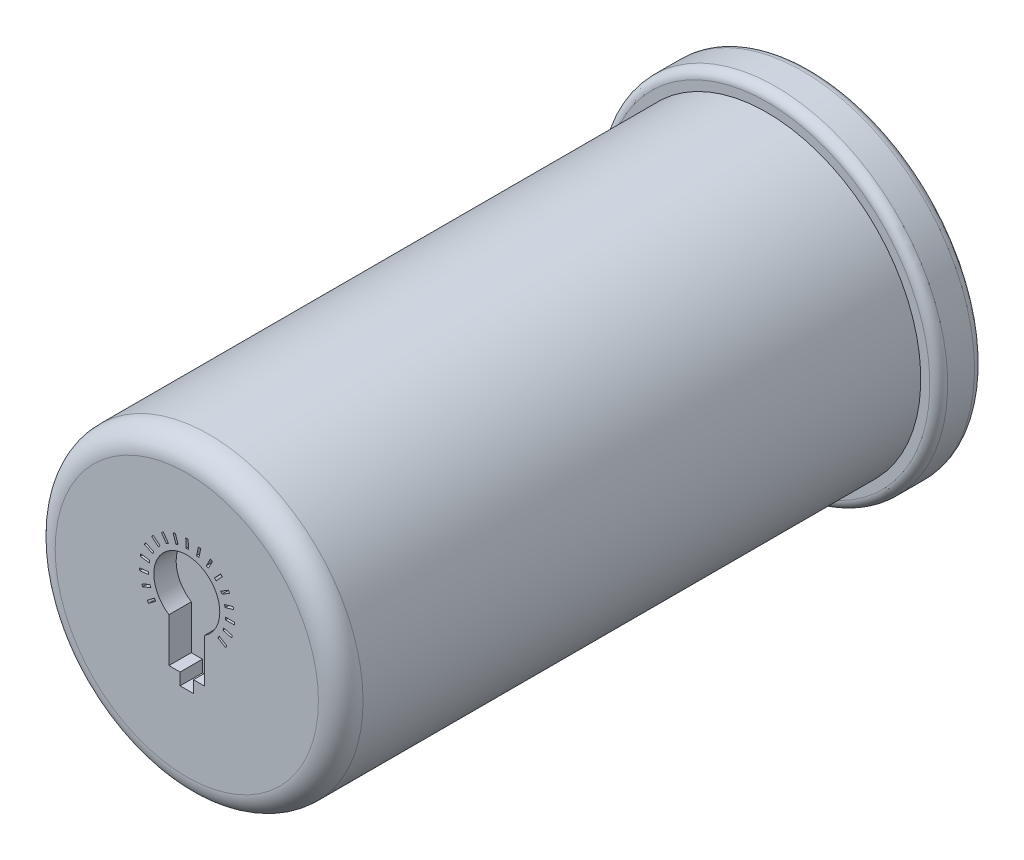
ISO-10303-21;
HEADER;
FILE_DESCRIPTION(('STEP AP214'),'2;1');
FILE_NAME('part.step','',(''),(''),'','','');
FILE_SCHEMA(('AUTOMOTIVE_DESIGN { 1 0 10303 214 1 1 1 1 }'));
ENDSEC;
DATA;
#1=APPLICATION_CONTEXT('core data for automotive mechanical design processes');
#2=APPLICATION_PROTOCOL_DEFINITION('international standard','automotive_design',2000,#1);
#3=PRODUCT_CONTEXT('',#1,'mechanical');
#4=PRODUCT('Part','Part','',(#3));
#5=PRODUCT_RELATED_PRODUCT_CATEGORY('part','',(#4));
#6=PRODUCT_DEFINITION_FORMATION('','',#4);
#7=PRODUCT_DEFINITION_CONTEXT('part definition',#1,'design');
#8=PRODUCT_DEFINITION('design','',#6,#7);
#9=PRODUCT_DEFINITION_SHAPE('','',#8);
#10=(LENGTH_UNIT() NAMED_UNIT(*) SI_UNIT(.MILLI.,.METRE.));
#11=(NAMED_UNIT(*) PLANE_ANGLE_UNIT() SI_UNIT($,.RADIAN.));
#12=(NAMED_UNIT(*) SI_UNIT($,.STERADIAN.) SOLID_ANGLE_UNIT());
#13=UNCERTAINTY_MEASURE_WITH_UNIT(LENGTH_MEASURE(1.E-05),#10,'distance_accuracy_value','');
#14=(GEOMETRIC_REPRESENTATION_CONTEXT(3) GLOBAL_UNCERTAINTY_ASSIGNED_CONTEXT((#13)) GLOBAL_UNIT_ASSIGNED_CONTEXT((#10,
#11,#12)) REPRESENTATION_CONTEXT('',''));
#15=CARTESIAN_POINT('',(0.,0.,0.));
#16=DIRECTION('',(0.,0.,1.));
#17=DIRECTION('',(1.,0.,0.));
#18=AXIS2_PLACEMENT_3D('',#15,#16,#17);
#19=CARTESIAN_POINT('',(0.,0.,13.));
#20=DIRECTION('',(0.,0.,-1.));
#21=DIRECTION('',(-1.,0.,0.));
#22=AXIS2_PLACEMENT_3D('',#19,#20,#21);
#23=CYLINDRICAL_SURFACE('',#22,3.45);
#24=CARTESIAN_POINT('',(0.,0.,12.5));
#25=DIRECTION('',(0.,0.,1.));
#26=DIRECTION('',(1.,0.,0.));
#27=AXIS2_PLACEMENT_3D('',#24,#25,#26);
#28=CIRCLE('',#27,3.45);
#29=CARTESIAN_POINT('',(-3.45,0.,12.5));
#30=VERTEX_POINT('',#29);
#31=EDGE_CURVE('E1119',#30,#30,#28,.F.);
#32=CARTESIAN_POINT('',(0.,0.,0.));
#33=DIRECTION('',(0.,0.,-1.));
#34=DIRECTION('',(-1.,0.,0.));
#35=AXIS2_PLACEMENT_3D('',#32,#33,#34);
#36=CIRCLE('',#35,3.45);
#37=CARTESIAN_POINT('',(-3.45,0.,0.));
#38=VERTEX_POINT('',#37);
#39=EDGE_CURVE('E1167',#38,#38,#36,.T.);
#40=CARTESIAN_POINT('',(-3.45,0.,12.5));
#41=CARTESIAN_POINT('',(-3.45,0.,12.3697916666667));
#42=CARTESIAN_POINT('',(-3.45,0.,12.2395833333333));
#43=CARTESIAN_POINT('',(-3.45,0.,11.9791666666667));
#44=CARTESIAN_POINT('',(-3.45,0.,11.8489583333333));
#45=CARTESIAN_POINT('',(-3.45,0.,11.5885416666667));
#46=CARTESIAN_POINT('',(-3.45,0.,11.4583333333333));
#47=CARTESIAN_POINT('',(-3.45,0.,11.1979166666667));
#48=CARTESIAN_POINT('',(-3.45,0.,11.0677083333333));
#49=CARTESIAN_POINT('',(-3.45,0.,10.8072916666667));
#50=CARTESIAN_POINT('',(-3.45,0.,10.6770833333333));
#51=CARTESIAN_POINT('',(-3.45,0.,10.4166666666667));
#52=CARTESIAN_POINT('',(-3.45,0.,10.2864583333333));
#53=CARTESIAN_POINT('',(-3.45,0.,10.0260416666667));
#54=CARTESIAN_POINT('',(-3.45,0.,9.89583333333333));
#55=CARTESIAN_POINT('',(-3.45,0.,9.63541666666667));
#56=CARTESIAN_POINT('',(-3.45,0.,9.50520833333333));
#57=CARTESIAN_POINT('',(-3.45,0.,9.24479166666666));
#58=CARTESIAN_POINT('',(-3.45,0.,9.11458333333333));
#59=CARTESIAN_POINT('',(-3.45,0.,8.85416666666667));
#60=CARTESIAN_POINT('',(-3.45,0.,8.72395833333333));
#61=CARTESIAN_POINT('',(-3.45,0.,8.46354166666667));
#62=CARTESIAN_POINT('',(-3.45,0.,8.33333333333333));
#63=CARTESIAN_POINT('',(-3.45,0.,8.07291666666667));
#64=CARTESIAN_POINT('',(-3.45,0.,7.94270833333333));
#65=CARTESIAN_POINT('',(-3.45,0.,7.68229166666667));
#66=CARTESIAN_POINT('',(-3.45,0.,7.55208333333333));
#67=CARTESIAN_POINT('',(-3.45,0.,7.29166666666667));
#68=CARTESIAN_POINT('',(-3.45,0.,7.16145833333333));
#69=CARTESIAN_POINT('',(-3.45,0.,6.90104166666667));
#70=CARTESIAN_POINT('',(-3.45,0.,6.77083333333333));
#71=CARTESIAN_POINT('',(-3.45,0.,6.51041666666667));
#72=CARTESIAN_POINT('',(-3.45,0.,6.38020833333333));
#73=CARTESIAN_POINT('',(-3.45,0.,6.11979166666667));
#74=CARTESIAN_POINT('',(-3.45,0.,5.98958333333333));
#75=CARTESIAN_POINT('',(-3.45,0.,5.72916666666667));
#76=CARTESIAN_POINT('',(-3.45,0.,5.59895833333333));
#77=CARTESIAN_POINT('',(-3.45,0.,5.33854166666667));
#78=CARTESIAN_POINT('',(-3.45,0.,5.20833333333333));
#79=CARTESIAN_POINT('',(-3.45,0.,4.94791666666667));
#80=CARTESIAN_POINT('',(-3.45,0.,4.81770833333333));
#81=CARTESIAN_POINT('',(-3.45,0.,4.55729166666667));
#82=CARTESIAN_POINT('',(-3.45,0.,4.42708333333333));
#83=CARTESIAN_POINT('',(-3.45,0.,4.16666666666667));
#84=CARTESIAN_POINT('',(-3.45,0.,4.03645833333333));
#85=CARTESIAN_POINT('',(-3.45,0.,3.77604166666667));
#86=CARTESIAN_POINT('',(-3.45,0.,3.64583333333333));
#87=CARTESIAN_POINT('',(-3.45,0.,3.38541666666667));
#88=CARTESIAN_POINT('',(-3.45,0.,3.25520833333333));
#89=CARTESIAN_POINT('',(-3.45,0.,2.99479166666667));
#90=CARTESIAN_POINT('',(-3.45,0.,2.86458333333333));
#91=CARTESIAN_POINT('',(-3.45,0.,2.60416666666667));
#92=CARTESIAN_POINT('',(-3.45,0.,2.47395833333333));
#93=CARTESIAN_POINT('',(-3.45,0.,2.21354166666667));
#94=CARTESIAN_POINT('',(-3.45,0.,2.08333333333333));
#95=CARTESIAN_POINT('',(-3.45,0.,1.82291666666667));
#96=CARTESIAN_POINT('',(-3.45,0.,1.69270833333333));
#97=CARTESIAN_POINT('',(-3.45,0.,1.43229166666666));
#98=CARTESIAN_POINT('',(-3.45,0.,1.30208333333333));
#99=CARTESIAN_POINT('',(-3.45,0.,1.04166666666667));
#100=CARTESIAN_POINT('',(-3.45,0.,0.911458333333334));
#101=CARTESIAN_POINT('',(-3.45,0.,0.651041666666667));
#102=CARTESIAN_POINT('',(-3.45,0.,0.520833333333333));
#103=CARTESIAN_POINT('',(-3.45,0.,0.260416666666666));
#104=CARTESIAN_POINT('',(-3.45,0.,0.130208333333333));
#105=CARTESIAN_POINT('',(-3.45,0.,0.));
#106=B_SPLINE_CURVE_WITH_KNOTS('',3,(#40,#41,#42,#43,#44,#45,#46,#47,#48,#49,#50,#51,#52,#53,
#54,#55,#56,#57,#58,#59,#60,#61,#62,#63,#64,#65,#66,#67,#68,#69,#70,#71,#72,#73,#74,#75,#76,#77,
#78,#79,#80,#81,#82,#83,#84,#85,#86,#87,#88,#89,#90,#91,#92,#93,#94,#95,#96,#97,#98,#99,#100,
#101,#102,#103,#104,#105),.UNSPECIFIED.,.F.,.F.,(4,2,2,2,2,2,2,2,2,2,2,2,2,2,2,2,2,2,2,2,2,2,2,
2,2,2,2,2,2,2,2,2,4),(0.,0.390625,0.781250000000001,1.171875,1.5625,1.953125,2.34375,2.734375,
3.125,3.515625,3.90625,4.296875,4.6875,5.078125,5.46875,5.859375,6.25,6.640625,7.03125,7.421875,
7.8125,8.203125,8.59375,8.984375,9.375,9.765625,10.15625,10.546875,10.9375,11.328125,11.71875,
12.109375,12.5),.UNSPECIFIED.);
#107=EDGE_CURVE('BSEAM30',#30,#38,#106,.T.);
#108=ORIENTED_EDGE('',*,*,#31,.T.);
#109=ORIENTED_EDGE('',*,*,#39,.F.);
#110=ORIENTED_EDGE('',*,*,#107,.T.);
#111=ORIENTED_EDGE('',*,*,#107,.F.);
#112=EDGE_LOOP('',(#108,#110,#109,#111));
#113=FACE_BOUND('',#112,.T.);
#114=ADVANCED_FACE('F30',(#113),#23,.T.);
#115=CARTESIAN_POINT('',(0.,0.,13.));
#116=DIRECTION('',(0.,0.,1.));
#117=DIRECTION('',(1.,0.,0.));
#118=AXIS2_PLACEMENT_3D('',#115,#116,#117);
#119=PLANE('',#118);
#120=DIRECTION('',(-0.615661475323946,0.78801075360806,0.));
#121=VECTOR('',#120,1.);
#122=CARTESIAN_POINT('',(-0.694893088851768,0.116812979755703,13.));
#123=LINE('',#122,#121);
#124=CARTESIAN_POINT('',(-0.694893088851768,0.116812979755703,13.));
#125=VERTEX_POINT('',#124);
#126=CARTESIAN_POINT('',(-0.727958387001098,0.159134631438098,13.));
#127=VERTEX_POINT('',#126);
#128=EDGE_CURVE('E44',#125,#127,#123,.T.);
#129=ORIENTED_EDGE('',*,*,#128,.F.);
#130=DIRECTION('',(0.78801075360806,0.615661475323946,0.));
#131=VECTOR('',#130,1.);
#132=CARTESIAN_POINT('',(-0.694893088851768,0.116812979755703,13.));
#133=LINE('',#132,#131);
#134=CARTESIAN_POINT('',(-0.85249523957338,-0.00631931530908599,13.));
#135=VERTEX_POINT('',#134);
#136=EDGE_CURVE('E524',#135,#125,#133,.T.);
#137=ORIENTED_EDGE('',*,*,#136,.F.);
#138=DIRECTION('',(0.615661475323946,-0.78801075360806,0.));
#139=VECTOR('',#138,1.);
#140=CARTESIAN_POINT('',(-0.85249523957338,-0.00631931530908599,13.));
#141=LINE('',#140,#139);
#142=CARTESIAN_POINT('',(-0.88556053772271,0.0360023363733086,13.));
#143=VERTEX_POINT('',#142);
#144=EDGE_CURVE('E506',#143,#135,#141,.T.);
#145=ORIENTED_EDGE('',*,*,#144,.F.);
#146=DIRECTION('',(-0.78801075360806,-0.615661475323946,0.));
#147=VECTOR('',#146,1.);
#148=CARTESIAN_POINT('',(-0.727958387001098,0.159134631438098,13.));
#149=LINE('',#148,#147);
#150=EDGE_CURVE('E517',#127,#143,#149,.T.);
#151=ORIENTED_EDGE('',*,*,#150,.F.);
#152=EDGE_LOOP('',(#129,#137,#145,#151));
#153=FACE_BOUND('',#152,.T.);
#154=DIRECTION('',(-0.381675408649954,0.924296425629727,0.));
#155=VECTOR('',#154,1.);
#156=CARTESIAN_POINT('',(-0.804226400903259,0.32308717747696,13.));
#157=LINE('',#156,#155);
#158=CARTESIAN_POINT('',(-0.804226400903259,0.32308717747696,13.));
#159=VERTEX_POINT('',#158);
#160=CARTESIAN_POINT('',(-0.824725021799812,0.372728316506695,13.));
#161=VERTEX_POINT('',#160);
#162=EDGE_CURVE('E52',#159,#161,#157,.T.);
#163=ORIENTED_EDGE('',*,*,#162,.F.);
#164=DIRECTION('',(0.924296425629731,0.381675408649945,0.));
#165=VECTOR('',#164,1.);
#166=CARTESIAN_POINT('',(-0.804226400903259,0.32308717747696,13.));
#167=LINE('',#166,#165);
#168=CARTESIAN_POINT('',(-0.989085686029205,0.246752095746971,13.));
#169=VERTEX_POINT('',#168);
#170=EDGE_CURVE('E549',#169,#159,#167,.T.);
#171=ORIENTED_EDGE('',*,*,#170,.F.);
#172=DIRECTION('',(0.381675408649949,-0.92429642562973,0.));
#173=VECTOR('',#172,1.);
#174=CARTESIAN_POINT('',(-0.989085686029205,0.246752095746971,13.));
#175=LINE('',#174,#173);
#176=CARTESIAN_POINT('',(-1.00958430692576,0.296393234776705,13.));
#177=VERTEX_POINT('',#176);
#178=EDGE_CURVE('E546',#177,#169,#175,.T.);
#179=ORIENTED_EDGE('',*,*,#178,.F.);
#180=DIRECTION('',(-0.924296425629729,-0.381675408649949,0.));
#181=VECTOR('',#180,1.);
#182=CARTESIAN_POINT('',(-0.824725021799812,0.372728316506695,13.));
#183=LINE('',#182,#181);
#184=EDGE_CURVE('E543',#161,#177,#183,.T.);
#185=ORIENTED_EDGE('',*,*,#184,.F.);
#186=EDGE_LOOP('',(#163,#171,#179,#185));
#187=FACE_BOUND('',#186,.T.);
#188=DIRECTION('',(-0.119703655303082,0.992809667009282,0.));
#189=VECTOR('',#188,1.);
#190=CARTESIAN_POINT('',(-0.854210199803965,0.551131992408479,13.));
#191=LINE('',#190,#189);
#192=CARTESIAN_POINT('',(-0.854210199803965,0.551131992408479,13.));
#193=VERTEX_POINT('',#192);
#194=CARTESIAN_POINT('',(-0.860639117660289,0.604452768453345,13.));
#195=VERTEX_POINT('',#194);
#196=EDGE_CURVE('E567',#193,#195,#191,.T.);
#197=ORIENTED_EDGE('',*,*,#196,.F.);
#198=DIRECTION('',(0.992809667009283,0.119703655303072,0.));
#199=VECTOR('',#198,1.);
#200=CARTESIAN_POINT('',(-0.854210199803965,0.551131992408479,13.));
#201=LINE('',#200,#199);
#202=CARTESIAN_POINT('',(-1.05277213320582,0.527191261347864,13.));
#203=VERTEX_POINT('',#202);
#204=EDGE_CURVE('E580',#203,#193,#201,.T.);
#205=ORIENTED_EDGE('',*,*,#204,.F.);
#206=DIRECTION('',(0.119703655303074,-0.992809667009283,0.));
#207=VECTOR('',#206,1.);
#208=CARTESIAN_POINT('',(-1.05277213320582,0.527191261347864,13.));
#209=LINE('',#208,#207);
#210=CARTESIAN_POINT('',(-1.05920105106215,0.580512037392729,13.));
#211=VERTEX_POINT('',#210);
#212=EDGE_CURVE('E577',#211,#203,#209,.T.);
#213=ORIENTED_EDGE('',*,*,#212,.F.);
#214=DIRECTION('',(-0.992809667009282,-0.119703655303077,0.));
#215=VECTOR('',#214,1.);
#216=CARTESIAN_POINT('',(-0.860639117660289,0.604452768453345,13.));
#217=LINE('',#216,#215);
#218=EDGE_CURVE('E574',#195,#211,#217,.T.);
#219=ORIENTED_EDGE('',*,*,#218,.F.);
#220=EDGE_LOOP('',(#197,#205,#213,#219));
#221=FACE_BOUND('',#220,.T.);
#222=DIRECTION('',(0.151045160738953,0.988526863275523,0.));
#223=VECTOR('',#222,1.);
#224=CARTESIAN_POINT('',(-0.841179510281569,0.784226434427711,13.));
#225=LINE('',#224,#223);
#226=CARTESIAN_POINT('',(-0.841179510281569,0.784226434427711,13.));
#227=VERTEX_POINT('',#226);
#228=CARTESIAN_POINT('',(-0.833067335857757,0.837317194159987,13.));
#229=VERTEX_POINT('',#228);
#230=EDGE_CURVE('E598',#227,#229,#225,.T.);
#231=ORIENTED_EDGE('',*,*,#230,.F.);
#232=DIRECTION('',(0.988526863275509,-0.151045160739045,0.));
#233=VECTOR('',#232,1.);
#234=CARTESIAN_POINT('',(-0.841179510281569,0.784226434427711,13.));
#235=LINE('',#234,#233);
#236=CARTESIAN_POINT('',(-1.03888488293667,0.814435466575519,13.));
#237=VERTEX_POINT('',#236);
#238=EDGE_CURVE('E612',#237,#227,#235,.T.);
#239=ORIENTED_EDGE('',*,*,#238,.F.);
#240=DIRECTION('',(-0.151045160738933,-0.988526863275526,0.));
#241=VECTOR('',#240,1.);
#242=CARTESIAN_POINT('',(-1.03888488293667,0.814435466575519,13.));
#243=LINE('',#242,#241);
#244=CARTESIAN_POINT('',(-1.03077270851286,0.867526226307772,13.));
#245=VERTEX_POINT('',#244);
#246=EDGE_CURVE('E609',#245,#237,#243,.T.);
#247=ORIENTED_EDGE('',*,*,#246,.F.);
#248=DIRECTION('',(-0.988526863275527,0.151045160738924,0.));
#249=VECTOR('',#248,1.);
#250=CARTESIAN_POINT('',(-0.833067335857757,0.837317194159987,13.));
#251=LINE('',#250,#249);
#252=EDGE_CURVE('E606',#229,#245,#251,.T.);
#253=ORIENTED_EDGE('',*,*,#252,.F.);
#254=EDGE_LOOP('',(#231,#239,#247,#253));
#255=FACE_BOUND('',#254,.T.);
#256=DIRECTION('',(0.410718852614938,0.91176204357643,0.));
#257=VECTOR('',#256,1.);
#258=CARTESIAN_POINT('',(-0.766089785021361,1.00527925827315,13.));
#259=LINE('',#258,#257);
#260=CARTESIAN_POINT('',(-0.766089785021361,1.00527925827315,13.));
#261=VERTEX_POINT('',#260);
#262=CARTESIAN_POINT('',(-0.74403132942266,1.05424721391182,13.));
#263=VERTEX_POINT('',#262);
#264=EDGE_CURVE('E630',#261,#263,#259,.T.);
#265=ORIENTED_EDGE('',*,*,#264,.F.);
#266=DIRECTION('',(0.911762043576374,-0.410718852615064,0.));
#267=VECTOR('',#266,1.);
#268=CARTESIAN_POINT('',(-0.766089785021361,1.00527925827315,13.));
#269=LINE('',#268,#267);
#270=CARTESIAN_POINT('',(-0.948442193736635,1.08742302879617,13.));
#271=VERTEX_POINT('',#270);
#272=EDGE_CURVE('E644',#271,#261,#269,.T.);
#273=ORIENTED_EDGE('',*,*,#272,.F.);
#274=DIRECTION('',(-0.410718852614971,-0.911762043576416,0.));
#275=VECTOR('',#274,1.);
#276=CARTESIAN_POINT('',(-0.948442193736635,1.08742302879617,13.));
#277=LINE('',#276,#275);
#278=CARTESIAN_POINT('',(-0.926383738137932,1.13639098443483,13.));
#279=VERTEX_POINT('',#278);
#280=EDGE_CURVE('E641',#279,#271,#277,.T.);
#281=ORIENTED_EDGE('',*,*,#280,.F.);
#282=DIRECTION('',(-0.911762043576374,0.410718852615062,0.));
#283=VECTOR('',#282,1.);
#284=CARTESIAN_POINT('',(-0.74403132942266,1.05424721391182,13.));
#285=LINE('',#284,#283);
#286=EDGE_CURVE('E638',#263,#279,#285,.T.);
#287=ORIENTED_EDGE('',*,*,#286,.F.);
#288=EDGE_LOOP('',(#265,#273,#281,#287));
#289=FACE_BOUND('',#288,.T.);
#290=DIRECTION('',(0.640277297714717,0.768143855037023,0.));
#291=VECTOR('',#290,1.);
#292=CARTESIAN_POINT('',(-0.634446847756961,1.19808214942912,13.));
#293=LINE('',#292,#291);
#294=CARTESIAN_POINT('',(-0.634446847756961,1.19808214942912,13.));
#295=VERTEX_POINT('',#294);
#296=CARTESIAN_POINT('',(-0.600059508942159,1.23933681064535,13.));
#297=VERTEX_POINT('',#296);
#298=EDGE_CURVE('E662',#295,#297,#293,.T.);
#299=ORIENTED_EDGE('',*,*,#298,.F.);
#300=DIRECTION('',(0.768143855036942,-0.640277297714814,0.));
#301=VECTOR('',#300,1.);
#302=CARTESIAN_POINT('',(-0.634446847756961,1.19808214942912,13.));
#303=LINE('',#302,#301);
#304=CARTESIAN_POINT('',(-0.788075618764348,1.32613760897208,13.));
#305=VERTEX_POINT('',#304);
#306=EDGE_CURVE('E676',#305,#295,#303,.T.);
#307=ORIENTED_EDGE('',*,*,#306,.F.);
#308=DIRECTION('',(-0.640277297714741,-0.768143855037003,0.));
#309=VECTOR('',#308,1.);
#310=CARTESIAN_POINT('',(-0.788075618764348,1.32613760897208,13.));
#311=LINE('',#310,#309);
#312=CARTESIAN_POINT('',(-0.753688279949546,1.36739227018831,13.));
#313=VERTEX_POINT('',#312);
#314=EDGE_CURVE('E673',#313,#305,#311,.T.);
#315=ORIENTED_EDGE('',*,*,#314,.F.);
#316=DIRECTION('',(-0.768143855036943,0.640277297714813,0.));
#317=VECTOR('',#316,1.);
#318=CARTESIAN_POINT('',(-0.600059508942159,1.23933681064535,13.));
#319=LINE('',#318,#317);
#320=EDGE_CURVE('E670',#297,#313,#319,.T.);
#321=ORIENTED_EDGE('',*,*,#320,.F.);
#322=EDGE_LOOP('',(#299,#307,#315,#321));
#323=FACE_BOUND('',#322,.T.);
#324=DIRECTION('',(0.822888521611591,0.568202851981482,0.));
#325=VECTOR('',#324,1.);
#326=CARTESIAN_POINT('',(-0.455903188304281,1.34849817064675,13.));
#327=LINE('',#326,#325);
#328=CARTESIAN_POINT('',(-0.455903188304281,1.34849817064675,13.));
#329=VERTEX_POINT('',#328);
#330=CARTESIAN_POINT('',(-0.411708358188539,1.37901461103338,13.));
#331=VERTEX_POINT('',#330);
#332=EDGE_CURVE('E694',#329,#331,#327,.T.);
#333=ORIENTED_EDGE('',*,*,#332,.F.);
#334=DIRECTION('',(0.568202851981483,-0.82288852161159,0.));
#335=VECTOR('',#334,1.);
#336=CARTESIAN_POINT('',(-0.455903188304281,1.34849817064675,13.));
#337=LINE('',#336,#335);
#338=CARTESIAN_POINT('',(-0.569543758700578,1.51307587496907,13.));
#339=VERTEX_POINT('',#338);
#340=EDGE_CURVE('E708',#339,#329,#337,.T.);
#341=ORIENTED_EDGE('',*,*,#340,.F.);
#342=DIRECTION('',(-0.822888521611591,-0.568202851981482,0.));
#343=VECTOR('',#342,1.);
#344=CARTESIAN_POINT('',(-0.569543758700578,1.51307587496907,13.));
#345=LINE('',#344,#343);
#346=CARTESIAN_POINT('',(-0.525348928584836,1.5435923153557,13.));
#347=VERTEX_POINT('',#346);
#348=EDGE_CURVE('E705',#347,#339,#345,.T.);
#349=ORIENTED_EDGE('',*,*,#348,.F.);
#350=DIRECTION('',(-0.568202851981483,0.82288852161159,0.));
#351=VECTOR('',#350,1.);
#352=CARTESIAN_POINT('',(-0.411708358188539,1.37901461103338,13.));
#353=LINE('',#352,#351);
#354=EDGE_CURVE('E702',#331,#347,#353,.T.);
#355=ORIENTED_EDGE('',*,*,#354,.F.);
#356=EDGE_LOOP('',(#333,#341,#349,#355));
#357=FACE_BOUND('',#356,.T.);
#358=DIRECTION('',(0.945162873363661,0.326599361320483,0.));
#359=VECTOR('',#358,1.);
#360=CARTESIAN_POINT('',(-0.24355021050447,1.44549832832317,13.));
#361=LINE('',#360,#359);
#362=CARTESIAN_POINT('',(-0.24355021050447,1.44549832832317,13.));
#363=VERTEX_POINT('',#362);
#364=CARTESIAN_POINT('',(-0.192788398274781,1.46303898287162,13.));
#365=VERTEX_POINT('',#364);
#366=EDGE_CURVE('E726',#363,#365,#361,.T.);
#367=ORIENTED_EDGE('',*,*,#366,.F.);
#368=DIRECTION('',(0.326599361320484,-0.945162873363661,0.));
#369=VECTOR('',#368,1.);
#370=CARTESIAN_POINT('',(-0.24355021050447,1.44549832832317,13.));
#371=LINE('',#370,#369);
#372=CARTESIAN_POINT('',(-0.308870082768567,1.63453090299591,13.));
#373=VERTEX_POINT('',#372);
#374=EDGE_CURVE('E740',#373,#363,#371,.T.);
#375=ORIENTED_EDGE('',*,*,#374,.F.);
#376=DIRECTION('',(-0.945162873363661,-0.326599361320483,0.));
#377=VECTOR('',#376,1.);
#378=CARTESIAN_POINT('',(-0.308870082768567,1.63453090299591,13.));
#379=LINE('',#378,#377);
#380=CARTESIAN_POINT('',(-0.258108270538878,1.65207155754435,13.));
#381=VERTEX_POINT('',#380);
#382=EDGE_CURVE('E737',#381,#373,#379,.T.);
#383=ORIENTED_EDGE('',*,*,#382,.F.);
#384=DIRECTION('',(-0.326599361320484,0.945162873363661,0.));
#385=VECTOR('',#384,1.);
#386=CARTESIAN_POINT('',(-0.192788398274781,1.46303898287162,13.));
#387=LINE('',#386,#385);
#388=EDGE_CURVE('E734',#365,#381,#387,.T.);
#389=ORIENTED_EDGE('',*,*,#388,.F.);
#390=EDGE_LOOP('',(#367,#375,#383,#389));
#391=FACE_BOUND('',#390,.T.);
#392=DIRECTION('',(0.998134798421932,0.0610485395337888,0.));
#393=VECTOR('',#392,1.);
#394=CARTESIAN_POINT('',(-0.012958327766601,1.48197025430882,13.));
#395=LINE('',#394,#393);
#396=CARTESIAN_POINT('',(-0.012958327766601,1.48197025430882,13.));
#397=VERTEX_POINT('',#396);
#398=CARTESIAN_POINT('',(0.0406484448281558,1.48524898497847,13.));
#399=VERTEX_POINT('',#398);
#400=EDGE_CURVE('E758',#397,#399,#395,.T.);
#401=ORIENTED_EDGE('',*,*,#400,.F.);
#402=DIRECTION('',(0.0610485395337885,-0.998134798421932,0.));
#403=VECTOR('',#402,1.);
#404=CARTESIAN_POINT('',(-0.012958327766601,1.48197025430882,13.));
#405=LINE('',#404,#403);
#406=CARTESIAN_POINT('',(-0.0251680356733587,1.68159721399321,13.));
#407=VERTEX_POINT('',#406);
#408=EDGE_CURVE('E772',#407,#397,#405,.T.);
#409=ORIENTED_EDGE('',*,*,#408,.F.);
#410=DIRECTION('',(-0.998134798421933,-0.0610485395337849,0.));
#411=VECTOR('',#410,1.);
#412=CARTESIAN_POINT('',(-0.0251680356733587,1.68159721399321,13.));
#413=LINE('',#412,#411);
#414=CARTESIAN_POINT('',(0.028438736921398,1.68487594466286,13.));
#415=VERTEX_POINT('',#414);
#416=EDGE_CURVE('E769',#415,#407,#413,.T.);
#417=ORIENTED_EDGE('',*,*,#416,.F.);
#418=DIRECTION('',(-0.0610485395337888,0.998134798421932,0.));
#419=VECTOR('',#418,1.);
#420=CARTESIAN_POINT('',(0.0406484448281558,1.48524898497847,13.));
#421=LINE('',#420,#419);
#422=EDGE_CURVE('E766',#399,#415,#421,.T.);
#423=ORIENTED_EDGE('',*,*,#422,.F.);
#424=EDGE_LOOP('',(#401,#409,#417,#423));
#425=FACE_BOUND('',#424,.T.);
#426=DIRECTION('',(0.977920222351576,-0.208978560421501,0.));
#427=VECTOR('',#426,1.);
#428=CARTESIAN_POINT('',(0.218964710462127,1.45523970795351,13.));
#429=LINE('',#428,#427);
#430=CARTESIAN_POINT('',(0.218964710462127,1.45523970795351,13.));
#431=VERTEX_POINT('',#430);
#432=CARTESIAN_POINT('',(0.271485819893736,1.44401610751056,13.));
#433=VERTEX_POINT('',#432);
#434=EDGE_CURVE('E790',#431,#433,#429,.T.);
#435=ORIENTED_EDGE('',*,*,#434,.F.);
#436=DIRECTION('',(-0.208978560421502,-0.977920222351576,0.));
#437=VECTOR('',#436,1.);
#438=CARTESIAN_POINT('',(0.218964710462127,1.45523970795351,13.));
#439=LINE('',#438,#437);
#440=CARTESIAN_POINT('',(0.260760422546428,1.65082375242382,13.));
#441=VERTEX_POINT('',#440);
#442=EDGE_CURVE('E804',#441,#431,#439,.T.);
#443=ORIENTED_EDGE('',*,*,#442,.F.);
#444=DIRECTION('',(-0.977920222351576,0.208978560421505,0.));
#445=VECTOR('',#444,1.);
#446=CARTESIAN_POINT('',(0.260760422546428,1.65082375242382,13.));
#447=LINE('',#446,#445);
#448=CARTESIAN_POINT('',(0.313281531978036,1.63960015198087,13.));
#449=VERTEX_POINT('',#448);
#450=EDGE_CURVE('E801',#449,#441,#447,.T.);
#451=ORIENTED_EDGE('',*,*,#450,.F.);
#452=DIRECTION('',(0.208978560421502,0.977920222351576,0.));
#453=VECTOR('',#452,1.);
#454=CARTESIAN_POINT('',(0.271485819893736,1.44401610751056,13.));
#455=LINE('',#454,#453);
#456=EDGE_CURVE('E798',#433,#449,#455,.T.);
#457=ORIENTED_EDGE('',*,*,#456,.F.);
#458=EDGE_LOOP('',(#435,#443,#451,#457));
#459=FACE_BOUND('',#458,.T.);
#460=DIRECTION('',(0.886001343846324,-0.463682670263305,0.));
#461=VECTOR('',#460,1.);
#462=CARTESIAN_POINT('',(0.435213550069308,1.36726666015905,13.));
#463=LINE('',#462,#461);
#464=CARTESIAN_POINT('',(0.435213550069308,1.36726666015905,13.));
#465=VERTEX_POINT('',#464);
#466=CARTESIAN_POINT('',(0.482797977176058,1.34236367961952,13.));
#467=VERTEX_POINT('',#466);
#468=EDGE_CURVE('E822',#465,#467,#463,.T.);
#469=ORIENTED_EDGE('',*,*,#468,.F.);
#470=DIRECTION('',(-0.463682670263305,-0.886001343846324,0.));
#471=VECTOR('',#470,1.);
#472=CARTESIAN_POINT('',(0.435213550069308,1.36726666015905,13.));
#473=LINE('',#472,#471);
#474=CARTESIAN_POINT('',(0.527950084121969,1.54446692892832,13.));
#475=VERTEX_POINT('',#474);
#476=EDGE_CURVE('E836',#475,#465,#473,.T.);
#477=ORIENTED_EDGE('',*,*,#476,.F.);
#478=DIRECTION('',(-0.886001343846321,0.463682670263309,0.));
#479=VECTOR('',#478,1.);
#480=CARTESIAN_POINT('',(0.527950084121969,1.54446692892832,13.));
#481=LINE('',#480,#479);
#482=CARTESIAN_POINT('',(0.575534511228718,1.51956394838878,13.));
#483=VERTEX_POINT('',#482);
#484=EDGE_CURVE('E833',#483,#475,#481,.T.);
#485=ORIENTED_EDGE('',*,*,#484,.F.);
#486=DIRECTION('',(0.463682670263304,0.886001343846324,0.));
#487=VECTOR('',#486,1.);
#488=CARTESIAN_POINT('',(0.482797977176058,1.34236367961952,13.));
#489=LINE('',#488,#487);
#490=EDGE_CURVE('E830',#467,#483,#489,.T.);
#491=ORIENTED_EDGE('',*,*,#490,.F.);
#492=EDGE_LOOP('',(#469,#477,#485,#491));
#493=FACE_BOUND('',#492,.T.);
#494=DIRECTION('',(0.729117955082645,-0.684388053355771,0.));
#495=VECTOR('',#494,1.);
#496=CARTESIAN_POINT('',(0.619932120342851,1.22450158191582,13.));
#497=LINE('',#496,#495);
#498=CARTESIAN_POINT('',(0.619932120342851,1.22450158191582,13.));
#499=VERTEX_POINT('',#498);
#500=CARTESIAN_POINT('',(0.659090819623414,1.18774518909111,13.));
#501=VERTEX_POINT('',#500);
#502=EDGE_CURVE('E854',#499,#501,#497,.T.);
#503=ORIENTED_EDGE('',*,*,#502,.F.);
#504=DIRECTION('',(-0.684388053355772,-0.729117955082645,0.));
#505=VECTOR('',#504,1.);
#506=CARTESIAN_POINT('',(0.619932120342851,1.22450158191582,13.));
#507=LINE('',#506,#505);
#508=CARTESIAN_POINT('',(0.756809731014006,1.37032517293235,13.));
#509=VERTEX_POINT('',#508);
#510=EDGE_CURVE('E868',#509,#499,#507,.T.);
#511=ORIENTED_EDGE('',*,*,#510,.F.);
#512=DIRECTION('',(-0.729117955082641,0.684388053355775,0.));
#513=VECTOR('',#512,1.);
#514=CARTESIAN_POINT('',(0.756809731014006,1.37032517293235,13.));
#515=LINE('',#514,#513);
#516=CARTESIAN_POINT('',(0.795968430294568,1.33356878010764,13.));
#517=VERTEX_POINT('',#516);
#518=EDGE_CURVE('E865',#517,#509,#515,.T.);
#519=ORIENTED_EDGE('',*,*,#518,.F.);
#520=DIRECTION('',(0.684388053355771,0.729117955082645,0.));
#521=VECTOR('',#520,1.);
#522=CARTESIAN_POINT('',(0.659090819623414,1.18774518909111,13.));
#523=LINE('',#522,#521);
#524=EDGE_CURVE('E862',#501,#517,#523,.T.);
#525=ORIENTED_EDGE('',*,*,#524,.F.);
#526=EDGE_LOOP('',(#503,#511,#519,#525));
#527=FACE_BOUND('',#526,.T.);
#528=DIRECTION('',(0.518773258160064,-0.854911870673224,0.));
#529=VECTOR('',#528,1.);
#530=CARTESIAN_POINT('',(0.759576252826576,1.0374124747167,13.));
#531=LINE('',#530,#529);
#532=CARTESIAN_POINT('',(0.759576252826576,1.0374124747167,13.));
#533=VERTEX_POINT('',#532);
#534=CARTESIAN_POINT('',(0.787437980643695,0.991497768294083,13.));
#535=VERTEX_POINT('',#534);
#536=EDGE_CURVE('E886',#533,#535,#531,.T.);
#537=ORIENTED_EDGE('',*,*,#536,.F.);
#538=DIRECTION('',(-0.854911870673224,-0.518773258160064,0.));
#539=VECTOR('',#538,1.);
#540=CARTESIAN_POINT('',(0.759576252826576,1.0374124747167,13.));
#541=LINE('',#540,#539);
#542=CARTESIAN_POINT('',(0.930558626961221,1.14116712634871,13.));
#543=VERTEX_POINT('',#542);
#544=EDGE_CURVE('E900',#543,#533,#541,.T.);
#545=ORIENTED_EDGE('',*,*,#544,.F.);
#546=DIRECTION('',(-0.518773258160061,0.854911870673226,0.));
#547=VECTOR('',#546,1.);
#548=CARTESIAN_POINT('',(0.930558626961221,1.14116712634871,13.));
#549=LINE('',#548,#547);
#550=CARTESIAN_POINT('',(0.95842035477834,1.0952524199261,13.));
#551=VERTEX_POINT('',#550);
#552=EDGE_CURVE('E897',#551,#543,#549,.T.);
#553=ORIENTED_EDGE('',*,*,#552,.F.);
#554=DIRECTION('',(0.854911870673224,0.518773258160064,0.));
#555=VECTOR('',#554,1.);
#556=CARTESIAN_POINT('',(0.787437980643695,0.991497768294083,13.));
#557=LINE('',#556,#555);
#558=EDGE_CURVE('E894',#535,#551,#557,.T.);
#559=ORIENTED_EDGE('',*,*,#558,.F.);
#560=EDGE_LOOP('',(#537,#545,#553,#559));
#561=FACE_BOUND('',#560,.T.);
#562=DIRECTION('',(0.270390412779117,-0.962750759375,0.));
#563=VECTOR('',#562,1.);
#564=CARTESIAN_POINT('',(0.843906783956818,0.819717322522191,13.));
#565=LINE('',#564,#563);
#566=CARTESIAN_POINT('',(0.843906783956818,0.819717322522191,13.));
#567=VERTEX_POINT('',#566);
#568=CARTESIAN_POINT('',(0.858428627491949,0.768010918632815,13.));
#569=VERTEX_POINT('',#568);
#570=EDGE_CURVE('E918',#567,#569,#565,.T.);
#571=ORIENTED_EDGE('',*,*,#570,.F.);
#572=DIRECTION('',(-0.962750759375,-0.270390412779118,0.));
#573=VECTOR('',#572,1.);
#574=CARTESIAN_POINT('',(0.843906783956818,0.819717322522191,13.));
#575=LINE('',#574,#573);
#576=CARTESIAN_POINT('',(1.03645693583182,0.873795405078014,13.));
#577=VERTEX_POINT('',#576);
#578=EDGE_CURVE('E932',#577,#567,#575,.T.);
#579=ORIENTED_EDGE('',*,*,#578,.F.);
#580=DIRECTION('',(-0.270390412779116,0.962750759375,0.));
#581=VECTOR('',#580,1.);
#582=CARTESIAN_POINT('',(1.03645693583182,0.873795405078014,13.));
#583=LINE('',#582,#581);
#584=CARTESIAN_POINT('',(1.05097877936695,0.822089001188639,13.));
#585=VERTEX_POINT('',#584);
#586=EDGE_CURVE('E929',#585,#577,#583,.T.);
#587=ORIENTED_EDGE('',*,*,#586,.F.);
#588=DIRECTION('',(0.962750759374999,0.270390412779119,0.));
#589=VECTOR('',#588,1.);
#590=CARTESIAN_POINT('',(0.858428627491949,0.768010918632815,13.));
#591=LINE('',#590,#589);
#592=EDGE_CURVE('E926',#569,#585,#591,.T.);
#593=ORIENTED_EDGE('',*,*,#592,.F.);
#594=EDGE_LOOP('',(#571,#579,#587,#593));
#595=FACE_BOUND('',#594,.T.);
#596=DIRECTION('',(0.00218165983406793,-0.999997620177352,0.));
#597=VECTOR('',#596,1.);
#598=CARTESIAN_POINT('',(0.866740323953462,0.587378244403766,13.));
#599=LINE('',#598,#597);
#600=CARTESIAN_POINT('',(0.866740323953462,0.587378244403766,13.));
#601=VERTEX_POINT('',#600);
#602=CARTESIAN_POINT('',(0.866857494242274,0.53367142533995,13.));
#603=VERTEX_POINT('',#602);
#604=EDGE_CURVE('E950',#601,#603,#599,.T.);
#605=ORIENTED_EDGE('',*,*,#604,.F.);
#606=DIRECTION('',(-0.999997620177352,-0.00218165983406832,0.));
#607=VECTOR('',#606,1.);
#608=CARTESIAN_POINT('',(0.866740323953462,0.587378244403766,13.));
#609=LINE('',#608,#607);
#610=CARTESIAN_POINT('',(1.06673984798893,0.58781457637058,13.));
#611=VERTEX_POINT('',#610);
#612=EDGE_CURVE('E964',#611,#601,#609,.T.);
#613=ORIENTED_EDGE('',*,*,#612,.F.);
#614=DIRECTION('',(-0.00218165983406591,0.999997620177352,0.));
#615=VECTOR('',#614,1.);
#616=CARTESIAN_POINT('',(1.06673984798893,0.58781457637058,13.));
#617=LINE('',#616,#615);
#618=CARTESIAN_POINT('',(1.06685701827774,0.534107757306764,13.));
#619=VERTEX_POINT('',#618);
#620=EDGE_CURVE('E961',#619,#611,#617,.T.);
#621=ORIENTED_EDGE('',*,*,#620,.F.);
#622=DIRECTION('',(0.999997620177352,0.00218165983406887,0.));
#623=VECTOR('',#622,1.);
#624=CARTESIAN_POINT('',(0.866857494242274,0.53367142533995,13.));
#625=LINE('',#624,#623);
#626=EDGE_CURVE('E958',#603,#619,#625,.T.);
#627=ORIENTED_EDGE('',*,*,#626,.F.);
#628=EDGE_LOOP('',(#605,#613,#621,#627));
#629=FACE_BOUND('',#628,.T.);
#630=DIRECTION('',(-0.515038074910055,-0.857167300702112,0.));
#631=VECTOR('',#630,1.);
#632=CARTESIAN_POINT('',(0.725851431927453,0.146736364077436,13.));
#633=LINE('',#632,#631);
#634=CARTESIAN_POINT('',(0.725851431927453,0.146736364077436,13.));
#635=VERTEX_POINT('',#634);
#636=CARTESIAN_POINT('',(0.698190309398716,0.100700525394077,13.));
#637=VERTEX_POINT('',#636);
#638=EDGE_CURVE('E982',#635,#637,#633,.T.);
#639=ORIENTED_EDGE('',*,*,#638,.F.);
#640=DIRECTION('',(-0.857167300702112,0.515038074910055,0.));
#641=VECTOR('',#640,1.);
#642=CARTESIAN_POINT('',(0.725851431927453,0.146736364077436,13.));
#643=LINE('',#642,#641);
#644=CARTESIAN_POINT('',(0.897284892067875,0.0437287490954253,13.));
#645=VERTEX_POINT('',#644);
#646=EDGE_CURVE('E996',#645,#635,#643,.T.);
#647=ORIENTED_EDGE('',*,*,#646,.F.);
#648=DIRECTION('',(0.515038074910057,0.85716730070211,0.));
#649=VECTOR('',#648,1.);
#650=CARTESIAN_POINT('',(0.897284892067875,0.0437287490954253,13.));
#651=LINE('',#650,#649);
#652=CARTESIAN_POINT('',(0.869623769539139,-0.002307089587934,13.));
#653=VERTEX_POINT('',#652);
#654=EDGE_CURVE('E993',#653,#645,#651,.T.);
#655=ORIENTED_EDGE('',*,*,#654,.F.);
#656=DIRECTION('',(0.857167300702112,-0.515038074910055,0.));
#657=VECTOR('',#656,1.);
#658=CARTESIAN_POINT('',(0.698190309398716,0.100700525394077,13.));
#659=LINE('',#658,#657);
#660=EDGE_CURVE('E990',#637,#653,#659,.T.);
#661=ORIENTED_EDGE('',*,*,#660,.F.);
#662=EDGE_LOOP('',(#639,#647,#655,#661));
#663=FACE_BOUND('',#662,.T.);
#664=DIRECTION('',(-0.266187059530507,-0.963921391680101,0.));
#665=VECTOR('',#664,1.);
#666=CARTESIAN_POINT('',(0.826402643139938,0.357431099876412,13.));
#667=LINE('',#666,#665);
#668=CARTESIAN_POINT('',(0.826402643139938,0.357431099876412,13.));
#669=VERTEX_POINT('',#668);
#670=CARTESIAN_POINT('',(0.812106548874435,0.305661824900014,13.));
#671=VERTEX_POINT('',#670);
#672=EDGE_CURVE('E1014',#669,#671,#667,.T.);
#673=ORIENTED_EDGE('',*,*,#672,.F.);
#674=DIRECTION('',(-0.963921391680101,0.266187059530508,0.));
#675=VECTOR('',#674,1.);
#676=CARTESIAN_POINT('',(0.826402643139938,0.357431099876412,13.));
#677=LINE('',#676,#675);
#678=CARTESIAN_POINT('',(1.01918692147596,0.30419368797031,13.));
#679=VERTEX_POINT('',#678);
#680=EDGE_CURVE('E1028',#679,#669,#677,.T.);
#681=ORIENTED_EDGE('',*,*,#680,.F.);
#682=DIRECTION('',(0.26618705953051,0.9639213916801,0.));
#683=VECTOR('',#682,1.);
#684=CARTESIAN_POINT('',(1.01918692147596,0.30419368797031,13.));
#685=LINE('',#684,#683);
#686=CARTESIAN_POINT('',(1.00489082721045,0.252424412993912,13.));
#687=VERTEX_POINT('',#686);
#688=EDGE_CURVE('E1025',#687,#679,#685,.T.);
#689=ORIENTED_EDGE('',*,*,#688,.F.);
#690=DIRECTION('',(0.963921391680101,-0.266187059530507,0.));
#691=VECTOR('',#690,1.);
#692=CARTESIAN_POINT('',(0.812106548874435,0.305661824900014,13.));
#693=LINE('',#692,#691);
#694=EDGE_CURVE('E1022',#671,#687,#693,.T.);
#695=ORIENTED_EDGE('',*,*,#694,.F.);
#696=EDGE_LOOP('',(#673,#681,#689,#695));
#697=FACE_BOUND('',#696,.T.);
#698=DIRECTION('',(1.,0.,0.));
#699=VECTOR('',#698,1.);
#700=CARTESIAN_POINT('',(0.15,-0.986865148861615,13.));
#701=LINE('',#700,#699);
#702=CARTESIAN_POINT('',(0.15,-0.986865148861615,13.));
#703=VERTEX_POINT('',#702);
#704=CARTESIAN_POINT('',(0.4,-0.986865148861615,13.));
#705=VERTEX_POINT('',#704);
#706=EDGE_CURVE('E1046',#703,#705,#701,.T.);
#707=ORIENTED_EDGE('',*,*,#706,.F.);
#708=DIRECTION('',(0.,1.,0.));
#709=VECTOR('',#708,1.);
#710=CARTESIAN_POINT('',(0.15,-0.986865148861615,13.));
#711=LINE('',#710,#709);
#712=CARTESIAN_POINT('',(0.15,-1.25539988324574,13.));
#713=VERTEX_POINT('',#712);
#714=EDGE_CURVE('E1072',#713,#703,#711,.T.);
#715=ORIENTED_EDGE('',*,*,#714,.F.);
#716=DIRECTION('',(1.,0.,0.));
#717=VECTOR('',#716,1.);
#718=CARTESIAN_POINT('',(-0.15,-1.25539988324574,13.));
#719=LINE('',#718,#717);
#720=CARTESIAN_POINT('',(-0.15,-1.25539988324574,13.));
#721=VERTEX_POINT('',#720);
#722=EDGE_CURVE('E1069',#721,#713,#719,.T.);
#723=ORIENTED_EDGE('',*,*,#722,.F.);
#724=DIRECTION('',(0.,-1.,0.));
#725=VECTOR('',#724,1.);
#726=CARTESIAN_POINT('',(-0.15,-0.986865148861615,13.));
#727=LINE('',#726,#725);
#728=CARTESIAN_POINT('',(-0.15,-0.986865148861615,13.));
#729=VERTEX_POINT('',#728);
#730=EDGE_CURVE('E1066',#729,#721,#727,.T.);
#731=ORIENTED_EDGE('',*,*,#730,.F.);
#732=DIRECTION('',(1.,0.,0.));
#733=VECTOR('',#732,1.);
#734=CARTESIAN_POINT('',(-0.4,-0.986865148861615,13.));
#735=LINE('',#734,#733);
#736=CARTESIAN_POINT('',(-0.4,-0.986865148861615,13.));
#737=VERTEX_POINT('',#736);
#738=EDGE_CURVE('E1063',#737,#729,#735,.T.);
#739=ORIENTED_EDGE('',*,*,#738,.F.);
#740=DIRECTION('',(0.,-1.,0.));
#741=VECTOR('',#740,1.);
#742=CARTESIAN_POINT('',(-0.4,0.,13.));
#743=LINE('',#742,#741);
#744=CARTESIAN_POINT('',(-0.400000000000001,0.,13.));
#745=VERTEX_POINT('',#744);
#746=EDGE_CURVE('E1060',#745,#737,#743,.T.);
#747=ORIENTED_EDGE('',*,*,#746,.F.);
#748=CARTESIAN_POINT('',(0.,0.621219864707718,13.));
#749=DIRECTION('',(0.,0.,1.));
#750=DIRECTION('',(1.,0.,0.));
#751=AXIS2_PLACEMENT_3D('',#748,#749,#750);
#752=CIRCLE('',#751,0.738860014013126);
#753=CARTESIAN_POINT('',(0.4,0.,13.));
#754=VERTEX_POINT('',#753);
#755=EDGE_CURVE('E1057',#754,#745,#752,.T.);
#756=ORIENTED_EDGE('',*,*,#755,.F.);
#757=DIRECTION('',(0.,1.,0.));
#758=VECTOR('',#757,1.);
#759=CARTESIAN_POINT('',(0.4,0.,13.));
#760=LINE('',#759,#758);
#761=EDGE_CURVE('E1054',#705,#754,#760,.T.);
#762=ORIENTED_EDGE('',*,*,#761,.F.);
#763=EDGE_LOOP('',(#707,#715,#723,#731,#739,#747,#756,#762));
#764=FACE_BOUND('',#763,.T.);
#765=CARTESIAN_POINT('',(0.,0.,13.));
#766=DIRECTION('',(0.,0.,1.));
#767=DIRECTION('',(1.,0.,0.));
#768=AXIS2_PLACEMENT_3D('',#765,#766,#767);
#769=CIRCLE('',#768,2.95);
#770=CARTESIAN_POINT('',(2.95,0.,13.));
#771=VERTEX_POINT('',#770);
#772=EDGE_CURVE('E1102',#771,#771,#769,.T.);
#773=ORIENTED_EDGE('',*,*,#772,.T.);
#774=EDGE_LOOP('',(#773));
#775=FACE_BOUND('',#774,.T.);
#776=ADVANCED_FACE('F521',(#153,#187,#221,#255,#289,#323,#357,#391,#425,#459,#493,#527,#561,
#595,#629,#663,#697,#764,#775),#119,.T.);
#777=CARTESIAN_POINT('',(0.,0.,12.5));
#778=DIRECTION('',(0.,0.,1.));
#779=DIRECTION('',(1.,0.,0.));
#780=AXIS2_PLACEMENT_3D('',#777,#778,#779);
#781=TOROIDAL_SURFACE('',#780,2.95,0.5);
#782=ORIENTED_EDGE('',*,*,#31,.F.);
#783=EDGE_LOOP('',(#782));
#784=FACE_BOUND('',#783,.T.);
#785=ORIENTED_EDGE('',*,*,#772,.F.);
#786=EDGE_LOOP('',(#785));
#787=FACE_BOUND('',#786,.T.);
#788=ADVANCED_FACE('F1162',(#784,#787),#781,.T.);
#789=CARTESIAN_POINT('',(0.15,-0.986865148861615,12.5));
#790=DIRECTION('',(0.,-1.,0.));
#791=DIRECTION('',(0.,0.,-1.));
#792=AXIS2_PLACEMENT_3D('',#789,#790,#791);
#793=PLANE('',#792);
#794=ORIENTED_EDGE('',*,*,#706,.T.);
#795=DIRECTION('',(0.,0.,1.));
#796=VECTOR('',#795,1.);
#797=CARTESIAN_POINT('',(0.4,-0.986865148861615,12.5));
#798=LINE('',#797,#796);
#799=CARTESIAN_POINT('',(0.4,-0.986865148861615,12.5));
#800=VERTEX_POINT('',#799);
#801=EDGE_CURVE('E1099',#800,#705,#798,.T.);
#802=ORIENTED_EDGE('',*,*,#801,.F.);
#803=DIRECTION('',(1.,0.,0.));
#804=VECTOR('',#803,1.);
#805=CARTESIAN_POINT('',(0.15,-0.986865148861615,12.5));
#806=LINE('',#805,#804);
#807=CARTESIAN_POINT('',(0.15,-0.986865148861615,12.5));
#808=VERTEX_POINT('',#807);
#809=EDGE_CURVE('E1075',#808,#800,#806,.T.);
#810=ORIENTED_EDGE('',*,*,#809,.F.);
#811=DIRECTION('',(0.,0.,1.));
#812=VECTOR('',#811,1.);
#813=CARTESIAN_POINT('',(0.15,-0.986865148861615,12.5));
#814=LINE('',#813,#812);
#815=EDGE_CURVE('E1100',#808,#703,#814,.T.);
#816=ORIENTED_EDGE('',*,*,#815,.T.);
#817=EDGE_LOOP('',(#794,#802,#810,#816));
#818=FACE_BOUND('',#817,.T.);
#819=ADVANCED_FACE('F1518',(#818),#793,.F.);
#820=CARTESIAN_POINT('',(0.15,-0.986865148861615,12.5));
#821=DIRECTION('',(1.,0.,0.));
#822=DIRECTION('',(0.,1.,0.));
#823=AXIS2_PLACEMENT_3D('',#820,#821,#822);
#824=PLANE('',#823);
#825=ORIENTED_EDGE('',*,*,#714,.T.);
#826=ORIENTED_EDGE('',*,*,#815,.F.);
#827=DIRECTION('',(0.,1.,0.));
#828=VECTOR('',#827,1.);
#829=CARTESIAN_POINT('',(0.15,-0.986865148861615,12.5));
#830=LINE('',#829,#828);
#831=CARTESIAN_POINT('',(0.15,-1.25539988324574,12.5));
#832=VERTEX_POINT('',#831);
#833=EDGE_CURVE('E1096',#832,#808,#830,.T.);
#834=ORIENTED_EDGE('',*,*,#833,.F.);
#835=DIRECTION('',(0.,0.,1.));
#836=VECTOR('',#835,1.);
#837=CARTESIAN_POINT('',(0.15,-1.25539988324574,12.5));
#838=LINE('',#837,#836);
#839=EDGE_CURVE('E1103',#832,#713,#838,.T.);
#840=ORIENTED_EDGE('',*,*,#839,.T.);
#841=EDGE_LOOP('',(#825,#826,#834,#840));
#842=FACE_BOUND('',#841,.T.);
#843=ADVANCED_FACE('F1514',(#842),#824,.F.);
#844=CARTESIAN_POINT('',(-0.15,-1.25539988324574,12.5));
#845=DIRECTION('',(0.,-1.,0.));
#846=DIRECTION('',(0.,0.,-1.));
#847=AXIS2_PLACEMENT_3D('',#844,#845,#846);
#848=PLANE('',#847);
#849=ORIENTED_EDGE('',*,*,#722,.T.);
#850=ORIENTED_EDGE('',*,*,#839,.F.);
#851=DIRECTION('',(1.,0.,0.));
#852=VECTOR('',#851,1.);
#853=CARTESIAN_POINT('',(-0.15,-1.25539988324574,12.5));
#854=LINE('',#853,#852);
#855=CARTESIAN_POINT('',(-0.15,-1.25539988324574,12.5));
#856=VERTEX_POINT('',#855);
#857=EDGE_CURVE('E1093',#856,#832,#854,.T.);
#858=ORIENTED_EDGE('',*,*,#857,.F.);
#859=DIRECTION('',(0.,0.,1.));
#860=VECTOR('',#859,1.);
#861=CARTESIAN_POINT('',(-0.15,-1.25539988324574,12.5));
#862=LINE('',#861,#860);
#863=EDGE_CURVE('E1105',#856,#721,#862,.T.);
#864=ORIENTED_EDGE('',*,*,#863,.T.);
#865=EDGE_LOOP('',(#849,#850,#858,#864));
#866=FACE_BOUND('',#865,.T.);
#867=ADVANCED_FACE('F1517',(#866),#848,.F.);
#868=CARTESIAN_POINT('',(-0.15,-0.986865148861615,12.5));
#869=DIRECTION('',(-1.,0.,0.));
#870=DIRECTION('',(0.,-1.,0.));
#871=AXIS2_PLACEMENT_3D('',#868,#869,#870);
#872=PLANE('',#871);
#873=ORIENTED_EDGE('',*,*,#730,.T.);
#874=ORIENTED_EDGE('',*,*,#863,.F.);
#875=DIRECTION('',(0.,-1.,0.));
#876=VECTOR('',#875,1.);
#877=CARTESIAN_POINT('',(-0.15,-0.986865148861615,12.5));
#878=LINE('',#877,#876);
#879=CARTESIAN_POINT('',(-0.15,-0.986865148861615,12.5));
#880=VERTEX_POINT('',#879);
#881=EDGE_CURVE('E1090',#880,#856,#878,.T.);
#882=ORIENTED_EDGE('',*,*,#881,.F.);
#883=DIRECTION('',(0.,0.,1.));
#884=VECTOR('',#883,1.);
#885=CARTESIAN_POINT('',(-0.15,-0.986865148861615,12.5));
#886=LINE('',#885,#884);
#887=EDGE_CURVE('E1107',#880,#729,#886,.T.);
#888=ORIENTED_EDGE('',*,*,#887,.T.);
#889=EDGE_LOOP('',(#873,#874,#882,#888));
#890=FACE_BOUND('',#889,.T.);
#891=ADVANCED_FACE('F1522',(#890),#872,.F.);
#892=CARTESIAN_POINT('',(-0.4,-0.986865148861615,12.5));
#893=DIRECTION('',(0.,-1.,0.));
#894=DIRECTION('',(0.,0.,-1.));
#895=AXIS2_PLACEMENT_3D('',#892,#893,#894);
#896=PLANE('',#895);
#897=ORIENTED_EDGE('',*,*,#738,.T.);
#898=ORIENTED_EDGE('',*,*,#887,.F.);
#899=DIRECTION('',(1.,0.,0.));
#900=VECTOR('',#899,1.);
#901=CARTESIAN_POINT('',(-0.4,-0.986865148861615,12.5));
#902=LINE('',#901,#900);
#903=CARTESIAN_POINT('',(-0.4,-0.986865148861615,12.5));
#904=VERTEX_POINT('',#903);
#905=EDGE_CURVE('E1087',#904,#880,#902,.T.);
#906=ORIENTED_EDGE('',*,*,#905,.F.);
#907=DIRECTION('',(0.,0.,1.));
#908=VECTOR('',#907,1.);
#909=CARTESIAN_POINT('',(-0.4,-0.986865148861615,12.5));
#910=LINE('',#909,#908);
#911=EDGE_CURVE('E1109',#904,#737,#910,.T.);
#912=ORIENTED_EDGE('',*,*,#911,.T.);
#913=EDGE_LOOP('',(#897,#898,#906,#912));
#914=FACE_BOUND('',#913,.T.);
#915=ADVANCED_FACE('F1526',(#914),#896,.F.);
#916=CARTESIAN_POINT('',(-0.4,0.,12.5));
#917=DIRECTION('',(-1.,0.,0.));
#918=DIRECTION('',(0.,-1.,0.));
#919=AXIS2_PLACEMENT_3D('',#916,#917,#918);
#920=PLANE('',#919);
#921=ORIENTED_EDGE('',*,*,#746,.T.);
#922=ORIENTED_EDGE('',*,*,#911,.F.);
#923=DIRECTION('',(0.,-1.,0.));
#924=VECTOR('',#923,1.);
#925=CARTESIAN_POINT('',(-0.4,0.,12.5));
#926=LINE('',#925,#924);
#927=CARTESIAN_POINT('',(-0.400000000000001,0.,12.5));
#928=VERTEX_POINT('',#927);
#929=EDGE_CURVE('E1084',#928,#904,#926,.T.);
#930=ORIENTED_EDGE('',*,*,#929,.F.);
#931=DIRECTION('',(0.,0.,1.));
#932=VECTOR('',#931,1.);
#933=CARTESIAN_POINT('',(-0.400000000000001,0.,12.5));
#934=LINE('',#933,#932);
#935=EDGE_CURVE('E1111',#928,#745,#934,.T.);
#936=ORIENTED_EDGE('',*,*,#935,.T.);
#937=EDGE_LOOP('',(#921,#922,#930,#936));
#938=FACE_BOUND('',#937,.T.);
#939=ADVANCED_FACE('F1530',(#938),#920,.F.);
#940=CARTESIAN_POINT('',(0.,0.621219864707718,12.5));
#941=DIRECTION('',(0.,0.,1.));
#942=DIRECTION('',(1.,0.,0.));
#943=AXIS2_PLACEMENT_3D('',#940,#941,#942);
#944=CYLINDRICAL_SURFACE('',#943,0.738860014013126);
#945=ORIENTED_EDGE('',*,*,#755,.T.);
#946=ORIENTED_EDGE('',*,*,#935,.F.);
#947=CARTESIAN_POINT('',(0.,0.621219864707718,12.5));
#948=DIRECTION('',(0.,0.,1.));
#949=DIRECTION('',(1.,0.,0.));
#950=AXIS2_PLACEMENT_3D('',#947,#948,#949);
#951=CIRCLE('',#950,0.738860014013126);
#952=CARTESIAN_POINT('',(0.4,0.,12.5));
#953=VERTEX_POINT('',#952);
#954=EDGE_CURVE('E1081',#953,#928,#951,.T.);
#955=ORIENTED_EDGE('',*,*,#954,.F.);
#956=DIRECTION('',(0.,0.,1.));
#957=VECTOR('',#956,1.);
#958=CARTESIAN_POINT('',(0.4,0.,12.5));
#959=LINE('',#958,#957);
#960=EDGE_CURVE('E1113',#953,#754,#959,.T.);
#961=ORIENTED_EDGE('',*,*,#960,.T.);
#962=EDGE_LOOP('',(#945,#946,#955,#961));
#963=FACE_BOUND('',#962,.T.);
#964=ADVANCED_FACE('F1534',(#963),#944,.F.);
#965=CARTESIAN_POINT('',(0.4,0.,12.5));
#966=DIRECTION('',(1.,0.,0.));
#967=DIRECTION('',(0.,1.,0.));
#968=AXIS2_PLACEMENT_3D('',#965,#966,#967);
#969=PLANE('',#968);
#970=ORIENTED_EDGE('',*,*,#761,.T.);
#971=ORIENTED_EDGE('',*,*,#960,.F.);
#972=DIRECTION('',(0.,1.,0.));
#973=VECTOR('',#972,1.);
#974=CARTESIAN_POINT('',(0.4,0.,12.5));
#975=LINE('',#974,#973);
#976=EDGE_CURVE('E1078',#800,#953,#975,.T.);
#977=ORIENTED_EDGE('',*,*,#976,.F.);
#978=ORIENTED_EDGE('',*,*,#801,.T.);
#979=EDGE_LOOP('',(#970,#971,#977,#978));
#980=FACE_BOUND('',#979,.T.);
#981=ADVANCED_FACE('F1512',(#980),#969,.F.);
#982=CARTESIAN_POINT('',(0.,0.621219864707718,12.5));
#983=DIRECTION('',(0.,0.,1.));
#984=DIRECTION('',(1.,0.,0.));
#985=AXIS2_PLACEMENT_3D('',#982,#983,#984);
#986=PLANE('',#985);
#987=ORIENTED_EDGE('',*,*,#809,.T.);
#988=ORIENTED_EDGE('',*,*,#976,.T.);
#989=ORIENTED_EDGE('',*,*,#954,.T.);
#990=ORIENTED_EDGE('',*,*,#929,.T.);
#991=ORIENTED_EDGE('',*,*,#905,.T.);
#992=ORIENTED_EDGE('',*,*,#881,.T.);
#993=ORIENTED_EDGE('',*,*,#857,.T.);
#994=ORIENTED_EDGE('',*,*,#833,.T.);
#995=EDGE_LOOP('',(#987,#988,#989,#990,#991,#992,#993,#994));
#996=FACE_BOUND('',#995,.T.);
#997=ADVANCED_FACE('F1508',(#996),#986,.T.);
#998=CARTESIAN_POINT('',(0.826402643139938,0.357431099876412,12.5));
#999=DIRECTION('',(-0.963921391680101,0.266187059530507,0.));
#1000=DIRECTION('',(-0.266187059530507,-0.963921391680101,0.));
#1001=AXIS2_PLACEMENT_3D('',#998,#999,#1000);
#1002=PLANE('',#1001);
#1003=ORIENTED_EDGE('',*,*,#672,.T.);
#1004=DIRECTION('',(0.,0.,1.));
#1005=VECTOR('',#1004,1.);
#1006=CARTESIAN_POINT('',(0.812106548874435,0.305661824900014,12.5));
#1007=LINE('',#1006,#1005);
#1008=CARTESIAN_POINT('',(0.812106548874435,0.305661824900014,12.5));
#1009=VERTEX_POINT('',#1008);
#1010=EDGE_CURVE('E1043',#1009,#671,#1007,.T.);
#1011=ORIENTED_EDGE('',*,*,#1010,.F.);
#1012=DIRECTION('',(-0.266187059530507,-0.963921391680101,0.));
#1013=VECTOR('',#1012,1.);
#1014=CARTESIAN_POINT('',(0.826402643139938,0.357431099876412,12.5));
#1015=LINE('',#1014,#1013);
#1016=CARTESIAN_POINT('',(0.826402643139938,0.357431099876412,12.5));
#1017=VERTEX_POINT('',#1016);
#1018=EDGE_CURVE('E1031',#1017,#1009,#1015,.T.);
#1019=ORIENTED_EDGE('',*,*,#1018,.F.);
#1020=DIRECTION('',(0.,0.,1.));
#1021=VECTOR('',#1020,1.);
#1022=CARTESIAN_POINT('',(0.826402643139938,0.357431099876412,12.5));
#1023=LINE('',#1022,#1021);
#1024=EDGE_CURVE('E1044',#1017,#669,#1023,.T.);
#1025=ORIENTED_EDGE('',*,*,#1024,.T.);
#1026=EDGE_LOOP('',(#1003,#1011,#1019,#1025));
#1027=FACE_BOUND('',#1026,.T.);
#1028=ADVANCED_FACE('F1498',(#1027),#1002,.F.);
#1029=CARTESIAN_POINT('',(0.826402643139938,0.357431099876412,12.5));
#1030=DIRECTION('',(0.266187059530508,0.963921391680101,0.));
#1031=DIRECTION('',(-0.963921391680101,0.266187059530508,0.));
#1032=AXIS2_PLACEMENT_3D('',#1029,#1030,#1031);
#1033=PLANE('',#1032);
#1034=ORIENTED_EDGE('',*,*,#680,.T.);
#1035=ORIENTED_EDGE('',*,*,#1024,.F.);
#1036=DIRECTION('',(-0.963921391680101,0.266187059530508,0.));
#1037=VECTOR('',#1036,1.);
#1038=CARTESIAN_POINT('',(0.826402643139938,0.357431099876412,12.5));
#1039=LINE('',#1038,#1037);
#1040=CARTESIAN_POINT('',(1.01918692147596,0.30419368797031,12.5));
#1041=VERTEX_POINT('',#1040);
#1042=EDGE_CURVE('E1040',#1041,#1017,#1039,.T.);
#1043=ORIENTED_EDGE('',*,*,#1042,.F.);
#1044=DIRECTION('',(0.,0.,1.));
#1045=VECTOR('',#1044,1.);
#1046=CARTESIAN_POINT('',(1.01918692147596,0.30419368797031,12.5));
#1047=LINE('',#1046,#1045);
#1048=EDGE_CURVE('E1047',#1041,#679,#1047,.T.);
#1049=ORIENTED_EDGE('',*,*,#1048,.T.);
#1050=EDGE_LOOP('',(#1034,#1035,#1043,#1049));
#1051=FACE_BOUND('',#1050,.T.);
#1052=ADVANCED_FACE('F1494',(#1051),#1033,.F.);
#1053=CARTESIAN_POINT('',(1.01918692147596,0.30419368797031,12.5));
#1054=DIRECTION('',(0.9639213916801,-0.26618705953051,0.));
#1055=DIRECTION('',(0.26618705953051,0.9639213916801,0.));
#1056=AXIS2_PLACEMENT_3D('',#1053,#1054,#1055);
#1057=PLANE('',#1056);
#1058=ORIENTED_EDGE('',*,*,#688,.T.);
#1059=ORIENTED_EDGE('',*,*,#1048,.F.);
#1060=DIRECTION('',(0.26618705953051,0.9639213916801,0.));
#1061=VECTOR('',#1060,1.);
#1062=CARTESIAN_POINT('',(1.01918692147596,0.30419368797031,12.5));
#1063=LINE('',#1062,#1061);
#1064=CARTESIAN_POINT('',(1.00489082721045,0.252424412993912,12.5));
#1065=VERTEX_POINT('',#1064);
#1066=EDGE_CURVE('E1037',#1065,#1041,#1063,.T.);
#1067=ORIENTED_EDGE('',*,*,#1066,.F.);
#1068=DIRECTION('',(0.,0.,1.));
#1069=VECTOR('',#1068,1.);
#1070=CARTESIAN_POINT('',(1.00489082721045,0.252424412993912,12.5));
#1071=LINE('',#1070,#1069);
#1072=EDGE_CURVE('E1049',#1065,#687,#1071,.T.);
#1073=ORIENTED_EDGE('',*,*,#1072,.T.);
#1074=EDGE_LOOP('',(#1058,#1059,#1067,#1073));
#1075=FACE_BOUND('',#1074,.T.);
#1076=ADVANCED_FACE('F1497',(#1075),#1057,.F.);
#1077=CARTESIAN_POINT('',(0.812106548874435,0.305661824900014,12.5));
#1078=DIRECTION('',(-0.266187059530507,-0.963921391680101,0.));
#1079=DIRECTION('',(0.963921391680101,-0.266187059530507,0.));
#1080=AXIS2_PLACEMENT_3D('',#1077,#1078,#1079);
#1081=PLANE('',#1080);
#1082=ORIENTED_EDGE('',*,*,#694,.T.);
#1083=ORIENTED_EDGE('',*,*,#1072,.F.);
#1084=DIRECTION('',(0.963921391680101,-0.266187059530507,0.));
#1085=VECTOR('',#1084,1.);
#1086=CARTESIAN_POINT('',(0.812106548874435,0.305661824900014,12.5));
#1087=LINE('',#1086,#1085);
#1088=EDGE_CURVE('E1034',#1009,#1065,#1087,.T.);
#1089=ORIENTED_EDGE('',*,*,#1088,.F.);
#1090=ORIENTED_EDGE('',*,*,#1010,.T.);
#1091=EDGE_LOOP('',(#1082,#1083,#1089,#1090));
#1092=FACE_BOUND('',#1091,.T.);
#1093=ADVANCED_FACE('F1492',(#1092),#1081,.F.);
#1094=CARTESIAN_POINT('',(0.812106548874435,0.305661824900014,12.5));
#1095=DIRECTION('',(0.,0.,1.));
#1096=DIRECTION('',(1.,0.,0.));
#1097=AXIS2_PLACEMENT_3D('',#1094,#1095,#1096);
#1098=PLANE('',#1097);
#1099=ORIENTED_EDGE('',*,*,#1018,.T.);
#1100=ORIENTED_EDGE('',*,*,#1088,.T.);
#1101=ORIENTED_EDGE('',*,*,#1066,.T.);
#1102=ORIENTED_EDGE('',*,*,#1042,.T.);
#1103=EDGE_LOOP('',(#1099,#1100,#1101,#1102));
#1104=FACE_BOUND('',#1103,.T.);
#1105=ADVANCED_FACE('F1488',(#1104),#1098,.T.);
#1106=CARTESIAN_POINT('',(0.725851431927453,0.146736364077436,12.5));
#1107=DIRECTION('',(-0.857167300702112,0.515038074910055,0.));
#1108=DIRECTION('',(-0.515038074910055,-0.857167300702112,0.));
#1109=AXIS2_PLACEMENT_3D('',#1106,#1107,#1108);
#1110=PLANE('',#1109);
#1111=ORIENTED_EDGE('',*,*,#638,.T.);
#1112=DIRECTION('',(0.,0.,1.));
#1113=VECTOR('',#1112,1.);
#1114=CARTESIAN_POINT('',(0.698190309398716,0.100700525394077,12.5));
#1115=LINE('',#1114,#1113);
#1116=CARTESIAN_POINT('',(0.698190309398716,0.100700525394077,12.5));
#1117=VERTEX_POINT('',#1116);
#1118=EDGE_CURVE('E1011',#1117,#637,#1115,.T.);
#1119=ORIENTED_EDGE('',*,*,#1118,.F.);
#1120=DIRECTION('',(-0.515038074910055,-0.857167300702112,0.));
#1121=VECTOR('',#1120,1.);
#1122=CARTESIAN_POINT('',(0.725851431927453,0.146736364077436,12.5));
#1123=LINE('',#1122,#1121);
#1124=CARTESIAN_POINT('',(0.725851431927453,0.146736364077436,12.5));
#1125=VERTEX_POINT('',#1124);
#1126=EDGE_CURVE('E999',#1125,#1117,#1123,.T.);
#1127=ORIENTED_EDGE('',*,*,#1126,.F.);
#1128=DIRECTION('',(0.,0.,1.));
#1129=VECTOR('',#1128,1.);
#1130=CARTESIAN_POINT('',(0.725851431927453,0.146736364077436,12.5));
#1131=LINE('',#1130,#1129);
#1132=EDGE_CURVE('E1012',#1125,#635,#1131,.T.);
#1133=ORIENTED_EDGE('',*,*,#1132,.T.);
#1134=EDGE_LOOP('',(#1111,#1119,#1127,#1133));
#1135=FACE_BOUND('',#1134,.T.);
#1136=ADVANCED_FACE('F1478',(#1135),#1110,.F.);
#1137=CARTESIAN_POINT('',(0.725851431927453,0.146736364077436,12.5));
#1138=DIRECTION('',(0.515038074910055,0.857167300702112,0.));
#1139=DIRECTION('',(-0.857167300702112,0.515038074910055,0.));
#1140=AXIS2_PLACEMENT_3D('',#1137,#1138,#1139);
#1141=PLANE('',#1140);
#1142=ORIENTED_EDGE('',*,*,#646,.T.);
#1143=ORIENTED_EDGE('',*,*,#1132,.F.);
#1144=DIRECTION('',(-0.857167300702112,0.515038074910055,0.));
#1145=VECTOR('',#1144,1.);
#1146=CARTESIAN_POINT('',(0.725851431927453,0.146736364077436,12.5));
#1147=LINE('',#1146,#1145);
#1148=CARTESIAN_POINT('',(0.897284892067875,0.0437287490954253,12.5));
#1149=VERTEX_POINT('',#1148);
#1150=EDGE_CURVE('E1008',#1149,#1125,#1147,.T.);
#1151=ORIENTED_EDGE('',*,*,#1150,.F.);
#1152=DIRECTION('',(0.,0.,1.));
#1153=VECTOR('',#1152,1.);
#1154=CARTESIAN_POINT('',(0.897284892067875,0.0437287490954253,12.5));
#1155=LINE('',#1154,#1153);
#1156=EDGE_CURVE('E1015',#1149,#645,#1155,.T.);
#1157=ORIENTED_EDGE('',*,*,#1156,.T.);
#1158=EDGE_LOOP('',(#1142,#1143,#1151,#1157));
#1159=FACE_BOUND('',#1158,.T.);
#1160=ADVANCED_FACE('F1474',(#1159),#1141,.F.);
#1161=CARTESIAN_POINT('',(0.897284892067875,0.0437287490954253,12.5));
#1162=DIRECTION('',(0.85716730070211,-0.515038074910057,0.));
#1163=DIRECTION('',(0.515038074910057,0.857167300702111,0.));
#1164=AXIS2_PLACEMENT_3D('',#1161,#1162,#1163);
#1165=PLANE('',#1164);
#1166=ORIENTED_EDGE('',*,*,#654,.T.);
#1167=ORIENTED_EDGE('',*,*,#1156,.F.);
#1168=DIRECTION('',(0.515038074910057,0.85716730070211,0.));
#1169=VECTOR('',#1168,1.);
#1170=CARTESIAN_POINT('',(0.897284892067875,0.0437287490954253,12.5));
#1171=LINE('',#1170,#1169);
#1172=CARTESIAN_POINT('',(0.869623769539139,-0.002307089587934,12.5));
#1173=VERTEX_POINT('',#1172);
#1174=EDGE_CURVE('E1005',#1173,#1149,#1171,.T.);
#1175=ORIENTED_EDGE('',*,*,#1174,.F.);
#1176=DIRECTION('',(0.,0.,1.));
#1177=VECTOR('',#1176,1.);
#1178=CARTESIAN_POINT('',(0.869623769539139,-0.002307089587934,12.5));
#1179=LINE('',#1178,#1177);
#1180=EDGE_CURVE('E1017',#1173,#653,#1179,.T.);
#1181=ORIENTED_EDGE('',*,*,#1180,.T.);
#1182=EDGE_LOOP('',(#1166,#1167,#1175,#1181));
#1183=FACE_BOUND('',#1182,.T.);
#1184=ADVANCED_FACE('F1477',(#1183),#1165,.F.);
#1185=CARTESIAN_POINT('',(0.698190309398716,0.100700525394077,12.5));
#1186=DIRECTION('',(-0.515038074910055,-0.857167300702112,0.));
#1187=DIRECTION('',(0.857167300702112,-0.515038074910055,0.));
#1188=AXIS2_PLACEMENT_3D('',#1185,#1186,#1187);
#1189=PLANE('',#1188);
#1190=ORIENTED_EDGE('',*,*,#660,.T.);
#1191=ORIENTED_EDGE('',*,*,#1180,.F.);
#1192=DIRECTION('',(0.857167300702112,-0.515038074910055,0.));
#1193=VECTOR('',#1192,1.);
#1194=CARTESIAN_POINT('',(0.698190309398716,0.100700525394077,12.5));
#1195=LINE('',#1194,#1193);
#1196=EDGE_CURVE('E1002',#1117,#1173,#1195,.T.);
#1197=ORIENTED_EDGE('',*,*,#1196,.F.);
#1198=ORIENTED_EDGE('',*,*,#1118,.T.);
#1199=EDGE_LOOP('',(#1190,#1191,#1197,#1198));
#1200=FACE_BOUND('',#1199,.T.);
#1201=ADVANCED_FACE('F1472',(#1200),#1189,.F.);
#1202=CARTESIAN_POINT('',(0.698190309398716,0.100700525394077,12.5));
#1203=DIRECTION('',(0.,0.,1.));
#1204=DIRECTION('',(1.,0.,0.));
#1205=AXIS2_PLACEMENT_3D('',#1202,#1203,#1204);
#1206=PLANE('',#1205);
#1207=ORIENTED_EDGE('',*,*,#1126,.T.);
#1208=ORIENTED_EDGE('',*,*,#1196,.T.);
#1209=ORIENTED_EDGE('',*,*,#1174,.T.);
#1210=ORIENTED_EDGE('',*,*,#1150,.T.);
#1211=EDGE_LOOP('',(#1207,#1208,#1209,#1210));
#1212=FACE_BOUND('',#1211,.T.);
#1213=ADVANCED_FACE('F1468',(#1212),#1206,.T.);
#1214=CARTESIAN_POINT('',(0.866740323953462,0.587378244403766,12.5));
#1215=DIRECTION('',(-0.999997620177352,-0.00218165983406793,0.));
#1216=DIRECTION('',(0.00218165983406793,-0.999997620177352,0.));
#1217=AXIS2_PLACEMENT_3D('',#1214,#1215,#1216);
#1218=PLANE('',#1217);
#1219=ORIENTED_EDGE('',*,*,#604,.T.);
#1220=DIRECTION('',(0.,0.,1.));
#1221=VECTOR('',#1220,1.);
#1222=CARTESIAN_POINT('',(0.866857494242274,0.53367142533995,12.5));
#1223=LINE('',#1222,#1221);
#1224=CARTESIAN_POINT('',(0.866857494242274,0.53367142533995,12.5));
#1225=VERTEX_POINT('',#1224);
#1226=EDGE_CURVE('E979',#1225,#603,#1223,.T.);
#1227=ORIENTED_EDGE('',*,*,#1226,.F.);
#1228=DIRECTION('',(0.00218165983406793,-0.999997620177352,0.));
#1229=VECTOR('',#1228,1.);
#1230=CARTESIAN_POINT('',(0.866740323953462,0.587378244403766,12.5));
#1231=LINE('',#1230,#1229);
#1232=CARTESIAN_POINT('',(0.866740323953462,0.587378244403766,12.5));
#1233=VERTEX_POINT('',#1232);
#1234=EDGE_CURVE('E967',#1233,#1225,#1231,.T.);
#1235=ORIENTED_EDGE('',*,*,#1234,.F.);
#1236=DIRECTION('',(0.,0.,1.));
#1237=VECTOR('',#1236,1.);
#1238=CARTESIAN_POINT('',(0.866740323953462,0.587378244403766,12.5));
#1239=LINE('',#1238,#1237);
#1240=EDGE_CURVE('E980',#1233,#601,#1239,.T.);
#1241=ORIENTED_EDGE('',*,*,#1240,.T.);
#1242=EDGE_LOOP('',(#1219,#1227,#1235,#1241));
#1243=FACE_BOUND('',#1242,.T.);
#1244=ADVANCED_FACE('F1458',(#1243),#1218,.F.);
#1245=CARTESIAN_POINT('',(0.866740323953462,0.587378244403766,12.5));
#1246=DIRECTION('',(-0.00218165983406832,0.999997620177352,0.));
#1247=DIRECTION('',(-0.999997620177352,-0.00218165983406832,0.));
#1248=AXIS2_PLACEMENT_3D('',#1245,#1246,#1247);
#1249=PLANE('',#1248);
#1250=ORIENTED_EDGE('',*,*,#612,.T.);
#1251=ORIENTED_EDGE('',*,*,#1240,.F.);
#1252=DIRECTION('',(-0.999997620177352,-0.00218165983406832,0.));
#1253=VECTOR('',#1252,1.);
#1254=CARTESIAN_POINT('',(0.866740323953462,0.587378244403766,12.5));
#1255=LINE('',#1254,#1253);
#1256=CARTESIAN_POINT('',(1.06673984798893,0.58781457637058,12.5));
#1257=VERTEX_POINT('',#1256);
#1258=EDGE_CURVE('E976',#1257,#1233,#1255,.T.);
#1259=ORIENTED_EDGE('',*,*,#1258,.F.);
#1260=DIRECTION('',(0.,0.,1.));
#1261=VECTOR('',#1260,1.);
#1262=CARTESIAN_POINT('',(1.06673984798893,0.58781457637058,12.5));
#1263=LINE('',#1262,#1261);
#1264=EDGE_CURVE('E983',#1257,#611,#1263,.T.);
#1265=ORIENTED_EDGE('',*,*,#1264,.T.);
#1266=EDGE_LOOP('',(#1250,#1251,#1259,#1265));
#1267=FACE_BOUND('',#1266,.T.);
#1268=ADVANCED_FACE('F1454',(#1267),#1249,.F.);
#1269=CARTESIAN_POINT('',(1.06673984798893,0.58781457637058,12.5));
#1270=DIRECTION('',(0.999997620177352,0.00218165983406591,0.));
#1271=DIRECTION('',(-0.00218165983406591,0.999997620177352,0.));
#1272=AXIS2_PLACEMENT_3D('',#1269,#1270,#1271);
#1273=PLANE('',#1272);
#1274=ORIENTED_EDGE('',*,*,#620,.T.);
#1275=ORIENTED_EDGE('',*,*,#1264,.F.);
#1276=DIRECTION('',(-0.00218165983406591,0.999997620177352,0.));
#1277=VECTOR('',#1276,1.);
#1278=CARTESIAN_POINT('',(1.06673984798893,0.58781457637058,12.5));
#1279=LINE('',#1278,#1277);
#1280=CARTESIAN_POINT('',(1.06685701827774,0.534107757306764,12.5));
#1281=VERTEX_POINT('',#1280);
#1282=EDGE_CURVE('E973',#1281,#1257,#1279,.T.);
#1283=ORIENTED_EDGE('',*,*,#1282,.F.);
#1284=DIRECTION('',(0.,0.,1.));
#1285=VECTOR('',#1284,1.);
#1286=CARTESIAN_POINT('',(1.06685701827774,0.534107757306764,12.5));
#1287=LINE('',#1286,#1285);
#1288=EDGE_CURVE('E985',#1281,#619,#1287,.T.);
#1289=ORIENTED_EDGE('',*,*,#1288,.T.);
#1290=EDGE_LOOP('',(#1274,#1275,#1283,#1289));
#1291=FACE_BOUND('',#1290,.T.);
#1292=ADVANCED_FACE('F1457',(#1291),#1273,.F.);
#1293=CARTESIAN_POINT('',(0.866857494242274,0.53367142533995,12.5));
#1294=DIRECTION('',(0.00218165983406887,-0.999997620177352,0.));
#1295=DIRECTION('',(0.999997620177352,0.00218165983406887,0.));
#1296=AXIS2_PLACEMENT_3D('',#1293,#1294,#1295);
#1297=PLANE('',#1296);
#1298=ORIENTED_EDGE('',*,*,#626,.T.);
#1299=ORIENTED_EDGE('',*,*,#1288,.F.);
#1300=DIRECTION('',(0.999997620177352,0.00218165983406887,0.));
#1301=VECTOR('',#1300,1.);
#1302=CARTESIAN_POINT('',(0.866857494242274,0.53367142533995,12.5));
#1303=LINE('',#1302,#1301);
#1304=EDGE_CURVE('E970',#1225,#1281,#1303,.T.);
#1305=ORIENTED_EDGE('',*,*,#1304,.F.);
#1306=ORIENTED_EDGE('',*,*,#1226,.T.);
#1307=EDGE_LOOP('',(#1298,#1299,#1305,#1306));
#1308=FACE_BOUND('',#1307,.T.);
#1309=ADVANCED_FACE('F1452',(#1308),#1297,.F.);
#1310=CARTESIAN_POINT('',(0.866740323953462,0.587378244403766,12.5));
#1311=DIRECTION('',(0.,0.,1.));
#1312=DIRECTION('',(1.,0.,0.));
#1313=AXIS2_PLACEMENT_3D('',#1310,#1311,#1312);
#1314=PLANE('',#1313);
#1315=ORIENTED_EDGE('',*,*,#1234,.T.);
#1316=ORIENTED_EDGE('',*,*,#1304,.T.);
#1317=ORIENTED_EDGE('',*,*,#1282,.T.);
#1318=ORIENTED_EDGE('',*,*,#1258,.T.);
#1319=EDGE_LOOP('',(#1315,#1316,#1317,#1318));
#1320=FACE_BOUND('',#1319,.T.);
#1321=ADVANCED_FACE('F1448',(#1320),#1314,.T.);
#1322=CARTESIAN_POINT('',(0.843906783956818,0.819717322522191,12.5));
#1323=DIRECTION('',(-0.962750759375,-0.270390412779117,0.));
#1324=DIRECTION('',(0.270390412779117,-0.962750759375,0.));
#1325=AXIS2_PLACEMENT_3D('',#1322,#1323,#1324);
#1326=PLANE('',#1325);
#1327=ORIENTED_EDGE('',*,*,#570,.T.);
#1328=DIRECTION('',(0.,0.,1.));
#1329=VECTOR('',#1328,1.);
#1330=CARTESIAN_POINT('',(0.858428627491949,0.768010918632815,12.5));
#1331=LINE('',#1330,#1329);
#1332=CARTESIAN_POINT('',(0.858428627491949,0.768010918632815,12.5));
#1333=VERTEX_POINT('',#1332);
#1334=EDGE_CURVE('E947',#1333,#569,#1331,.T.);
#1335=ORIENTED_EDGE('',*,*,#1334,.F.);
#1336=DIRECTION('',(0.270390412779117,-0.962750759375,0.));
#1337=VECTOR('',#1336,1.);
#1338=CARTESIAN_POINT('',(0.843906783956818,0.819717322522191,12.5));
#1339=LINE('',#1338,#1337);
#1340=CARTESIAN_POINT('',(0.843906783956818,0.819717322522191,12.5));
#1341=VERTEX_POINT('',#1340);
#1342=EDGE_CURVE('E935',#1341,#1333,#1339,.T.);
#1343=ORIENTED_EDGE('',*,*,#1342,.F.);
#1344=DIRECTION('',(0.,0.,1.));
#1345=VECTOR('',#1344,1.);
#1346=CARTESIAN_POINT('',(0.843906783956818,0.819717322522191,12.5));
#1347=LINE('',#1346,#1345);
#1348=EDGE_CURVE('E948',#1341,#567,#1347,.T.);
#1349=ORIENTED_EDGE('',*,*,#1348,.T.);
#1350=EDGE_LOOP('',(#1327,#1335,#1343,#1349));
#1351=FACE_BOUND('',#1350,.T.);
#1352=ADVANCED_FACE('F1438',(#1351),#1326,.F.);
#1353=CARTESIAN_POINT('',(0.843906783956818,0.819717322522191,12.5));
#1354=DIRECTION('',(-0.270390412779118,0.962750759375,0.));
#1355=DIRECTION('',(-0.962750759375,-0.270390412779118,0.));
#1356=AXIS2_PLACEMENT_3D('',#1353,#1354,#1355);
#1357=PLANE('',#1356);
#1358=ORIENTED_EDGE('',*,*,#578,.T.);
#1359=ORIENTED_EDGE('',*,*,#1348,.F.);
#1360=DIRECTION('',(-0.962750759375,-0.270390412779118,0.));
#1361=VECTOR('',#1360,1.);
#1362=CARTESIAN_POINT('',(0.843906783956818,0.819717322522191,12.5));
#1363=LINE('',#1362,#1361);
#1364=CARTESIAN_POINT('',(1.03645693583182,0.873795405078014,12.5));
#1365=VERTEX_POINT('',#1364);
#1366=EDGE_CURVE('E944',#1365,#1341,#1363,.T.);
#1367=ORIENTED_EDGE('',*,*,#1366,.F.);
#1368=DIRECTION('',(0.,0.,1.));
#1369=VECTOR('',#1368,1.);
#1370=CARTESIAN_POINT('',(1.03645693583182,0.873795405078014,12.5));
#1371=LINE('',#1370,#1369);
#1372=EDGE_CURVE('E951',#1365,#577,#1371,.T.);
#1373=ORIENTED_EDGE('',*,*,#1372,.T.);
#1374=EDGE_LOOP('',(#1358,#1359,#1367,#1373));
#1375=FACE_BOUND('',#1374,.T.);
#1376=ADVANCED_FACE('F1434',(#1375),#1357,.F.);
#1377=CARTESIAN_POINT('',(1.03645693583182,0.873795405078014,12.5));
#1378=DIRECTION('',(0.962750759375,0.270390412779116,0.));
#1379=DIRECTION('',(-0.270390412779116,0.962750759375,0.));
#1380=AXIS2_PLACEMENT_3D('',#1377,#1378,#1379);
#1381=PLANE('',#1380);
#1382=ORIENTED_EDGE('',*,*,#586,.T.);
#1383=ORIENTED_EDGE('',*,*,#1372,.F.);
#1384=DIRECTION('',(-0.270390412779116,0.962750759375,0.));
#1385=VECTOR('',#1384,1.);
#1386=CARTESIAN_POINT('',(1.03645693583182,0.873795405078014,12.5));
#1387=LINE('',#1386,#1385);
#1388=CARTESIAN_POINT('',(1.05097877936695,0.822089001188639,12.5));
#1389=VERTEX_POINT('',#1388);
#1390=EDGE_CURVE('E941',#1389,#1365,#1387,.T.);
#1391=ORIENTED_EDGE('',*,*,#1390,.F.);
#1392=DIRECTION('',(0.,0.,1.));
#1393=VECTOR('',#1392,1.);
#1394=CARTESIAN_POINT('',(1.05097877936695,0.822089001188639,12.5));
#1395=LINE('',#1394,#1393);
#1396=EDGE_CURVE('E953',#1389,#585,#1395,.T.);
#1397=ORIENTED_EDGE('',*,*,#1396,.T.);
#1398=EDGE_LOOP('',(#1382,#1383,#1391,#1397));
#1399=FACE_BOUND('',#1398,.T.);
#1400=ADVANCED_FACE('F1437',(#1399),#1381,.F.);
#1401=CARTESIAN_POINT('',(0.858428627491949,0.768010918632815,12.5));
#1402=DIRECTION('',(0.270390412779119,-0.962750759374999,0.));
#1403=DIRECTION('',(0.962750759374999,0.270390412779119,0.));
#1404=AXIS2_PLACEMENT_3D('',#1401,#1402,#1403);
#1405=PLANE('',#1404);
#1406=ORIENTED_EDGE('',*,*,#592,.T.);
#1407=ORIENTED_EDGE('',*,*,#1396,.F.);
#1408=DIRECTION('',(0.962750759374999,0.270390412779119,0.));
#1409=VECTOR('',#1408,1.);
#1410=CARTESIAN_POINT('',(0.858428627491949,0.768010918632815,12.5));
#1411=LINE('',#1410,#1409);
#1412=EDGE_CURVE('E938',#1333,#1389,#1411,.T.);
#1413=ORIENTED_EDGE('',*,*,#1412,.F.);
#1414=ORIENTED_EDGE('',*,*,#1334,.T.);
#1415=EDGE_LOOP('',(#1406,#1407,#1413,#1414));
#1416=FACE_BOUND('',#1415,.T.);
#1417=ADVANCED_FACE('F1432',(#1416),#1405,.F.);
#1418=CARTESIAN_POINT('',(0.843906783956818,0.819717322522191,12.5));
#1419=DIRECTION('',(0.,0.,1.));
#1420=DIRECTION('',(1.,0.,0.));
#1421=AXIS2_PLACEMENT_3D('',#1418,#1419,#1420);
#1422=PLANE('',#1421);
#1423=ORIENTED_EDGE('',*,*,#1342,.T.);
#1424=ORIENTED_EDGE('',*,*,#1412,.T.);
#1425=ORIENTED_EDGE('',*,*,#1390,.T.);
#1426=ORIENTED_EDGE('',*,*,#1366,.T.);
#1427=EDGE_LOOP('',(#1423,#1424,#1425,#1426));
#1428=FACE_BOUND('',#1427,.T.);
#1429=ADVANCED_FACE('F1428',(#1428),#1422,.T.);
#1430=CARTESIAN_POINT('',(0.759576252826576,1.0374124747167,12.5));
#1431=DIRECTION('',(-0.854911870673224,-0.518773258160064,0.));
#1432=DIRECTION('',(0.518773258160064,-0.854911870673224,0.));
#1433=AXIS2_PLACEMENT_3D('',#1430,#1431,#1432);
#1434=PLANE('',#1433);
#1435=ORIENTED_EDGE('',*,*,#536,.T.);
#1436=DIRECTION('',(0.,0.,1.));
#1437=VECTOR('',#1436,1.);
#1438=CARTESIAN_POINT('',(0.787437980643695,0.991497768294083,12.5));
#1439=LINE('',#1438,#1437);
#1440=CARTESIAN_POINT('',(0.787437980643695,0.991497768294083,12.5));
#1441=VERTEX_POINT('',#1440);
#1442=EDGE_CURVE('E915',#1441,#535,#1439,.T.);
#1443=ORIENTED_EDGE('',*,*,#1442,.F.);
#1444=DIRECTION('',(0.518773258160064,-0.854911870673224,0.));
#1445=VECTOR('',#1444,1.);
#1446=CARTESIAN_POINT('',(0.759576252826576,1.0374124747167,12.5));
#1447=LINE('',#1446,#1445);
#1448=CARTESIAN_POINT('',(0.759576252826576,1.0374124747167,12.5));
#1449=VERTEX_POINT('',#1448);
#1450=EDGE_CURVE('E903',#1449,#1441,#1447,.T.);
#1451=ORIENTED_EDGE('',*,*,#1450,.F.);
#1452=DIRECTION('',(0.,0.,1.));
#1453=VECTOR('',#1452,1.);
#1454=CARTESIAN_POINT('',(0.759576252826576,1.0374124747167,12.5));
#1455=LINE('',#1454,#1453);
#1456=EDGE_CURVE('E916',#1449,#533,#1455,.T.);
#1457=ORIENTED_EDGE('',*,*,#1456,.T.);
#1458=EDGE_LOOP('',(#1435,#1443,#1451,#1457));
#1459=FACE_BOUND('',#1458,.T.);
#1460=ADVANCED_FACE('F1418',(#1459),#1434,.F.);
#1461=CARTESIAN_POINT('',(0.759576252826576,1.0374124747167,12.5));
#1462=DIRECTION('',(-0.518773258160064,0.854911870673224,0.));
#1463=DIRECTION('',(-0.854911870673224,-0.518773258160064,0.));
#1464=AXIS2_PLACEMENT_3D('',#1461,#1462,#1463);
#1465=PLANE('',#1464);
#1466=ORIENTED_EDGE('',*,*,#544,.T.);
#1467=ORIENTED_EDGE('',*,*,#1456,.F.);
#1468=DIRECTION('',(-0.854911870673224,-0.518773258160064,0.));
#1469=VECTOR('',#1468,1.);
#1470=CARTESIAN_POINT('',(0.759576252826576,1.0374124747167,12.5));
#1471=LINE('',#1470,#1469);
#1472=CARTESIAN_POINT('',(0.930558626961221,1.14116712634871,12.5));
#1473=VERTEX_POINT('',#1472);
#1474=EDGE_CURVE('E912',#1473,#1449,#1471,.T.);
#1475=ORIENTED_EDGE('',*,*,#1474,.F.);
#1476=DIRECTION('',(0.,0.,1.));
#1477=VECTOR('',#1476,1.);
#1478=CARTESIAN_POINT('',(0.930558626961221,1.14116712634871,12.5));
#1479=LINE('',#1478,#1477);
#1480=EDGE_CURVE('E919',#1473,#543,#1479,.T.);
#1481=ORIENTED_EDGE('',*,*,#1480,.T.);
#1482=EDGE_LOOP('',(#1466,#1467,#1475,#1481));
#1483=FACE_BOUND('',#1482,.T.);
#1484=ADVANCED_FACE('F1414',(#1483),#1465,.F.);
#1485=CARTESIAN_POINT('',(0.930558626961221,1.14116712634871,12.5));
#1486=DIRECTION('',(0.854911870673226,0.518773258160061,0.));
#1487=DIRECTION('',(-0.518773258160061,0.854911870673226,0.));
#1488=AXIS2_PLACEMENT_3D('',#1485,#1486,#1487);
#1489=PLANE('',#1488);
#1490=ORIENTED_EDGE('',*,*,#552,.T.);
#1491=ORIENTED_EDGE('',*,*,#1480,.F.);
#1492=DIRECTION('',(-0.518773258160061,0.854911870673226,0.));
#1493=VECTOR('',#1492,1.);
#1494=CARTESIAN_POINT('',(0.930558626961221,1.14116712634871,12.5));
#1495=LINE('',#1494,#1493);
#1496=CARTESIAN_POINT('',(0.95842035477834,1.0952524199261,12.5));
#1497=VERTEX_POINT('',#1496);
#1498=EDGE_CURVE('E909',#1497,#1473,#1495,.T.);
#1499=ORIENTED_EDGE('',*,*,#1498,.F.);
#1500=DIRECTION('',(0.,0.,1.));
#1501=VECTOR('',#1500,1.);
#1502=CARTESIAN_POINT('',(0.95842035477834,1.0952524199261,12.5));
#1503=LINE('',#1502,#1501);
#1504=EDGE_CURVE('E921',#1497,#551,#1503,.T.);
#1505=ORIENTED_EDGE('',*,*,#1504,.T.);
#1506=EDGE_LOOP('',(#1490,#1491,#1499,#1505));
#1507=FACE_BOUND('',#1506,.T.);
#1508=ADVANCED_FACE('F1417',(#1507),#1489,.F.);
#1509=CARTESIAN_POINT('',(0.787437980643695,0.991497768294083,12.5));
#1510=DIRECTION('',(0.518773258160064,-0.854911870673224,0.));
#1511=DIRECTION('',(0.854911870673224,0.518773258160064,0.));
#1512=AXIS2_PLACEMENT_3D('',#1509,#1510,#1511);
#1513=PLANE('',#1512);
#1514=ORIENTED_EDGE('',*,*,#558,.T.);
#1515=ORIENTED_EDGE('',*,*,#1504,.F.);
#1516=DIRECTION('',(0.854911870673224,0.518773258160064,0.));
#1517=VECTOR('',#1516,1.);
#1518=CARTESIAN_POINT('',(0.787437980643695,0.991497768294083,12.5));
#1519=LINE('',#1518,#1517);
#1520=EDGE_CURVE('E906',#1441,#1497,#1519,.T.);
#1521=ORIENTED_EDGE('',*,*,#1520,.F.);
#1522=ORIENTED_EDGE('',*,*,#1442,.T.);
#1523=EDGE_LOOP('',(#1514,#1515,#1521,#1522));
#1524=FACE_BOUND('',#1523,.T.);
#1525=ADVANCED_FACE('F1412',(#1524),#1513,.F.);
#1526=CARTESIAN_POINT('',(0.787437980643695,0.991497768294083,12.5));
#1527=DIRECTION('',(0.,0.,1.));
#1528=DIRECTION('',(1.,0.,0.));
#1529=AXIS2_PLACEMENT_3D('',#1526,#1527,#1528);
#1530=PLANE('',#1529);
#1531=ORIENTED_EDGE('',*,*,#1450,.T.);
#1532=ORIENTED_EDGE('',*,*,#1520,.T.);
#1533=ORIENTED_EDGE('',*,*,#1498,.T.);
#1534=ORIENTED_EDGE('',*,*,#1474,.T.);
#1535=EDGE_LOOP('',(#1531,#1532,#1533,#1534));
#1536=FACE_BOUND('',#1535,.T.);
#1537=ADVANCED_FACE('F1408',(#1536),#1530,.T.);
#1538=CARTESIAN_POINT('',(0.619932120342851,1.22450158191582,12.5));
#1539=DIRECTION('',(-0.684388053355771,-0.729117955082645,0.));
#1540=DIRECTION('',(0.729117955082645,-0.684388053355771,0.));
#1541=AXIS2_PLACEMENT_3D('',#1538,#1539,#1540);
#1542=PLANE('',#1541);
#1543=ORIENTED_EDGE('',*,*,#502,.T.);
#1544=DIRECTION('',(0.,0.,1.));
#1545=VECTOR('',#1544,1.);
#1546=CARTESIAN_POINT('',(0.659090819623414,1.18774518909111,12.5));
#1547=LINE('',#1546,#1545);
#1548=CARTESIAN_POINT('',(0.659090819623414,1.18774518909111,12.5));
#1549=VERTEX_POINT('',#1548);
#1550=EDGE_CURVE('E883',#1549,#501,#1547,.T.);
#1551=ORIENTED_EDGE('',*,*,#1550,.F.);
#1552=DIRECTION('',(0.729117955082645,-0.684388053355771,0.));
#1553=VECTOR('',#1552,1.);
#1554=CARTESIAN_POINT('',(0.619932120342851,1.22450158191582,12.5));
#1555=LINE('',#1554,#1553);
#1556=CARTESIAN_POINT('',(0.619932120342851,1.22450158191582,12.5));
#1557=VERTEX_POINT('',#1556);
#1558=EDGE_CURVE('E871',#1557,#1549,#1555,.T.);
#1559=ORIENTED_EDGE('',*,*,#1558,.F.);
#1560=DIRECTION('',(0.,0.,1.));
#1561=VECTOR('',#1560,1.);
#1562=CARTESIAN_POINT('',(0.619932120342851,1.22450158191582,12.5));
#1563=LINE('',#1562,#1561);
#1564=EDGE_CURVE('E884',#1557,#499,#1563,.T.);
#1565=ORIENTED_EDGE('',*,*,#1564,.T.);
#1566=EDGE_LOOP('',(#1543,#1551,#1559,#1565));
#1567=FACE_BOUND('',#1566,.T.);
#1568=ADVANCED_FACE('F1398',(#1567),#1542,.F.);
#1569=CARTESIAN_POINT('',(0.619932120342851,1.22450158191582,12.5));
#1570=DIRECTION('',(-0.729117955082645,0.684388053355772,0.));
#1571=DIRECTION('',(-0.684388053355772,-0.729117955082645,0.));
#1572=AXIS2_PLACEMENT_3D('',#1569,#1570,#1571);
#1573=PLANE('',#1572);
#1574=ORIENTED_EDGE('',*,*,#510,.T.);
#1575=ORIENTED_EDGE('',*,*,#1564,.F.);
#1576=DIRECTION('',(-0.684388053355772,-0.729117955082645,0.));
#1577=VECTOR('',#1576,1.);
#1578=CARTESIAN_POINT('',(0.619932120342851,1.22450158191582,12.5));
#1579=LINE('',#1578,#1577);
#1580=CARTESIAN_POINT('',(0.756809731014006,1.37032517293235,12.5));
#1581=VERTEX_POINT('',#1580);
#1582=EDGE_CURVE('E880',#1581,#1557,#1579,.T.);
#1583=ORIENTED_EDGE('',*,*,#1582,.F.);
#1584=DIRECTION('',(0.,0.,1.));
#1585=VECTOR('',#1584,1.);
#1586=CARTESIAN_POINT('',(0.756809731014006,1.37032517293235,12.5));
#1587=LINE('',#1586,#1585);
#1588=EDGE_CURVE('E887',#1581,#509,#1587,.T.);
#1589=ORIENTED_EDGE('',*,*,#1588,.T.);
#1590=EDGE_LOOP('',(#1574,#1575,#1583,#1589));
#1591=FACE_BOUND('',#1590,.T.);
#1592=ADVANCED_FACE('F1394',(#1591),#1573,.F.);
#1593=CARTESIAN_POINT('',(0.756809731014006,1.37032517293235,12.5));
#1594=DIRECTION('',(0.684388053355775,0.729117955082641,0.));
#1595=DIRECTION('',(-0.729117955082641,0.684388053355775,0.));
#1596=AXIS2_PLACEMENT_3D('',#1593,#1594,#1595);
#1597=PLANE('',#1596);
#1598=ORIENTED_EDGE('',*,*,#518,.T.);
#1599=ORIENTED_EDGE('',*,*,#1588,.F.);
#1600=DIRECTION('',(-0.729117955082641,0.684388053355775,0.));
#1601=VECTOR('',#1600,1.);
#1602=CARTESIAN_POINT('',(0.756809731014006,1.37032517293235,12.5));
#1603=LINE('',#1602,#1601);
#1604=CARTESIAN_POINT('',(0.795968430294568,1.33356878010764,12.5));
#1605=VERTEX_POINT('',#1604);
#1606=EDGE_CURVE('E877',#1605,#1581,#1603,.T.);
#1607=ORIENTED_EDGE('',*,*,#1606,.F.);
#1608=DIRECTION('',(0.,0.,1.));
#1609=VECTOR('',#1608,1.);
#1610=CARTESIAN_POINT('',(0.795968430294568,1.33356878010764,12.5));
#1611=LINE('',#1610,#1609);
#1612=EDGE_CURVE('E889',#1605,#517,#1611,.T.);
#1613=ORIENTED_EDGE('',*,*,#1612,.T.);
#1614=EDGE_LOOP('',(#1598,#1599,#1607,#1613));
#1615=FACE_BOUND('',#1614,.T.);
#1616=ADVANCED_FACE('F1397',(#1615),#1597,.F.);
#1617=CARTESIAN_POINT('',(0.659090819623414,1.18774518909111,12.5));
#1618=DIRECTION('',(0.729117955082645,-0.684388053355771,0.));
#1619=DIRECTION('',(0.684388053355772,0.729117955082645,0.));
#1620=AXIS2_PLACEMENT_3D('',#1617,#1618,#1619);
#1621=PLANE('',#1620);
#1622=ORIENTED_EDGE('',*,*,#524,.T.);
#1623=ORIENTED_EDGE('',*,*,#1612,.F.);
#1624=DIRECTION('',(0.684388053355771,0.729117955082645,0.));
#1625=VECTOR('',#1624,1.);
#1626=CARTESIAN_POINT('',(0.659090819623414,1.18774518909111,12.5));
#1627=LINE('',#1626,#1625);
#1628=EDGE_CURVE('E874',#1549,#1605,#1627,.T.);
#1629=ORIENTED_EDGE('',*,*,#1628,.F.);
#1630=ORIENTED_EDGE('',*,*,#1550,.T.);
#1631=EDGE_LOOP('',(#1622,#1623,#1629,#1630));
#1632=FACE_BOUND('',#1631,.T.);
#1633=ADVANCED_FACE('F1392',(#1632),#1621,.F.);
#1634=CARTESIAN_POINT('',(0.659090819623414,1.18774518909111,12.5));
#1635=DIRECTION('',(0.,0.,1.));
#1636=DIRECTION('',(1.,0.,0.));
#1637=AXIS2_PLACEMENT_3D('',#1634,#1635,#1636);
#1638=PLANE('',#1637);
#1639=ORIENTED_EDGE('',*,*,#1558,.T.);
#1640=ORIENTED_EDGE('',*,*,#1628,.T.);
#1641=ORIENTED_EDGE('',*,*,#1606,.T.);
#1642=ORIENTED_EDGE('',*,*,#1582,.T.);
#1643=EDGE_LOOP('',(#1639,#1640,#1641,#1642));
#1644=FACE_BOUND('',#1643,.T.);
#1645=ADVANCED_FACE('F1388',(#1644),#1638,.T.);
#1646=CARTESIAN_POINT('',(0.435213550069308,1.36726666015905,12.5));
#1647=DIRECTION('',(-0.463682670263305,-0.886001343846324,0.));
#1648=DIRECTION('',(0.886001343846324,-0.463682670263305,0.));
#1649=AXIS2_PLACEMENT_3D('',#1646,#1647,#1648);
#1650=PLANE('',#1649);
#1651=ORIENTED_EDGE('',*,*,#468,.T.);
#1652=DIRECTION('',(0.,0.,1.));
#1653=VECTOR('',#1652,1.);
#1654=CARTESIAN_POINT('',(0.482797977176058,1.34236367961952,12.5));
#1655=LINE('',#1654,#1653);
#1656=CARTESIAN_POINT('',(0.482797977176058,1.34236367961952,12.5));
#1657=VERTEX_POINT('',#1656);
#1658=EDGE_CURVE('E851',#1657,#467,#1655,.T.);
#1659=ORIENTED_EDGE('',*,*,#1658,.F.);
#1660=DIRECTION('',(0.886001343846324,-0.463682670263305,0.));
#1661=VECTOR('',#1660,1.);
#1662=CARTESIAN_POINT('',(0.435213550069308,1.36726666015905,12.5));
#1663=LINE('',#1662,#1661);
#1664=CARTESIAN_POINT('',(0.435213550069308,1.36726666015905,12.5));
#1665=VERTEX_POINT('',#1664);
#1666=EDGE_CURVE('E839',#1665,#1657,#1663,.T.);
#1667=ORIENTED_EDGE('',*,*,#1666,.F.);
#1668=DIRECTION('',(0.,0.,1.));
#1669=VECTOR('',#1668,1.);
#1670=CARTESIAN_POINT('',(0.435213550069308,1.36726666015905,12.5));
#1671=LINE('',#1670,#1669);
#1672=EDGE_CURVE('E852',#1665,#465,#1671,.T.);
#1673=ORIENTED_EDGE('',*,*,#1672,.T.);
#1674=EDGE_LOOP('',(#1651,#1659,#1667,#1673));
#1675=FACE_BOUND('',#1674,.T.);
#1676=ADVANCED_FACE('F1378',(#1675),#1650,.F.);
#1677=CARTESIAN_POINT('',(0.435213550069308,1.36726666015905,12.5));
#1678=DIRECTION('',(-0.886001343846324,0.463682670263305,0.));
#1679=DIRECTION('',(-0.463682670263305,-0.886001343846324,0.));
#1680=AXIS2_PLACEMENT_3D('',#1677,#1678,#1679);
#1681=PLANE('',#1680);
#1682=ORIENTED_EDGE('',*,*,#476,.T.);
#1683=ORIENTED_EDGE('',*,*,#1672,.F.);
#1684=DIRECTION('',(-0.463682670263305,-0.886001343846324,0.));
#1685=VECTOR('',#1684,1.);
#1686=CARTESIAN_POINT('',(0.435213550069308,1.36726666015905,12.5));
#1687=LINE('',#1686,#1685);
#1688=CARTESIAN_POINT('',(0.527950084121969,1.54446692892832,12.5));
#1689=VERTEX_POINT('',#1688);
#1690=EDGE_CURVE('E848',#1689,#1665,#1687,.T.);
#1691=ORIENTED_EDGE('',*,*,#1690,.F.);
#1692=DIRECTION('',(0.,0.,1.));
#1693=VECTOR('',#1692,1.);
#1694=CARTESIAN_POINT('',(0.527950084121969,1.54446692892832,12.5));
#1695=LINE('',#1694,#1693);
#1696=EDGE_CURVE('E855',#1689,#475,#1695,.T.);
#1697=ORIENTED_EDGE('',*,*,#1696,.T.);
#1698=EDGE_LOOP('',(#1682,#1683,#1691,#1697));
#1699=FACE_BOUND('',#1698,.T.);
#1700=ADVANCED_FACE('F1374',(#1699),#1681,.F.);
#1701=CARTESIAN_POINT('',(0.527950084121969,1.54446692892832,12.5));
#1702=DIRECTION('',(0.463682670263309,0.886001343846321,0.));
#1703=DIRECTION('',(-0.886001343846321,0.463682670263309,0.));
#1704=AXIS2_PLACEMENT_3D('',#1701,#1702,#1703);
#1705=PLANE('',#1704);
#1706=ORIENTED_EDGE('',*,*,#484,.T.);
#1707=ORIENTED_EDGE('',*,*,#1696,.F.);
#1708=DIRECTION('',(-0.886001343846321,0.463682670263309,0.));
#1709=VECTOR('',#1708,1.);
#1710=CARTESIAN_POINT('',(0.527950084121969,1.54446692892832,12.5));
#1711=LINE('',#1710,#1709);
#1712=CARTESIAN_POINT('',(0.575534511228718,1.51956394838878,12.5));
#1713=VERTEX_POINT('',#1712);
#1714=EDGE_CURVE('E845',#1713,#1689,#1711,.T.);
#1715=ORIENTED_EDGE('',*,*,#1714,.F.);
#1716=DIRECTION('',(0.,0.,1.));
#1717=VECTOR('',#1716,1.);
#1718=CARTESIAN_POINT('',(0.575534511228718,1.51956394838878,12.5));
#1719=LINE('',#1718,#1717);
#1720=EDGE_CURVE('E857',#1713,#483,#1719,.T.);
#1721=ORIENTED_EDGE('',*,*,#1720,.T.);
#1722=EDGE_LOOP('',(#1706,#1707,#1715,#1721));
#1723=FACE_BOUND('',#1722,.T.);
#1724=ADVANCED_FACE('F1377',(#1723),#1705,.F.);
#1725=CARTESIAN_POINT('',(0.482797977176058,1.34236367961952,12.5));
#1726=DIRECTION('',(0.886001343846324,-0.463682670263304,0.));
#1727=DIRECTION('',(0.463682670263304,0.886001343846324,0.));
#1728=AXIS2_PLACEMENT_3D('',#1725,#1726,#1727);
#1729=PLANE('',#1728);
#1730=ORIENTED_EDGE('',*,*,#490,.T.);
#1731=ORIENTED_EDGE('',*,*,#1720,.F.);
#1732=DIRECTION('',(0.463682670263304,0.886001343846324,0.));
#1733=VECTOR('',#1732,1.);
#1734=CARTESIAN_POINT('',(0.482797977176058,1.34236367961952,12.5));
#1735=LINE('',#1734,#1733);
#1736=EDGE_CURVE('E842',#1657,#1713,#1735,.T.);
#1737=ORIENTED_EDGE('',*,*,#1736,.F.);
#1738=ORIENTED_EDGE('',*,*,#1658,.T.);
#1739=EDGE_LOOP('',(#1730,#1731,#1737,#1738));
#1740=FACE_BOUND('',#1739,.T.);
#1741=ADVANCED_FACE('F1372',(#1740),#1729,.F.);
#1742=CARTESIAN_POINT('',(0.482797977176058,1.34236367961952,12.5));
#1743=DIRECTION('',(0.,0.,1.));
#1744=DIRECTION('',(1.,0.,0.));
#1745=AXIS2_PLACEMENT_3D('',#1742,#1743,#1744);
#1746=PLANE('',#1745);
#1747=ORIENTED_EDGE('',*,*,#1666,.T.);
#1748=ORIENTED_EDGE('',*,*,#1736,.T.);
#1749=ORIENTED_EDGE('',*,*,#1714,.T.);
#1750=ORIENTED_EDGE('',*,*,#1690,.T.);
#1751=EDGE_LOOP('',(#1747,#1748,#1749,#1750));
#1752=FACE_BOUND('',#1751,.T.);
#1753=ADVANCED_FACE('F1368',(#1752),#1746,.T.);
#1754=CARTESIAN_POINT('',(0.218964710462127,1.45523970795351,12.5));
#1755=DIRECTION('',(-0.208978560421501,-0.977920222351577,0.));
#1756=DIRECTION('',(0.977920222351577,-0.208978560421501,0.));
#1757=AXIS2_PLACEMENT_3D('',#1754,#1755,#1756);
#1758=PLANE('',#1757);
#1759=ORIENTED_EDGE('',*,*,#434,.T.);
#1760=DIRECTION('',(0.,0.,1.));
#1761=VECTOR('',#1760,1.);
#1762=CARTESIAN_POINT('',(0.271485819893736,1.44401610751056,12.5));
#1763=LINE('',#1762,#1761);
#1764=CARTESIAN_POINT('',(0.271485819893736,1.44401610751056,12.5));
#1765=VERTEX_POINT('',#1764);
#1766=EDGE_CURVE('E819',#1765,#433,#1763,.T.);
#1767=ORIENTED_EDGE('',*,*,#1766,.F.);
#1768=DIRECTION('',(0.977920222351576,-0.208978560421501,0.));
#1769=VECTOR('',#1768,1.);
#1770=CARTESIAN_POINT('',(0.218964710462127,1.45523970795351,12.5));
#1771=LINE('',#1770,#1769);
#1772=CARTESIAN_POINT('',(0.218964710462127,1.45523970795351,12.5));
#1773=VERTEX_POINT('',#1772);
#1774=EDGE_CURVE('E807',#1773,#1765,#1771,.T.);
#1775=ORIENTED_EDGE('',*,*,#1774,.F.);
#1776=DIRECTION('',(0.,0.,1.));
#1777=VECTOR('',#1776,1.);
#1778=CARTESIAN_POINT('',(0.218964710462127,1.45523970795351,12.5));
#1779=LINE('',#1778,#1777);
#1780=EDGE_CURVE('E820',#1773,#431,#1779,.T.);
#1781=ORIENTED_EDGE('',*,*,#1780,.T.);
#1782=EDGE_LOOP('',(#1759,#1767,#1775,#1781));
#1783=FACE_BOUND('',#1782,.T.);
#1784=ADVANCED_FACE('F1358',(#1783),#1758,.F.);
#1785=CARTESIAN_POINT('',(0.218964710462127,1.45523970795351,12.5));
#1786=DIRECTION('',(-0.977920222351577,0.208978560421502,0.));
#1787=DIRECTION('',(-0.208978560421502,-0.977920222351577,0.));
#1788=AXIS2_PLACEMENT_3D('',#1785,#1786,#1787);
#1789=PLANE('',#1788);
#1790=ORIENTED_EDGE('',*,*,#442,.T.);
#1791=ORIENTED_EDGE('',*,*,#1780,.F.);
#1792=DIRECTION('',(-0.208978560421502,-0.977920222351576,0.));
#1793=VECTOR('',#1792,1.);
#1794=CARTESIAN_POINT('',(0.218964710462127,1.45523970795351,12.5));
#1795=LINE('',#1794,#1793);
#1796=CARTESIAN_POINT('',(0.260760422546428,1.65082375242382,12.5));
#1797=VERTEX_POINT('',#1796);
#1798=EDGE_CURVE('E816',#1797,#1773,#1795,.T.);
#1799=ORIENTED_EDGE('',*,*,#1798,.F.);
#1800=DIRECTION('',(0.,0.,1.));
#1801=VECTOR('',#1800,1.);
#1802=CARTESIAN_POINT('',(0.260760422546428,1.65082375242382,12.5));
#1803=LINE('',#1802,#1801);
#1804=EDGE_CURVE('E823',#1797,#441,#1803,.T.);
#1805=ORIENTED_EDGE('',*,*,#1804,.T.);
#1806=EDGE_LOOP('',(#1790,#1791,#1799,#1805));
#1807=FACE_BOUND('',#1806,.T.);
#1808=ADVANCED_FACE('F1354',(#1807),#1789,.F.);
#1809=CARTESIAN_POINT('',(0.260760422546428,1.65082375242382,12.5));
#1810=DIRECTION('',(0.208978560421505,0.977920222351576,0.));
#1811=DIRECTION('',(-0.977920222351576,0.208978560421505,0.));
#1812=AXIS2_PLACEMENT_3D('',#1809,#1810,#1811);
#1813=PLANE('',#1812);
#1814=ORIENTED_EDGE('',*,*,#450,.T.);
#1815=ORIENTED_EDGE('',*,*,#1804,.F.);
#1816=DIRECTION('',(-0.977920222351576,0.208978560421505,0.));
#1817=VECTOR('',#1816,1.);
#1818=CARTESIAN_POINT('',(0.260760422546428,1.65082375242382,12.5));
#1819=LINE('',#1818,#1817);
#1820=CARTESIAN_POINT('',(0.313281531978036,1.63960015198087,12.5));
#1821=VERTEX_POINT('',#1820);
#1822=EDGE_CURVE('E813',#1821,#1797,#1819,.T.);
#1823=ORIENTED_EDGE('',*,*,#1822,.F.);
#1824=DIRECTION('',(0.,0.,1.));
#1825=VECTOR('',#1824,1.);
#1826=CARTESIAN_POINT('',(0.313281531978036,1.63960015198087,12.5));
#1827=LINE('',#1826,#1825);
#1828=EDGE_CURVE('E825',#1821,#449,#1827,.T.);
#1829=ORIENTED_EDGE('',*,*,#1828,.T.);
#1830=EDGE_LOOP('',(#1814,#1815,#1823,#1829));
#1831=FACE_BOUND('',#1830,.T.);
#1832=ADVANCED_FACE('F1357',(#1831),#1813,.F.);
#1833=CARTESIAN_POINT('',(0.271485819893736,1.44401610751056,12.5));
#1834=DIRECTION('',(0.977920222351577,-0.208978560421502,0.));
#1835=DIRECTION('',(0.208978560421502,0.977920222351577,0.));
#1836=AXIS2_PLACEMENT_3D('',#1833,#1834,#1835);
#1837=PLANE('',#1836);
#1838=ORIENTED_EDGE('',*,*,#456,.T.);
#1839=ORIENTED_EDGE('',*,*,#1828,.F.);
#1840=DIRECTION('',(0.208978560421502,0.977920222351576,0.));
#1841=VECTOR('',#1840,1.);
#1842=CARTESIAN_POINT('',(0.271485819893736,1.44401610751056,12.5));
#1843=LINE('',#1842,#1841);
#1844=EDGE_CURVE('E810',#1765,#1821,#1843,.T.);
#1845=ORIENTED_EDGE('',*,*,#1844,.F.);
#1846=ORIENTED_EDGE('',*,*,#1766,.T.);
#1847=EDGE_LOOP('',(#1838,#1839,#1845,#1846));
#1848=FACE_BOUND('',#1847,.T.);
#1849=ADVANCED_FACE('F1352',(#1848),#1837,.F.);
#1850=CARTESIAN_POINT('',(0.271485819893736,1.44401610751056,12.5));
#1851=DIRECTION('',(0.,0.,1.));
#1852=DIRECTION('',(1.,0.,0.));
#1853=AXIS2_PLACEMENT_3D('',#1850,#1851,#1852);
#1854=PLANE('',#1853);
#1855=ORIENTED_EDGE('',*,*,#1774,.T.);
#1856=ORIENTED_EDGE('',*,*,#1844,.T.);
#1857=ORIENTED_EDGE('',*,*,#1822,.T.);
#1858=ORIENTED_EDGE('',*,*,#1798,.T.);
#1859=EDGE_LOOP('',(#1855,#1856,#1857,#1858));
#1860=FACE_BOUND('',#1859,.T.);
#1861=ADVANCED_FACE('F1348',(#1860),#1854,.T.);
#1862=CARTESIAN_POINT('',(-0.012958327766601,1.48197025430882,12.5));
#1863=DIRECTION('',(0.0610485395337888,-0.998134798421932,0.));
#1864=DIRECTION('',(0.998134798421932,0.0610485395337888,0.));
#1865=AXIS2_PLACEMENT_3D('',#1862,#1863,#1864);
#1866=PLANE('',#1865);
#1867=ORIENTED_EDGE('',*,*,#400,.T.);
#1868=DIRECTION('',(0.,0.,1.));
#1869=VECTOR('',#1868,1.);
#1870=CARTESIAN_POINT('',(0.0406484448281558,1.48524898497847,12.5));
#1871=LINE('',#1870,#1869);
#1872=CARTESIAN_POINT('',(0.0406484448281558,1.48524898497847,12.5));
#1873=VERTEX_POINT('',#1872);
#1874=EDGE_CURVE('E787',#1873,#399,#1871,.T.);
#1875=ORIENTED_EDGE('',*,*,#1874,.F.);
#1876=DIRECTION('',(0.998134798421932,0.0610485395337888,0.));
#1877=VECTOR('',#1876,1.);
#1878=CARTESIAN_POINT('',(-0.012958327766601,1.48197025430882,12.5));
#1879=LINE('',#1878,#1877);
#1880=CARTESIAN_POINT('',(-0.012958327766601,1.48197025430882,12.5));
#1881=VERTEX_POINT('',#1880);
#1882=EDGE_CURVE('E775',#1881,#1873,#1879,.T.);
#1883=ORIENTED_EDGE('',*,*,#1882,.F.);
#1884=DIRECTION('',(0.,0.,1.));
#1885=VECTOR('',#1884,1.);
#1886=CARTESIAN_POINT('',(-0.012958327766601,1.48197025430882,12.5));
#1887=LINE('',#1886,#1885);
#1888=EDGE_CURVE('E788',#1881,#397,#1887,.T.);
#1889=ORIENTED_EDGE('',*,*,#1888,.T.);
#1890=EDGE_LOOP('',(#1867,#1875,#1883,#1889));
#1891=FACE_BOUND('',#1890,.T.);
#1892=ADVANCED_FACE('F1338',(#1891),#1866,.F.);
#1893=CARTESIAN_POINT('',(-0.012958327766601,1.48197025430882,12.5));
#1894=DIRECTION('',(-0.998134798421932,-0.0610485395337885,0.));
#1895=DIRECTION('',(0.0610485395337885,-0.998134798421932,0.));
#1896=AXIS2_PLACEMENT_3D('',#1893,#1894,#1895);
#1897=PLANE('',#1896);
#1898=ORIENTED_EDGE('',*,*,#408,.T.);
#1899=ORIENTED_EDGE('',*,*,#1888,.F.);
#1900=DIRECTION('',(0.0610485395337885,-0.998134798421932,0.));
#1901=VECTOR('',#1900,1.);
#1902=CARTESIAN_POINT('',(-0.012958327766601,1.48197025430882,12.5));
#1903=LINE('',#1902,#1901);
#1904=CARTESIAN_POINT('',(-0.0251680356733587,1.68159721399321,12.5));
#1905=VERTEX_POINT('',#1904);
#1906=EDGE_CURVE('E784',#1905,#1881,#1903,.T.);
#1907=ORIENTED_EDGE('',*,*,#1906,.F.);
#1908=DIRECTION('',(0.,0.,1.));
#1909=VECTOR('',#1908,1.);
#1910=CARTESIAN_POINT('',(-0.0251680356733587,1.68159721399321,12.5));
#1911=LINE('',#1910,#1909);
#1912=EDGE_CURVE('E791',#1905,#407,#1911,.T.);
#1913=ORIENTED_EDGE('',*,*,#1912,.T.);
#1914=EDGE_LOOP('',(#1898,#1899,#1907,#1913));
#1915=FACE_BOUND('',#1914,.T.);
#1916=ADVANCED_FACE('F1334',(#1915),#1897,.F.);
#1917=CARTESIAN_POINT('',(-0.0251680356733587,1.68159721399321,12.5));
#1918=DIRECTION('',(-0.0610485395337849,0.998134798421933,0.));
#1919=DIRECTION('',(-0.998134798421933,-0.0610485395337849,0.));
#1920=AXIS2_PLACEMENT_3D('',#1917,#1918,#1919);
#1921=PLANE('',#1920);
#1922=ORIENTED_EDGE('',*,*,#416,.T.);
#1923=ORIENTED_EDGE('',*,*,#1912,.F.);
#1924=DIRECTION('',(-0.998134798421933,-0.0610485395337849,0.));
#1925=VECTOR('',#1924,1.);
#1926=CARTESIAN_POINT('',(-0.0251680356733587,1.68159721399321,12.5));
#1927=LINE('',#1926,#1925);
#1928=CARTESIAN_POINT('',(0.028438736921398,1.68487594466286,12.5));
#1929=VERTEX_POINT('',#1928);
#1930=EDGE_CURVE('E781',#1929,#1905,#1927,.T.);
#1931=ORIENTED_EDGE('',*,*,#1930,.F.);
#1932=DIRECTION('',(0.,0.,1.));
#1933=VECTOR('',#1932,1.);
#1934=CARTESIAN_POINT('',(0.028438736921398,1.68487594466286,12.5));
#1935=LINE('',#1934,#1933);
#1936=EDGE_CURVE('E793',#1929,#415,#1935,.T.);
#1937=ORIENTED_EDGE('',*,*,#1936,.T.);
#1938=EDGE_LOOP('',(#1922,#1923,#1931,#1937));
#1939=FACE_BOUND('',#1938,.T.);
#1940=ADVANCED_FACE('F1337',(#1939),#1921,.F.);
#1941=CARTESIAN_POINT('',(0.0406484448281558,1.48524898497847,12.5));
#1942=DIRECTION('',(0.998134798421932,0.0610485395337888,0.));
#1943=DIRECTION('',(-0.0610485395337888,0.998134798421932,0.));
#1944=AXIS2_PLACEMENT_3D('',#1941,#1942,#1943);
#1945=PLANE('',#1944);
#1946=ORIENTED_EDGE('',*,*,#422,.T.);
#1947=ORIENTED_EDGE('',*,*,#1936,.F.);
#1948=DIRECTION('',(-0.0610485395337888,0.998134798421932,0.));
#1949=VECTOR('',#1948,1.);
#1950=CARTESIAN_POINT('',(0.0406484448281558,1.48524898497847,12.5));
#1951=LINE('',#1950,#1949);
#1952=EDGE_CURVE('E778',#1873,#1929,#1951,.T.);
#1953=ORIENTED_EDGE('',*,*,#1952,.F.);
#1954=ORIENTED_EDGE('',*,*,#1874,.T.);
#1955=EDGE_LOOP('',(#1946,#1947,#1953,#1954));
#1956=FACE_BOUND('',#1955,.T.);
#1957=ADVANCED_FACE('F1332',(#1956),#1945,.F.);
#1958=CARTESIAN_POINT('',(0.0406484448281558,1.48524898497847,12.5));
#1959=DIRECTION('',(0.,0.,1.));
#1960=DIRECTION('',(1.,0.,0.));
#1961=AXIS2_PLACEMENT_3D('',#1958,#1959,#1960);
#1962=PLANE('',#1961);
#1963=ORIENTED_EDGE('',*,*,#1882,.T.);
#1964=ORIENTED_EDGE('',*,*,#1952,.T.);
#1965=ORIENTED_EDGE('',*,*,#1930,.T.);
#1966=ORIENTED_EDGE('',*,*,#1906,.T.);
#1967=EDGE_LOOP('',(#1963,#1964,#1965,#1966));
#1968=FACE_BOUND('',#1967,.T.);
#1969=ADVANCED_FACE('F1328',(#1968),#1962,.T.);
#1970=CARTESIAN_POINT('',(-0.24355021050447,1.44549832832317,12.5));
#1971=DIRECTION('',(0.326599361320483,-0.945162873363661,0.));
#1972=DIRECTION('',(0.945162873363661,0.326599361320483,0.));
#1973=AXIS2_PLACEMENT_3D('',#1970,#1971,#1972);
#1974=PLANE('',#1973);
#1975=ORIENTED_EDGE('',*,*,#366,.T.);
#1976=DIRECTION('',(0.,0.,1.));
#1977=VECTOR('',#1976,1.);
#1978=CARTESIAN_POINT('',(-0.192788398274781,1.46303898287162,12.5));
#1979=LINE('',#1978,#1977);
#1980=CARTESIAN_POINT('',(-0.192788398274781,1.46303898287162,12.5));
#1981=VERTEX_POINT('',#1980);
#1982=EDGE_CURVE('E755',#1981,#365,#1979,.T.);
#1983=ORIENTED_EDGE('',*,*,#1982,.F.);
#1984=DIRECTION('',(0.945162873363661,0.326599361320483,0.));
#1985=VECTOR('',#1984,1.);
#1986=CARTESIAN_POINT('',(-0.24355021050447,1.44549832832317,12.5));
#1987=LINE('',#1986,#1985);
#1988=CARTESIAN_POINT('',(-0.24355021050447,1.44549832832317,12.5));
#1989=VERTEX_POINT('',#1988);
#1990=EDGE_CURVE('E743',#1989,#1981,#1987,.T.);
#1991=ORIENTED_EDGE('',*,*,#1990,.F.);
#1992=DIRECTION('',(0.,0.,1.));
#1993=VECTOR('',#1992,1.);
#1994=CARTESIAN_POINT('',(-0.24355021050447,1.44549832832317,12.5));
#1995=LINE('',#1994,#1993);
#1996=EDGE_CURVE('E756',#1989,#363,#1995,.T.);
#1997=ORIENTED_EDGE('',*,*,#1996,.T.);
#1998=EDGE_LOOP('',(#1975,#1983,#1991,#1997));
#1999=FACE_BOUND('',#1998,.T.);
#2000=ADVANCED_FACE('F1318',(#1999),#1974,.F.);
#2001=CARTESIAN_POINT('',(-0.24355021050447,1.44549832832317,12.5));
#2002=DIRECTION('',(-0.945162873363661,-0.326599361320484,0.));
#2003=DIRECTION('',(0.326599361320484,-0.945162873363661,0.));
#2004=AXIS2_PLACEMENT_3D('',#2001,#2002,#2003);
#2005=PLANE('',#2004);
#2006=ORIENTED_EDGE('',*,*,#374,.T.);
#2007=ORIENTED_EDGE('',*,*,#1996,.F.);
#2008=DIRECTION('',(0.326599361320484,-0.945162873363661,0.));
#2009=VECTOR('',#2008,1.);
#2010=CARTESIAN_POINT('',(-0.24355021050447,1.44549832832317,12.5));
#2011=LINE('',#2010,#2009);
#2012=CARTESIAN_POINT('',(-0.308870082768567,1.63453090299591,12.5));
#2013=VERTEX_POINT('',#2012);
#2014=EDGE_CURVE('E752',#2013,#1989,#2011,.T.);
#2015=ORIENTED_EDGE('',*,*,#2014,.F.);
#2016=DIRECTION('',(0.,0.,1.));
#2017=VECTOR('',#2016,1.);
#2018=CARTESIAN_POINT('',(-0.308870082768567,1.63453090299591,12.5));
#2019=LINE('',#2018,#2017);
#2020=EDGE_CURVE('E759',#2013,#373,#2019,.T.);
#2021=ORIENTED_EDGE('',*,*,#2020,.T.);
#2022=EDGE_LOOP('',(#2006,#2007,#2015,#2021));
#2023=FACE_BOUND('',#2022,.T.);
#2024=ADVANCED_FACE('F1314',(#2023),#2005,.F.);
#2025=CARTESIAN_POINT('',(-0.308870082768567,1.63453090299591,12.5));
#2026=DIRECTION('',(-0.326599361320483,0.945162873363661,0.));
#2027=DIRECTION('',(-0.945162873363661,-0.326599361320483,0.));
#2028=AXIS2_PLACEMENT_3D('',#2025,#2026,#2027);
#2029=PLANE('',#2028);
#2030=ORIENTED_EDGE('',*,*,#382,.T.);
#2031=ORIENTED_EDGE('',*,*,#2020,.F.);
#2032=DIRECTION('',(-0.945162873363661,-0.326599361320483,0.));
#2033=VECTOR('',#2032,1.);
#2034=CARTESIAN_POINT('',(-0.308870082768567,1.63453090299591,12.5));
#2035=LINE('',#2034,#2033);
#2036=CARTESIAN_POINT('',(-0.258108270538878,1.65207155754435,12.5));
#2037=VERTEX_POINT('',#2036);
#2038=EDGE_CURVE('E749',#2037,#2013,#2035,.T.);
#2039=ORIENTED_EDGE('',*,*,#2038,.F.);
#2040=DIRECTION('',(0.,0.,1.));
#2041=VECTOR('',#2040,1.);
#2042=CARTESIAN_POINT('',(-0.258108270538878,1.65207155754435,12.5));
#2043=LINE('',#2042,#2041);
#2044=EDGE_CURVE('E761',#2037,#381,#2043,.T.);
#2045=ORIENTED_EDGE('',*,*,#2044,.T.);
#2046=EDGE_LOOP('',(#2030,#2031,#2039,#2045));
#2047=FACE_BOUND('',#2046,.T.);
#2048=ADVANCED_FACE('F1317',(#2047),#2029,.F.);
#2049=CARTESIAN_POINT('',(-0.192788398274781,1.46303898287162,12.5));
#2050=DIRECTION('',(0.945162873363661,0.326599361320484,0.));
#2051=DIRECTION('',(-0.326599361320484,0.945162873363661,0.));
#2052=AXIS2_PLACEMENT_3D('',#2049,#2050,#2051);
#2053=PLANE('',#2052);
#2054=ORIENTED_EDGE('',*,*,#388,.T.);
#2055=ORIENTED_EDGE('',*,*,#2044,.F.);
#2056=DIRECTION('',(-0.326599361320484,0.945162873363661,0.));
#2057=VECTOR('',#2056,1.);
#2058=CARTESIAN_POINT('',(-0.192788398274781,1.46303898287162,12.5));
#2059=LINE('',#2058,#2057);
#2060=EDGE_CURVE('E746',#1981,#2037,#2059,.T.);
#2061=ORIENTED_EDGE('',*,*,#2060,.F.);
#2062=ORIENTED_EDGE('',*,*,#1982,.T.);
#2063=EDGE_LOOP('',(#2054,#2055,#2061,#2062));
#2064=FACE_BOUND('',#2063,.T.);
#2065=ADVANCED_FACE('F1312',(#2064),#2053,.F.);
#2066=CARTESIAN_POINT('',(-0.192788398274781,1.46303898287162,12.5));
#2067=DIRECTION('',(0.,0.,1.));
#2068=DIRECTION('',(1.,0.,0.));
#2069=AXIS2_PLACEMENT_3D('',#2066,#2067,#2068);
#2070=PLANE('',#2069);
#2071=ORIENTED_EDGE('',*,*,#1990,.T.);
#2072=ORIENTED_EDGE('',*,*,#2060,.T.);
#2073=ORIENTED_EDGE('',*,*,#2038,.T.);
#2074=ORIENTED_EDGE('',*,*,#2014,.T.);
#2075=EDGE_LOOP('',(#2071,#2072,#2073,#2074));
#2076=FACE_BOUND('',#2075,.T.);
#2077=ADVANCED_FACE('F1308',(#2076),#2070,.T.);
#2078=CARTESIAN_POINT('',(-0.455903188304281,1.34849817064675,12.5));
#2079=DIRECTION('',(0.568202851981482,-0.822888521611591,0.));
#2080=DIRECTION('',(0.822888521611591,0.568202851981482,0.));
#2081=AXIS2_PLACEMENT_3D('',#2078,#2079,#2080);
#2082=PLANE('',#2081);
#2083=ORIENTED_EDGE('',*,*,#332,.T.);
#2084=DIRECTION('',(0.,0.,1.));
#2085=VECTOR('',#2084,1.);
#2086=CARTESIAN_POINT('',(-0.411708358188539,1.37901461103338,12.5));
#2087=LINE('',#2086,#2085);
#2088=CARTESIAN_POINT('',(-0.411708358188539,1.37901461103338,12.5));
#2089=VERTEX_POINT('',#2088);
#2090=EDGE_CURVE('E723',#2089,#331,#2087,.T.);
#2091=ORIENTED_EDGE('',*,*,#2090,.F.);
#2092=DIRECTION('',(0.822888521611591,0.568202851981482,0.));
#2093=VECTOR('',#2092,1.);
#2094=CARTESIAN_POINT('',(-0.455903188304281,1.34849817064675,12.5));
#2095=LINE('',#2094,#2093);
#2096=CARTESIAN_POINT('',(-0.455903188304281,1.34849817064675,12.5));
#2097=VERTEX_POINT('',#2096);
#2098=EDGE_CURVE('E711',#2097,#2089,#2095,.T.);
#2099=ORIENTED_EDGE('',*,*,#2098,.F.);
#2100=DIRECTION('',(0.,0.,1.));
#2101=VECTOR('',#2100,1.);
#2102=CARTESIAN_POINT('',(-0.455903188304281,1.34849817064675,12.5));
#2103=LINE('',#2102,#2101);
#2104=EDGE_CURVE('E724',#2097,#329,#2103,.T.);
#2105=ORIENTED_EDGE('',*,*,#2104,.T.);
#2106=EDGE_LOOP('',(#2083,#2091,#2099,#2105));
#2107=FACE_BOUND('',#2106,.T.);
#2108=ADVANCED_FACE('F1298',(#2107),#2082,.F.);
#2109=CARTESIAN_POINT('',(-0.455903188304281,1.34849817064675,12.5));
#2110=DIRECTION('',(-0.82288852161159,-0.568202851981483,0.));
#2111=DIRECTION('',(0.568202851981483,-0.82288852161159,0.));
#2112=AXIS2_PLACEMENT_3D('',#2109,#2110,#2111);
#2113=PLANE('',#2112);
#2114=ORIENTED_EDGE('',*,*,#340,.T.);
#2115=ORIENTED_EDGE('',*,*,#2104,.F.);
#2116=DIRECTION('',(0.568202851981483,-0.82288852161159,0.));
#2117=VECTOR('',#2116,1.);
#2118=CARTESIAN_POINT('',(-0.455903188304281,1.34849817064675,12.5));
#2119=LINE('',#2118,#2117);
#2120=CARTESIAN_POINT('',(-0.569543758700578,1.51307587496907,12.5));
#2121=VERTEX_POINT('',#2120);
#2122=EDGE_CURVE('E720',#2121,#2097,#2119,.T.);
#2123=ORIENTED_EDGE('',*,*,#2122,.F.);
#2124=DIRECTION('',(0.,0.,1.));
#2125=VECTOR('',#2124,1.);
#2126=CARTESIAN_POINT('',(-0.569543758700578,1.51307587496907,12.5));
#2127=LINE('',#2126,#2125);
#2128=EDGE_CURVE('E727',#2121,#339,#2127,.T.);
#2129=ORIENTED_EDGE('',*,*,#2128,.T.);
#2130=EDGE_LOOP('',(#2114,#2115,#2123,#2129));
#2131=FACE_BOUND('',#2130,.T.);
#2132=ADVANCED_FACE('F1294',(#2131),#2113,.F.);
#2133=CARTESIAN_POINT('',(-0.569543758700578,1.51307587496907,12.5));
#2134=DIRECTION('',(-0.568202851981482,0.822888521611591,0.));
#2135=DIRECTION('',(-0.822888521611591,-0.568202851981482,0.));
#2136=AXIS2_PLACEMENT_3D('',#2133,#2134,#2135);
#2137=PLANE('',#2136);
#2138=ORIENTED_EDGE('',*,*,#348,.T.);
#2139=ORIENTED_EDGE('',*,*,#2128,.F.);
#2140=DIRECTION('',(-0.822888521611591,-0.568202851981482,0.));
#2141=VECTOR('',#2140,1.);
#2142=CARTESIAN_POINT('',(-0.569543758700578,1.51307587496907,12.5));
#2143=LINE('',#2142,#2141);
#2144=CARTESIAN_POINT('',(-0.525348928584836,1.5435923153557,12.5));
#2145=VERTEX_POINT('',#2144);
#2146=EDGE_CURVE('E717',#2145,#2121,#2143,.T.);
#2147=ORIENTED_EDGE('',*,*,#2146,.F.);
#2148=DIRECTION('',(0.,0.,1.));
#2149=VECTOR('',#2148,1.);
#2150=CARTESIAN_POINT('',(-0.525348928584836,1.5435923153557,12.5));
#2151=LINE('',#2150,#2149);
#2152=EDGE_CURVE('E729',#2145,#347,#2151,.T.);
#2153=ORIENTED_EDGE('',*,*,#2152,.T.);
#2154=EDGE_LOOP('',(#2138,#2139,#2147,#2153));
#2155=FACE_BOUND('',#2154,.T.);
#2156=ADVANCED_FACE('F1297',(#2155),#2137,.F.);
#2157=CARTESIAN_POINT('',(-0.411708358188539,1.37901461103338,12.5));
#2158=DIRECTION('',(0.82288852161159,0.568202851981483,0.));
#2159=DIRECTION('',(-0.568202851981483,0.82288852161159,0.));
#2160=AXIS2_PLACEMENT_3D('',#2157,#2158,#2159);
#2161=PLANE('',#2160);
#2162=ORIENTED_EDGE('',*,*,#354,.T.);
#2163=ORIENTED_EDGE('',*,*,#2152,.F.);
#2164=DIRECTION('',(-0.568202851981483,0.82288852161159,0.));
#2165=VECTOR('',#2164,1.);
#2166=CARTESIAN_POINT('',(-0.411708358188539,1.37901461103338,12.5));
#2167=LINE('',#2166,#2165);
#2168=EDGE_CURVE('E714',#2089,#2145,#2167,.T.);
#2169=ORIENTED_EDGE('',*,*,#2168,.F.);
#2170=ORIENTED_EDGE('',*,*,#2090,.T.);
#2171=EDGE_LOOP('',(#2162,#2163,#2169,#2170));
#2172=FACE_BOUND('',#2171,.T.);
#2173=ADVANCED_FACE('F1292',(#2172),#2161,.F.);
#2174=CARTESIAN_POINT('',(-0.411708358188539,1.37901461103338,12.5));
#2175=DIRECTION('',(0.,0.,1.));
#2176=DIRECTION('',(1.,0.,0.));
#2177=AXIS2_PLACEMENT_3D('',#2174,#2175,#2176);
#2178=PLANE('',#2177);
#2179=ORIENTED_EDGE('',*,*,#2098,.T.);
#2180=ORIENTED_EDGE('',*,*,#2168,.T.);
#2181=ORIENTED_EDGE('',*,*,#2146,.T.);
#2182=ORIENTED_EDGE('',*,*,#2122,.T.);
#2183=EDGE_LOOP('',(#2179,#2180,#2181,#2182));
#2184=FACE_BOUND('',#2183,.T.);
#2185=ADVANCED_FACE('F1288',(#2184),#2178,.T.);
#2186=CARTESIAN_POINT('',(-0.634446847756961,1.19808214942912,12.5));
#2187=DIRECTION('',(0.768143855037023,-0.640277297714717,0.));
#2188=DIRECTION('',(0.640277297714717,0.768143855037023,0.));
#2189=AXIS2_PLACEMENT_3D('',#2186,#2187,#2188);
#2190=PLANE('',#2189);
#2191=ORIENTED_EDGE('',*,*,#298,.T.);
#2192=DIRECTION('',(0.,0.,1.));
#2193=VECTOR('',#2192,1.);
#2194=CARTESIAN_POINT('',(-0.600059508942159,1.23933681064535,12.5));
#2195=LINE('',#2194,#2193);
#2196=CARTESIAN_POINT('',(-0.600059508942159,1.23933681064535,12.5));
#2197=VERTEX_POINT('',#2196);
#2198=EDGE_CURVE('E691',#2197,#297,#2195,.T.);
#2199=ORIENTED_EDGE('',*,*,#2198,.F.);
#2200=DIRECTION('',(0.640277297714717,0.768143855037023,0.));
#2201=VECTOR('',#2200,1.);
#2202=CARTESIAN_POINT('',(-0.634446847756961,1.19808214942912,12.5));
#2203=LINE('',#2202,#2201);
#2204=CARTESIAN_POINT('',(-0.634446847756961,1.19808214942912,12.5));
#2205=VERTEX_POINT('',#2204);
#2206=EDGE_CURVE('E679',#2205,#2197,#2203,.T.);
#2207=ORIENTED_EDGE('',*,*,#2206,.F.);
#2208=DIRECTION('',(0.,0.,1.));
#2209=VECTOR('',#2208,1.);
#2210=CARTESIAN_POINT('',(-0.634446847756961,1.19808214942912,12.5));
#2211=LINE('',#2210,#2209);
#2212=EDGE_CURVE('E692',#2205,#295,#2211,.T.);
#2213=ORIENTED_EDGE('',*,*,#2212,.T.);
#2214=EDGE_LOOP('',(#2191,#2199,#2207,#2213));
#2215=FACE_BOUND('',#2214,.T.);
#2216=ADVANCED_FACE('F1278',(#2215),#2190,.F.);
#2217=CARTESIAN_POINT('',(-0.634446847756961,1.19808214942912,12.5));
#2218=DIRECTION('',(-0.640277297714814,-0.768143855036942,0.));
#2219=DIRECTION('',(0.768143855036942,-0.640277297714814,0.));
#2220=AXIS2_PLACEMENT_3D('',#2217,#2218,#2219);
#2221=PLANE('',#2220);
#2222=ORIENTED_EDGE('',*,*,#306,.T.);
#2223=ORIENTED_EDGE('',*,*,#2212,.F.);
#2224=DIRECTION('',(0.768143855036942,-0.640277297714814,0.));
#2225=VECTOR('',#2224,1.);
#2226=CARTESIAN_POINT('',(-0.634446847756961,1.19808214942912,12.5));
#2227=LINE('',#2226,#2225);
#2228=CARTESIAN_POINT('',(-0.788075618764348,1.32613760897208,12.5));
#2229=VERTEX_POINT('',#2228);
#2230=EDGE_CURVE('E688',#2229,#2205,#2227,.T.);
#2231=ORIENTED_EDGE('',*,*,#2230,.F.);
#2232=DIRECTION('',(0.,0.,1.));
#2233=VECTOR('',#2232,1.);
#2234=CARTESIAN_POINT('',(-0.788075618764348,1.32613760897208,12.5));
#2235=LINE('',#2234,#2233);
#2236=EDGE_CURVE('E695',#2229,#305,#2235,.T.);
#2237=ORIENTED_EDGE('',*,*,#2236,.T.);
#2238=EDGE_LOOP('',(#2222,#2223,#2231,#2237));
#2239=FACE_BOUND('',#2238,.T.);
#2240=ADVANCED_FACE('F1274',(#2239),#2221,.F.);
#2241=CARTESIAN_POINT('',(-0.788075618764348,1.32613760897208,12.5));
#2242=DIRECTION('',(-0.768143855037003,0.640277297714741,0.));
#2243=DIRECTION('',(-0.640277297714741,-0.768143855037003,0.));
#2244=AXIS2_PLACEMENT_3D('',#2241,#2242,#2243);
#2245=PLANE('',#2244);
#2246=ORIENTED_EDGE('',*,*,#314,.T.);
#2247=ORIENTED_EDGE('',*,*,#2236,.F.);
#2248=DIRECTION('',(-0.640277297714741,-0.768143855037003,0.));
#2249=VECTOR('',#2248,1.);
#2250=CARTESIAN_POINT('',(-0.788075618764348,1.32613760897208,12.5));
#2251=LINE('',#2250,#2249);
#2252=CARTESIAN_POINT('',(-0.753688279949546,1.36739227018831,12.5));
#2253=VERTEX_POINT('',#2252);
#2254=EDGE_CURVE('E685',#2253,#2229,#2251,.T.);
#2255=ORIENTED_EDGE('',*,*,#2254,.F.);
#2256=DIRECTION('',(0.,0.,1.));
#2257=VECTOR('',#2256,1.);
#2258=CARTESIAN_POINT('',(-0.753688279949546,1.36739227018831,12.5));
#2259=LINE('',#2258,#2257);
#2260=EDGE_CURVE('E697',#2253,#313,#2259,.T.);
#2261=ORIENTED_EDGE('',*,*,#2260,.T.);
#2262=EDGE_LOOP('',(#2246,#2247,#2255,#2261));
#2263=FACE_BOUND('',#2262,.T.);
#2264=ADVANCED_FACE('F1277',(#2263),#2245,.F.);
#2265=CARTESIAN_POINT('',(-0.600059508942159,1.23933681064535,12.5));
#2266=DIRECTION('',(0.640277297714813,0.768143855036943,0.));
#2267=DIRECTION('',(-0.768143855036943,0.640277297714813,0.));
#2268=AXIS2_PLACEMENT_3D('',#2265,#2266,#2267);
#2269=PLANE('',#2268);
#2270=ORIENTED_EDGE('',*,*,#320,.T.);
#2271=ORIENTED_EDGE('',*,*,#2260,.F.);
#2272=DIRECTION('',(-0.768143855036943,0.640277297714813,0.));
#2273=VECTOR('',#2272,1.);
#2274=CARTESIAN_POINT('',(-0.600059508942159,1.23933681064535,12.5));
#2275=LINE('',#2274,#2273);
#2276=EDGE_CURVE('E682',#2197,#2253,#2275,.T.);
#2277=ORIENTED_EDGE('',*,*,#2276,.F.);
#2278=ORIENTED_EDGE('',*,*,#2198,.T.);
#2279=EDGE_LOOP('',(#2270,#2271,#2277,#2278));
#2280=FACE_BOUND('',#2279,.T.);
#2281=ADVANCED_FACE('F1272',(#2280),#2269,.F.);
#2282=CARTESIAN_POINT('',(-0.600059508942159,1.23933681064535,12.5));
#2283=DIRECTION('',(0.,0.,1.));
#2284=DIRECTION('',(1.,0.,0.));
#2285=AXIS2_PLACEMENT_3D('',#2282,#2283,#2284);
#2286=PLANE('',#2285);
#2287=ORIENTED_EDGE('',*,*,#2206,.T.);
#2288=ORIENTED_EDGE('',*,*,#2276,.T.);
#2289=ORIENTED_EDGE('',*,*,#2254,.T.);
#2290=ORIENTED_EDGE('',*,*,#2230,.T.);
#2291=EDGE_LOOP('',(#2287,#2288,#2289,#2290));
#2292=FACE_BOUND('',#2291,.T.);
#2293=ADVANCED_FACE('F1268',(#2292),#2286,.T.);
#2294=CARTESIAN_POINT('',(-0.766089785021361,1.00527925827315,12.5));
#2295=DIRECTION('',(0.91176204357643,-0.410718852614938,0.));
#2296=DIRECTION('',(0.410718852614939,0.911762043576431,0.));
#2297=AXIS2_PLACEMENT_3D('',#2294,#2295,#2296);
#2298=PLANE('',#2297);
#2299=ORIENTED_EDGE('',*,*,#264,.T.);
#2300=DIRECTION('',(0.,0.,1.));
#2301=VECTOR('',#2300,1.);
#2302=CARTESIAN_POINT('',(-0.74403132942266,1.05424721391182,12.5));
#2303=LINE('',#2302,#2301);
#2304=CARTESIAN_POINT('',(-0.74403132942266,1.05424721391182,12.5));
#2305=VERTEX_POINT('',#2304);
#2306=EDGE_CURVE('E659',#2305,#263,#2303,.T.);
#2307=ORIENTED_EDGE('',*,*,#2306,.F.);
#2308=DIRECTION('',(0.410718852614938,0.91176204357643,0.));
#2309=VECTOR('',#2308,1.);
#2310=CARTESIAN_POINT('',(-0.766089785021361,1.00527925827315,12.5));
#2311=LINE('',#2310,#2309);
#2312=CARTESIAN_POINT('',(-0.766089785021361,1.00527925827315,12.5));
#2313=VERTEX_POINT('',#2312);
#2314=EDGE_CURVE('E647',#2313,#2305,#2311,.T.);
#2315=ORIENTED_EDGE('',*,*,#2314,.F.);
#2316=DIRECTION('',(0.,0.,1.));
#2317=VECTOR('',#2316,1.);
#2318=CARTESIAN_POINT('',(-0.766089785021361,1.00527925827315,12.5));
#2319=LINE('',#2318,#2317);
#2320=EDGE_CURVE('E660',#2313,#261,#2319,.T.);
#2321=ORIENTED_EDGE('',*,*,#2320,.T.);
#2322=EDGE_LOOP('',(#2299,#2307,#2315,#2321));
#2323=FACE_BOUND('',#2322,.T.);
#2324=ADVANCED_FACE('F1258',(#2323),#2298,.F.);
#2325=CARTESIAN_POINT('',(-0.766089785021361,1.00527925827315,12.5));
#2326=DIRECTION('',(-0.410718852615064,-0.911762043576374,0.));
#2327=DIRECTION('',(0.911762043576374,-0.410718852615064,0.));
#2328=AXIS2_PLACEMENT_3D('',#2325,#2326,#2327);
#2329=PLANE('',#2328);
#2330=ORIENTED_EDGE('',*,*,#272,.T.);
#2331=ORIENTED_EDGE('',*,*,#2320,.F.);
#2332=DIRECTION('',(0.911762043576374,-0.410718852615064,0.));
#2333=VECTOR('',#2332,1.);
#2334=CARTESIAN_POINT('',(-0.766089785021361,1.00527925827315,12.5));
#2335=LINE('',#2334,#2333);
#2336=CARTESIAN_POINT('',(-0.948442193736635,1.08742302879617,12.5));
#2337=VERTEX_POINT('',#2336);
#2338=EDGE_CURVE('E656',#2337,#2313,#2335,.T.);
#2339=ORIENTED_EDGE('',*,*,#2338,.F.);
#2340=DIRECTION('',(0.,0.,1.));
#2341=VECTOR('',#2340,1.);
#2342=CARTESIAN_POINT('',(-0.948442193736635,1.08742302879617,12.5));
#2343=LINE('',#2342,#2341);
#2344=EDGE_CURVE('E663',#2337,#271,#2343,.T.);
#2345=ORIENTED_EDGE('',*,*,#2344,.T.);
#2346=EDGE_LOOP('',(#2330,#2331,#2339,#2345));
#2347=FACE_BOUND('',#2346,.T.);
#2348=ADVANCED_FACE('F1254',(#2347),#2329,.F.);
#2349=CARTESIAN_POINT('',(-0.948442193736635,1.08742302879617,12.5));
#2350=DIRECTION('',(-0.911762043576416,0.410718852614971,0.));
#2351=DIRECTION('',(-0.410718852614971,-0.911762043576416,0.));
#2352=AXIS2_PLACEMENT_3D('',#2349,#2350,#2351);
#2353=PLANE('',#2352);
#2354=ORIENTED_EDGE('',*,*,#280,.T.);
#2355=ORIENTED_EDGE('',*,*,#2344,.F.);
#2356=DIRECTION('',(-0.410718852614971,-0.911762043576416,0.));
#2357=VECTOR('',#2356,1.);
#2358=CARTESIAN_POINT('',(-0.948442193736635,1.08742302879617,12.5));
#2359=LINE('',#2358,#2357);
#2360=CARTESIAN_POINT('',(-0.926383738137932,1.13639098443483,12.5));
#2361=VERTEX_POINT('',#2360);
#2362=EDGE_CURVE('E653',#2361,#2337,#2359,.T.);
#2363=ORIENTED_EDGE('',*,*,#2362,.F.);
#2364=DIRECTION('',(0.,0.,1.));
#2365=VECTOR('',#2364,1.);
#2366=CARTESIAN_POINT('',(-0.926383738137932,1.13639098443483,12.5));
#2367=LINE('',#2366,#2365);
#2368=EDGE_CURVE('E665',#2361,#279,#2367,.T.);
#2369=ORIENTED_EDGE('',*,*,#2368,.T.);
#2370=EDGE_LOOP('',(#2354,#2355,#2363,#2369));
#2371=FACE_BOUND('',#2370,.T.);
#2372=ADVANCED_FACE('F1257',(#2371),#2353,.F.);
#2373=CARTESIAN_POINT('',(-0.74403132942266,1.05424721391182,12.5));
#2374=DIRECTION('',(0.410718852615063,0.911762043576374,0.));
#2375=DIRECTION('',(-0.911762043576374,0.410718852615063,0.));
#2376=AXIS2_PLACEMENT_3D('',#2373,#2374,#2375);
#2377=PLANE('',#2376);
#2378=ORIENTED_EDGE('',*,*,#286,.T.);
#2379=ORIENTED_EDGE('',*,*,#2368,.F.);
#2380=DIRECTION('',(-0.911762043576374,0.410718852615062,0.));
#2381=VECTOR('',#2380,1.);
#2382=CARTESIAN_POINT('',(-0.74403132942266,1.05424721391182,12.5));
#2383=LINE('',#2382,#2381);
#2384=EDGE_CURVE('E650',#2305,#2361,#2383,.T.);
#2385=ORIENTED_EDGE('',*,*,#2384,.F.);
#2386=ORIENTED_EDGE('',*,*,#2306,.T.);
#2387=EDGE_LOOP('',(#2378,#2379,#2385,#2386));
#2388=FACE_BOUND('',#2387,.T.);
#2389=ADVANCED_FACE('F1252',(#2388),#2377,.F.);
#2390=CARTESIAN_POINT('',(-0.74403132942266,1.05424721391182,12.5));
#2391=DIRECTION('',(0.,0.,1.));
#2392=DIRECTION('',(1.,0.,0.));
#2393=AXIS2_PLACEMENT_3D('',#2390,#2391,#2392);
#2394=PLANE('',#2393);
#2395=ORIENTED_EDGE('',*,*,#2314,.T.);
#2396=ORIENTED_EDGE('',*,*,#2384,.T.);
#2397=ORIENTED_EDGE('',*,*,#2362,.T.);
#2398=ORIENTED_EDGE('',*,*,#2338,.T.);
#2399=EDGE_LOOP('',(#2395,#2396,#2397,#2398));
#2400=FACE_BOUND('',#2399,.T.);
#2401=ADVANCED_FACE('F1248',(#2400),#2394,.T.);
#2402=CARTESIAN_POINT('',(-0.841179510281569,0.784226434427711,12.5));
#2403=DIRECTION('',(0.988526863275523,-0.151045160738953,0.));
#2404=DIRECTION('',(0.151045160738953,0.988526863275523,0.));
#2405=AXIS2_PLACEMENT_3D('',#2402,#2403,#2404);
#2406=PLANE('',#2405);
#2407=ORIENTED_EDGE('',*,*,#230,.T.);
#2408=DIRECTION('',(0.,0.,1.));
#2409=VECTOR('',#2408,1.);
#2410=CARTESIAN_POINT('',(-0.833067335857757,0.837317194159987,12.5));
#2411=LINE('',#2410,#2409);
#2412=CARTESIAN_POINT('',(-0.833067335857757,0.837317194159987,12.5));
#2413=VERTEX_POINT('',#2412);
#2414=EDGE_CURVE('E627',#2413,#229,#2411,.T.);
#2415=ORIENTED_EDGE('',*,*,#2414,.F.);
#2416=DIRECTION('',(0.151045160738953,0.988526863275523,0.));
#2417=VECTOR('',#2416,1.);
#2418=CARTESIAN_POINT('',(-0.841179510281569,0.784226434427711,12.5));
#2419=LINE('',#2418,#2417);
#2420=CARTESIAN_POINT('',(-0.841179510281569,0.784226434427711,12.5));
#2421=VERTEX_POINT('',#2420);
#2422=EDGE_CURVE('E615',#2421,#2413,#2419,.T.);
#2423=ORIENTED_EDGE('',*,*,#2422,.F.);
#2424=DIRECTION('',(0.,0.,1.));
#2425=VECTOR('',#2424,1.);
#2426=CARTESIAN_POINT('',(-0.841179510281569,0.784226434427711,12.5));
#2427=LINE('',#2426,#2425);
#2428=EDGE_CURVE('E628',#2421,#227,#2427,.T.);
#2429=ORIENTED_EDGE('',*,*,#2428,.T.);
#2430=EDGE_LOOP('',(#2407,#2415,#2423,#2429));
#2431=FACE_BOUND('',#2430,.T.);
#2432=ADVANCED_FACE('F1238',(#2431),#2406,.F.);
#2433=CARTESIAN_POINT('',(-0.841179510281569,0.784226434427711,12.5));
#2434=DIRECTION('',(-0.151045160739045,-0.988526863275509,0.));
#2435=DIRECTION('',(0.988526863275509,-0.151045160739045,0.));
#2436=AXIS2_PLACEMENT_3D('',#2433,#2434,#2435);
#2437=PLANE('',#2436);
#2438=ORIENTED_EDGE('',*,*,#238,.T.);
#2439=ORIENTED_EDGE('',*,*,#2428,.F.);
#2440=DIRECTION('',(0.988526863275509,-0.151045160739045,0.));
#2441=VECTOR('',#2440,1.);
#2442=CARTESIAN_POINT('',(-0.841179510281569,0.784226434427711,12.5));
#2443=LINE('',#2442,#2441);
#2444=CARTESIAN_POINT('',(-1.03888488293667,0.814435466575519,12.5));
#2445=VERTEX_POINT('',#2444);
#2446=EDGE_CURVE('E624',#2445,#2421,#2443,.T.);
#2447=ORIENTED_EDGE('',*,*,#2446,.F.);
#2448=DIRECTION('',(0.,0.,1.));
#2449=VECTOR('',#2448,1.);
#2450=CARTESIAN_POINT('',(-1.03888488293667,0.814435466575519,12.5));
#2451=LINE('',#2450,#2449);
#2452=EDGE_CURVE('E631',#2445,#237,#2451,.T.);
#2453=ORIENTED_EDGE('',*,*,#2452,.T.);
#2454=EDGE_LOOP('',(#2438,#2439,#2447,#2453));
#2455=FACE_BOUND('',#2454,.T.);
#2456=ADVANCED_FACE('F1234',(#2455),#2437,.F.);
#2457=CARTESIAN_POINT('',(-1.03888488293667,0.814435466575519,12.5));
#2458=DIRECTION('',(-0.988526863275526,0.151045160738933,0.));
#2459=DIRECTION('',(-0.151045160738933,-0.988526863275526,0.));
#2460=AXIS2_PLACEMENT_3D('',#2457,#2458,#2459);
#2461=PLANE('',#2460);
#2462=ORIENTED_EDGE('',*,*,#246,.T.);
#2463=ORIENTED_EDGE('',*,*,#2452,.F.);
#2464=DIRECTION('',(-0.151045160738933,-0.988526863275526,0.));
#2465=VECTOR('',#2464,1.);
#2466=CARTESIAN_POINT('',(-1.03888488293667,0.814435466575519,12.5));
#2467=LINE('',#2466,#2465);
#2468=CARTESIAN_POINT('',(-1.03077270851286,0.867526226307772,12.5));
#2469=VERTEX_POINT('',#2468);
#2470=EDGE_CURVE('E621',#2469,#2445,#2467,.T.);
#2471=ORIENTED_EDGE('',*,*,#2470,.F.);
#2472=DIRECTION('',(0.,0.,1.));
#2473=VECTOR('',#2472,1.);
#2474=CARTESIAN_POINT('',(-1.03077270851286,0.867526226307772,12.5));
#2475=LINE('',#2474,#2473);
#2476=EDGE_CURVE('E633',#2469,#245,#2475,.T.);
#2477=ORIENTED_EDGE('',*,*,#2476,.T.);
#2478=EDGE_LOOP('',(#2462,#2463,#2471,#2477));
#2479=FACE_BOUND('',#2478,.T.);
#2480=ADVANCED_FACE('F1237',(#2479),#2461,.F.);
#2481=CARTESIAN_POINT('',(-0.833067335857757,0.837317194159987,12.5));
#2482=DIRECTION('',(0.151045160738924,0.988526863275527,0.));
#2483=DIRECTION('',(-0.988526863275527,0.151045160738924,0.));
#2484=AXIS2_PLACEMENT_3D('',#2481,#2482,#2483);
#2485=PLANE('',#2484);
#2486=ORIENTED_EDGE('',*,*,#252,.T.);
#2487=ORIENTED_EDGE('',*,*,#2476,.F.);
#2488=DIRECTION('',(-0.988526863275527,0.151045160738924,0.));
#2489=VECTOR('',#2488,1.);
#2490=CARTESIAN_POINT('',(-0.833067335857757,0.837317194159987,12.5));
#2491=LINE('',#2490,#2489);
#2492=EDGE_CURVE('E618',#2413,#2469,#2491,.T.);
#2493=ORIENTED_EDGE('',*,*,#2492,.F.);
#2494=ORIENTED_EDGE('',*,*,#2414,.T.);
#2495=EDGE_LOOP('',(#2486,#2487,#2493,#2494));
#2496=FACE_BOUND('',#2495,.T.);
#2497=ADVANCED_FACE('F1232',(#2496),#2485,.F.);
#2498=CARTESIAN_POINT('',(-0.833067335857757,0.837317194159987,12.5));
#2499=DIRECTION('',(0.,0.,1.));
#2500=DIRECTION('',(1.,0.,0.));
#2501=AXIS2_PLACEMENT_3D('',#2498,#2499,#2500);
#2502=PLANE('',#2501);
#2503=ORIENTED_EDGE('',*,*,#2422,.T.);
#2504=ORIENTED_EDGE('',*,*,#2492,.T.);
#2505=ORIENTED_EDGE('',*,*,#2470,.T.);
#2506=ORIENTED_EDGE('',*,*,#2446,.T.);
#2507=EDGE_LOOP('',(#2503,#2504,#2505,#2506));
#2508=FACE_BOUND('',#2507,.T.);
#2509=ADVANCED_FACE('F1228',(#2508),#2502,.T.);
#2510=CARTESIAN_POINT('',(-0.854210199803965,0.551131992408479,12.5));
#2511=DIRECTION('',(0.992809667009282,0.119703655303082,0.));
#2512=DIRECTION('',(-0.119703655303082,0.992809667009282,0.));
#2513=AXIS2_PLACEMENT_3D('',#2510,#2511,#2512);
#2514=PLANE('',#2513);
#2515=ORIENTED_EDGE('',*,*,#196,.T.);
#2516=DIRECTION('',(0.,0.,1.));
#2517=VECTOR('',#2516,1.);
#2518=CARTESIAN_POINT('',(-0.860639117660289,0.604452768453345,12.5));
#2519=LINE('',#2518,#2517);
#2520=CARTESIAN_POINT('',(-0.860639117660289,0.604452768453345,12.5));
#2521=VERTEX_POINT('',#2520);
#2522=EDGE_CURVE('E595',#2521,#195,#2519,.T.);
#2523=ORIENTED_EDGE('',*,*,#2522,.F.);
#2524=DIRECTION('',(-0.119703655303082,0.992809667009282,0.));
#2525=VECTOR('',#2524,1.);
#2526=CARTESIAN_POINT('',(-0.854210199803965,0.551131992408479,12.5));
#2527=LINE('',#2526,#2525);
#2528=CARTESIAN_POINT('',(-0.854210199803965,0.551131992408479,12.5));
#2529=VERTEX_POINT('',#2528);
#2530=EDGE_CURVE('E583',#2529,#2521,#2527,.T.);
#2531=ORIENTED_EDGE('',*,*,#2530,.F.);
#2532=DIRECTION('',(0.,0.,1.));
#2533=VECTOR('',#2532,1.);
#2534=CARTESIAN_POINT('',(-0.854210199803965,0.551131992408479,12.5));
#2535=LINE('',#2534,#2533);
#2536=EDGE_CURVE('E596',#2529,#193,#2535,.T.);
#2537=ORIENTED_EDGE('',*,*,#2536,.T.);
#2538=EDGE_LOOP('',(#2515,#2523,#2531,#2537));
#2539=FACE_BOUND('',#2538,.T.);
#2540=ADVANCED_FACE('F1218',(#2539),#2514,.F.);
#2541=CARTESIAN_POINT('',(-0.854210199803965,0.551131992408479,12.5));
#2542=DIRECTION('',(0.119703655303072,-0.992809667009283,0.));
#2543=DIRECTION('',(0.992809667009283,0.119703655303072,0.));
#2544=AXIS2_PLACEMENT_3D('',#2541,#2542,#2543);
#2545=PLANE('',#2544);
#2546=ORIENTED_EDGE('',*,*,#204,.T.);
#2547=ORIENTED_EDGE('',*,*,#2536,.F.);
#2548=DIRECTION('',(0.992809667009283,0.119703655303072,0.));
#2549=VECTOR('',#2548,1.);
#2550=CARTESIAN_POINT('',(-0.854210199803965,0.551131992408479,12.5));
#2551=LINE('',#2550,#2549);
#2552=CARTESIAN_POINT('',(-1.05277213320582,0.527191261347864,12.5));
#2553=VERTEX_POINT('',#2552);
#2554=EDGE_CURVE('E592',#2553,#2529,#2551,.T.);
#2555=ORIENTED_EDGE('',*,*,#2554,.F.);
#2556=DIRECTION('',(0.,0.,1.));
#2557=VECTOR('',#2556,1.);
#2558=CARTESIAN_POINT('',(-1.05277213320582,0.527191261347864,12.5));
#2559=LINE('',#2558,#2557);
#2560=EDGE_CURVE('E599',#2553,#203,#2559,.T.);
#2561=ORIENTED_EDGE('',*,*,#2560,.T.);
#2562=EDGE_LOOP('',(#2546,#2547,#2555,#2561));
#2563=FACE_BOUND('',#2562,.T.);
#2564=ADVANCED_FACE('F1214',(#2563),#2545,.F.);
#2565=CARTESIAN_POINT('',(-1.05277213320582,0.527191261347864,12.5));
#2566=DIRECTION('',(-0.992809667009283,-0.119703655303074,0.));
#2567=DIRECTION('',(0.119703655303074,-0.992809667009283,0.));
#2568=AXIS2_PLACEMENT_3D('',#2565,#2566,#2567);
#2569=PLANE('',#2568);
#2570=ORIENTED_EDGE('',*,*,#212,.T.);
#2571=ORIENTED_EDGE('',*,*,#2560,.F.);
#2572=DIRECTION('',(0.119703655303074,-0.992809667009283,0.));
#2573=VECTOR('',#2572,1.);
#2574=CARTESIAN_POINT('',(-1.05277213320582,0.527191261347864,12.5));
#2575=LINE('',#2574,#2573);
#2576=CARTESIAN_POINT('',(-1.05920105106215,0.580512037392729,12.5));
#2577=VERTEX_POINT('',#2576);
#2578=EDGE_CURVE('E589',#2577,#2553,#2575,.T.);
#2579=ORIENTED_EDGE('',*,*,#2578,.F.);
#2580=DIRECTION('',(0.,0.,1.));
#2581=VECTOR('',#2580,1.);
#2582=CARTESIAN_POINT('',(-1.05920105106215,0.580512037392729,12.5));
#2583=LINE('',#2582,#2581);
#2584=EDGE_CURVE('E601',#2577,#211,#2583,.T.);
#2585=ORIENTED_EDGE('',*,*,#2584,.T.);
#2586=EDGE_LOOP('',(#2570,#2571,#2579,#2585));
#2587=FACE_BOUND('',#2586,.T.);
#2588=ADVANCED_FACE('F1217',(#2587),#2569,.F.);
#2589=CARTESIAN_POINT('',(-0.860639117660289,0.604452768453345,12.5));
#2590=DIRECTION('',(-0.119703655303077,0.992809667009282,0.));
#2591=DIRECTION('',(-0.992809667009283,-0.119703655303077,0.));
#2592=AXIS2_PLACEMENT_3D('',#2589,#2590,#2591);
#2593=PLANE('',#2592);
#2594=ORIENTED_EDGE('',*,*,#218,.T.);
#2595=ORIENTED_EDGE('',*,*,#2584,.F.);
#2596=DIRECTION('',(-0.992809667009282,-0.119703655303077,0.));
#2597=VECTOR('',#2596,1.);
#2598=CARTESIAN_POINT('',(-0.860639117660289,0.604452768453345,12.5));
#2599=LINE('',#2598,#2597);
#2600=EDGE_CURVE('E586',#2521,#2577,#2599,.T.);
#2601=ORIENTED_EDGE('',*,*,#2600,.F.);
#2602=ORIENTED_EDGE('',*,*,#2522,.T.);
#2603=EDGE_LOOP('',(#2594,#2595,#2601,#2602));
#2604=FACE_BOUND('',#2603,.T.);
#2605=ADVANCED_FACE('F1212',(#2604),#2593,.F.);
#2606=CARTESIAN_POINT('',(-0.860639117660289,0.604452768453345,12.5));
#2607=DIRECTION('',(0.,0.,1.));
#2608=DIRECTION('',(1.,0.,0.));
#2609=AXIS2_PLACEMENT_3D('',#2606,#2607,#2608);
#2610=PLANE('',#2609);
#2611=ORIENTED_EDGE('',*,*,#2530,.T.);
#2612=ORIENTED_EDGE('',*,*,#2600,.T.);
#2613=ORIENTED_EDGE('',*,*,#2578,.T.);
#2614=ORIENTED_EDGE('',*,*,#2554,.T.);
#2615=EDGE_LOOP('',(#2611,#2612,#2613,#2614));
#2616=FACE_BOUND('',#2615,.T.);
#2617=ADVANCED_FACE('F1209',(#2616),#2610,.T.);
#2618=CARTESIAN_POINT('',(-0.804226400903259,0.32308717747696,12.5));
#2619=DIRECTION('',(0.924296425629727,0.381675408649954,0.));
#2620=DIRECTION('',(-0.381675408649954,0.924296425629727,0.));
#2621=AXIS2_PLACEMENT_3D('',#2618,#2619,#2620);
#2622=PLANE('',#2621);
#2623=ORIENTED_EDGE('',*,*,#162,.T.);
#2624=DIRECTION('',(0.,0.,1.));
#2625=VECTOR('',#2624,1.);
#2626=CARTESIAN_POINT('',(-0.824725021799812,0.372728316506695,12.5));
#2627=LINE('',#2626,#2625);
#2628=CARTESIAN_POINT('',(-0.824725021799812,0.372728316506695,12.5));
#2629=VERTEX_POINT('',#2628);
#2630=EDGE_CURVE('E564',#2629,#161,#2627,.T.);
#2631=ORIENTED_EDGE('',*,*,#2630,.F.);
#2632=DIRECTION('',(-0.381675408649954,0.924296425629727,0.));
#2633=VECTOR('',#2632,1.);
#2634=CARTESIAN_POINT('',(-0.804226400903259,0.32308717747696,12.5));
#2635=LINE('',#2634,#2633);
#2636=CARTESIAN_POINT('',(-0.804226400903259,0.32308717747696,12.5));
#2637=VERTEX_POINT('',#2636);
#2638=EDGE_CURVE('E552',#2637,#2629,#2635,.T.);
#2639=ORIENTED_EDGE('',*,*,#2638,.F.);
#2640=DIRECTION('',(0.,0.,1.));
#2641=VECTOR('',#2640,1.);
#2642=CARTESIAN_POINT('',(-0.804226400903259,0.32308717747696,12.5));
#2643=LINE('',#2642,#2641);
#2644=EDGE_CURVE('E565',#2637,#159,#2643,.T.);
#2645=ORIENTED_EDGE('',*,*,#2644,.T.);
#2646=EDGE_LOOP('',(#2623,#2631,#2639,#2645));
#2647=FACE_BOUND('',#2646,.T.);
#2648=ADVANCED_FACE('F1199',(#2647),#2622,.F.);
#2649=CARTESIAN_POINT('',(-0.804226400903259,0.32308717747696,12.5));
#2650=DIRECTION('',(0.381675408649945,-0.924296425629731,0.));
#2651=DIRECTION('',(0.924296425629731,0.381675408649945,0.));
#2652=AXIS2_PLACEMENT_3D('',#2649,#2650,#2651);
#2653=PLANE('',#2652);
#2654=ORIENTED_EDGE('',*,*,#170,.T.);
#2655=ORIENTED_EDGE('',*,*,#2644,.F.);
#2656=DIRECTION('',(0.924296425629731,0.381675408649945,0.));
#2657=VECTOR('',#2656,1.);
#2658=CARTESIAN_POINT('',(-0.804226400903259,0.32308717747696,12.5));
#2659=LINE('',#2658,#2657);
#2660=CARTESIAN_POINT('',(-0.989085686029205,0.246752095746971,12.5));
#2661=VERTEX_POINT('',#2660);
#2662=EDGE_CURVE('E561',#2661,#2637,#2659,.T.);
#2663=ORIENTED_EDGE('',*,*,#2662,.F.);
#2664=DIRECTION('',(0.,0.,1.));
#2665=VECTOR('',#2664,1.);
#2666=CARTESIAN_POINT('',(-0.989085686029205,0.246752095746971,12.5));
#2667=LINE('',#2666,#2665);
#2668=EDGE_CURVE('E568',#2661,#169,#2667,.T.);
#2669=ORIENTED_EDGE('',*,*,#2668,.T.);
#2670=EDGE_LOOP('',(#2654,#2655,#2663,#2669));
#2671=FACE_BOUND('',#2670,.T.);
#2672=ADVANCED_FACE('F1195',(#2671),#2653,.F.);
#2673=CARTESIAN_POINT('',(-0.989085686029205,0.246752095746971,12.5));
#2674=DIRECTION('',(-0.92429642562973,-0.381675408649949,0.));
#2675=DIRECTION('',(0.381675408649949,-0.92429642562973,0.));
#2676=AXIS2_PLACEMENT_3D('',#2673,#2674,#2675);
#2677=PLANE('',#2676);
#2678=ORIENTED_EDGE('',*,*,#178,.T.);
#2679=ORIENTED_EDGE('',*,*,#2668,.F.);
#2680=DIRECTION('',(0.381675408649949,-0.92429642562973,0.));
#2681=VECTOR('',#2680,1.);
#2682=CARTESIAN_POINT('',(-0.989085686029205,0.246752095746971,12.5));
#2683=LINE('',#2682,#2681);
#2684=CARTESIAN_POINT('',(-1.00958430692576,0.296393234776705,12.5));
#2685=VERTEX_POINT('',#2684);
#2686=EDGE_CURVE('E558',#2685,#2661,#2683,.T.);
#2687=ORIENTED_EDGE('',*,*,#2686,.F.);
#2688=DIRECTION('',(0.,0.,1.));
#2689=VECTOR('',#2688,1.);
#2690=CARTESIAN_POINT('',(-1.00958430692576,0.296393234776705,12.5));
#2691=LINE('',#2690,#2689);
#2692=EDGE_CURVE('E570',#2685,#177,#2691,.T.);
#2693=ORIENTED_EDGE('',*,*,#2692,.T.);
#2694=EDGE_LOOP('',(#2678,#2679,#2687,#2693));
#2695=FACE_BOUND('',#2694,.T.);
#2696=ADVANCED_FACE('F1198',(#2695),#2677,.F.);
#2697=CARTESIAN_POINT('',(-0.824725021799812,0.372728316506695,12.5));
#2698=DIRECTION('',(-0.381675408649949,0.924296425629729,0.));
#2699=DIRECTION('',(-0.924296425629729,-0.381675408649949,0.));
#2700=AXIS2_PLACEMENT_3D('',#2697,#2698,#2699);
#2701=PLANE('',#2700);
#2702=ORIENTED_EDGE('',*,*,#184,.T.);
#2703=ORIENTED_EDGE('',*,*,#2692,.F.);
#2704=DIRECTION('',(-0.924296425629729,-0.381675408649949,0.));
#2705=VECTOR('',#2704,1.);
#2706=CARTESIAN_POINT('',(-0.824725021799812,0.372728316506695,12.5));
#2707=LINE('',#2706,#2705);
#2708=EDGE_CURVE('E555',#2629,#2685,#2707,.T.);
#2709=ORIENTED_EDGE('',*,*,#2708,.F.);
#2710=ORIENTED_EDGE('',*,*,#2630,.T.);
#2711=EDGE_LOOP('',(#2702,#2703,#2709,#2710));
#2712=FACE_BOUND('',#2711,.T.);
#2713=ADVANCED_FACE('F1193',(#2712),#2701,.F.);
#2714=CARTESIAN_POINT('',(-0.824725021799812,0.372728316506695,12.5));
#2715=DIRECTION('',(0.,0.,1.));
#2716=DIRECTION('',(1.,0.,0.));
#2717=AXIS2_PLACEMENT_3D('',#2714,#2715,#2716);
#2718=PLANE('',#2717);
#2719=ORIENTED_EDGE('',*,*,#2638,.T.);
#2720=ORIENTED_EDGE('',*,*,#2708,.T.);
#2721=ORIENTED_EDGE('',*,*,#2686,.T.);
#2722=ORIENTED_EDGE('',*,*,#2662,.T.);
#2723=EDGE_LOOP('',(#2719,#2720,#2721,#2722));
#2724=FACE_BOUND('',#2723,.T.);
#2725=ADVANCED_FACE('F1190',(#2724),#2718,.T.);
#2726=CARTESIAN_POINT('',(-0.694893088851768,0.116812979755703,12.5));
#2727=DIRECTION('',(0.78801075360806,0.615661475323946,0.));
#2728=DIRECTION('',(-0.615661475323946,0.78801075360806,0.));
#2729=AXIS2_PLACEMENT_3D('',#2726,#2727,#2728);
#2730=PLANE('',#2729);
#2731=ORIENTED_EDGE('',*,*,#128,.T.);
#2732=DIRECTION('',(0.,0.,1.));
#2733=VECTOR('',#2732,1.);
#2734=CARTESIAN_POINT('',(-0.727958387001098,0.159134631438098,12.5));
#2735=LINE('',#2734,#2733);
#2736=CARTESIAN_POINT('',(-0.727958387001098,0.159134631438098,12.5));
#2737=VERTEX_POINT('',#2736);
#2738=EDGE_CURVE('E514',#2737,#127,#2735,.T.);
#2739=ORIENTED_EDGE('',*,*,#2738,.F.);
#2740=DIRECTION('',(-0.615661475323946,0.78801075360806,0.));
#2741=VECTOR('',#2740,1.);
#2742=CARTESIAN_POINT('',(-0.694893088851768,0.116812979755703,12.5));
#2743=LINE('',#2742,#2741);
#2744=CARTESIAN_POINT('',(-0.694893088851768,0.116812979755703,12.5));
#2745=VERTEX_POINT('',#2744);
#2746=EDGE_CURVE('E526',#2745,#2737,#2743,.T.);
#2747=ORIENTED_EDGE('',*,*,#2746,.F.);
#2748=DIRECTION('',(0.,0.,1.));
#2749=VECTOR('',#2748,1.);
#2750=CARTESIAN_POINT('',(-0.694893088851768,0.116812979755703,12.5));
#2751=LINE('',#2750,#2749);
#2752=EDGE_CURVE('E538',#2745,#125,#2751,.T.);
#2753=ORIENTED_EDGE('',*,*,#2752,.T.);
#2754=EDGE_LOOP('',(#2731,#2739,#2747,#2753));
#2755=FACE_BOUND('',#2754,.T.);
#2756=ADVANCED_FACE('F1184',(#2755),#2730,.F.);
#2757=CARTESIAN_POINT('',(-0.694893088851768,0.116812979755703,12.5));
#2758=DIRECTION('',(0.615661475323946,-0.78801075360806,0.));
#2759=DIRECTION('',(0.78801075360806,0.615661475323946,0.));
#2760=AXIS2_PLACEMENT_3D('',#2757,#2758,#2759);
#2761=PLANE('',#2760);
#2762=ORIENTED_EDGE('',*,*,#136,.T.);
#2763=ORIENTED_EDGE('',*,*,#2752,.F.);
#2764=DIRECTION('',(0.78801075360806,0.615661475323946,0.));
#2765=VECTOR('',#2764,1.);
#2766=CARTESIAN_POINT('',(-0.694893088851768,0.116812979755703,12.5));
#2767=LINE('',#2766,#2765);
#2768=CARTESIAN_POINT('',(-0.85249523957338,-0.00631931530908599,12.5));
#2769=VERTEX_POINT('',#2768);
#2770=EDGE_CURVE('E535',#2769,#2745,#2767,.T.);
#2771=ORIENTED_EDGE('',*,*,#2770,.F.);
#2772=DIRECTION('',(0.,0.,1.));
#2773=VECTOR('',#2772,1.);
#2774=CARTESIAN_POINT('',(-0.85249523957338,-0.00631931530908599,12.5));
#2775=LINE('',#2774,#2773);
#2776=EDGE_CURVE('E513',#2769,#135,#2775,.T.);
#2777=ORIENTED_EDGE('',*,*,#2776,.T.);
#2778=EDGE_LOOP('',(#2762,#2763,#2771,#2777));
#2779=FACE_BOUND('',#2778,.T.);
#2780=ADVANCED_FACE('F1181',(#2779),#2761,.F.);
#2781=CARTESIAN_POINT('',(-0.85249523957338,-0.00631931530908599,12.5));
#2782=DIRECTION('',(-0.78801075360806,-0.615661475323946,0.));
#2783=DIRECTION('',(0.615661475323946,-0.78801075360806,0.));
#2784=AXIS2_PLACEMENT_3D('',#2781,#2782,#2783);
#2785=PLANE('',#2784);
#2786=ORIENTED_EDGE('',*,*,#144,.T.);
#2787=ORIENTED_EDGE('',*,*,#2776,.F.);
#2788=DIRECTION('',(0.615661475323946,-0.78801075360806,0.));
#2789=VECTOR('',#2788,1.);
#2790=CARTESIAN_POINT('',(-0.85249523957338,-0.00631931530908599,12.5));
#2791=LINE('',#2790,#2789);
#2792=CARTESIAN_POINT('',(-0.88556053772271,0.0360023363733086,12.5));
#2793=VERTEX_POINT('',#2792);
#2794=EDGE_CURVE('E509',#2793,#2769,#2791,.T.);
#2795=ORIENTED_EDGE('',*,*,#2794,.F.);
#2796=DIRECTION('',(0.,0.,1.));
#2797=VECTOR('',#2796,1.);
#2798=CARTESIAN_POINT('',(-0.88556053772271,0.0360023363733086,12.5));
#2799=LINE('',#2798,#2797);
#2800=EDGE_CURVE('E502',#2793,#143,#2799,.T.);
#2801=ORIENTED_EDGE('',*,*,#2800,.T.);
#2802=EDGE_LOOP('',(#2786,#2787,#2795,#2801));
#2803=FACE_BOUND('',#2802,.T.);
#2804=ADVANCED_FACE('F504',(#2803),#2785,.F.);
#2805=CARTESIAN_POINT('',(-0.727958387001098,0.159134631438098,12.5));
#2806=DIRECTION('',(-0.615661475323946,0.78801075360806,0.));
#2807=DIRECTION('',(-0.78801075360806,-0.615661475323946,0.));
#2808=AXIS2_PLACEMENT_3D('',#2805,#2806,#2807);
#2809=PLANE('',#2808);
#2810=ORIENTED_EDGE('',*,*,#150,.T.);
#2811=ORIENTED_EDGE('',*,*,#2800,.F.);
#2812=DIRECTION('',(-0.78801075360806,-0.615661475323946,0.));
#2813=VECTOR('',#2812,1.);
#2814=CARTESIAN_POINT('',(-0.727958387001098,0.159134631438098,12.5));
#2815=LINE('',#2814,#2813);
#2816=EDGE_CURVE('E532',#2737,#2793,#2815,.T.);
#2817=ORIENTED_EDGE('',*,*,#2816,.F.);
#2818=ORIENTED_EDGE('',*,*,#2738,.T.);
#2819=EDGE_LOOP('',(#2810,#2811,#2817,#2818));
#2820=FACE_BOUND('',#2819,.T.);
#2821=ADVANCED_FACE('F518',(#2820),#2809,.F.);
#2822=CARTESIAN_POINT('',(-0.727958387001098,0.159134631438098,12.5));
#2823=DIRECTION('',(0.,0.,1.));
#2824=DIRECTION('',(1.,0.,0.));
#2825=AXIS2_PLACEMENT_3D('',#2822,#2823,#2824);
#2826=PLANE('',#2825);
#2827=ORIENTED_EDGE('',*,*,#2746,.T.);
#2828=ORIENTED_EDGE('',*,*,#2816,.T.);
#2829=ORIENTED_EDGE('',*,*,#2794,.T.);
#2830=ORIENTED_EDGE('',*,*,#2770,.T.);
#2831=EDGE_LOOP('',(#2827,#2828,#2829,#2830));
#2832=FACE_BOUND('',#2831,.T.);
#2833=ADVANCED_FACE('F1170',(#2832),#2826,.T.);
#2834=CARTESIAN_POINT('',(0.,0.,0.));
#2835=DIRECTION('',(0.,0.,-1.));
#2836=DIRECTION('',(-1.,0.,0.));
#2837=AXIS2_PLACEMENT_3D('',#2834,#2835,#2836);
#2838=PLANE('',#2837);
#2839=CARTESIAN_POINT('',(0.,0.,0.));
#2840=DIRECTION('',(0.,0.,-1.));
#2841=DIRECTION('',(-1.,0.,0.));
#2842=AXIS2_PLACEMENT_3D('',#2839,#2840,#2841);
#2843=CIRCLE('',#2842,3.65316518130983);
#2844=CARTESIAN_POINT('',(-3.65316518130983,0.,0.));
#2845=VERTEX_POINT('',#2844);
#2846=EDGE_CURVE('E37',#2845,#2845,#2843,.F.);
#2847=ORIENTED_EDGE('',*,*,#2846,.T.);
#2848=EDGE_LOOP('',(#2847));
#2849=FACE_BOUND('',#2848,.T.);
#2850=ORIENTED_EDGE('',*,*,#39,.T.);
#2851=EDGE_LOOP('',(#2850));
#2852=FACE_BOUND('',#2851,.T.);
#2853=ADVANCED_FACE('F1130',(#2849,#2852),#2838,.F.);
#2854=CARTESIAN_POINT('',(0.,0.,-1.));
#2855=DIRECTION('',(0.,0.,1.));
#2856=DIRECTION('',(1.,0.,0.));
#2857=AXIS2_PLACEMENT_3D('',#2854,#2855,#2856);
#2858=CYLINDRICAL_SURFACE('',#2857,3.85316518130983);
#2859=CARTESIAN_POINT('',(0.,0.,-0.2));
#2860=DIRECTION('',(0.,0.,-1.));
#2861=DIRECTION('',(-1.,0.,0.));
#2862=AXIS2_PLACEMENT_3D('',#2859,#2860,#2861);
#2863=CIRCLE('',#2862,3.85316518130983);
#2864=CARTESIAN_POINT('',(-3.85316518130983,0.,-0.2));
#2865=VERTEX_POINT('',#2864);
#2866=EDGE_CURVE('E1125',#2865,#2865,#2863,.T.);
#2867=ORIENTED_EDGE('',*,*,#2866,.T.);
#2868=EDGE_LOOP('',(#2867));
#2869=FACE_BOUND('',#2868,.T.);
#2870=CARTESIAN_POINT('',(0.,0.,-0.8));
#2871=DIRECTION('',(0.,0.,-1.));
#2872=DIRECTION('',(-1.,0.,0.));
#2873=AXIS2_PLACEMENT_3D('',#2870,#2871,#2872);
#2874=CIRCLE('',#2873,3.85316518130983);
#2875=CARTESIAN_POINT('',(-3.85316518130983,0.,-0.8));
#2876=VERTEX_POINT('',#2875);
#2877=EDGE_CURVE('E1122',#2876,#2876,#2874,.F.);
#2878=ORIENTED_EDGE('',*,*,#2877,.T.);
#2879=EDGE_LOOP('',(#2878));
#2880=FACE_BOUND('',#2879,.T.);
#2881=ADVANCED_FACE('F1141',(#2869,#2880),#2858,.T.);
#2882=CARTESIAN_POINT('',(0.,0.,-1.));
#2883=DIRECTION('',(0.,0.,-1.));
#2884=DIRECTION('',(-1.,0.,0.));
#2885=AXIS2_PLACEMENT_3D('',#2882,#2883,#2884);
#2886=PLANE('',#2885);
#2887=CARTESIAN_POINT('',(0.,0.,-1.));
#2888=DIRECTION('',(0.,0.,-1.));
#2889=DIRECTION('',(-1.,0.,0.));
#2890=AXIS2_PLACEMENT_3D('',#2887,#2888,#2889);
#2891=CIRCLE('',#2890,3.65316518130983);
#2892=CARTESIAN_POINT('',(-3.65316518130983,0.,-1.));
#2893=VERTEX_POINT('',#2892);
#2894=EDGE_CURVE('E11',#2893,#2893,#2891,.T.);
#2895=ORIENTED_EDGE('',*,*,#2894,.T.);
#2896=EDGE_LOOP('',(#2895));
#2897=FACE_BOUND('',#2896,.T.);
#2898=ADVANCED_FACE('F1137',(#2897),#2886,.T.);
#2899=CARTESIAN_POINT('',(0.,0.,-0.2));
#2900=DIRECTION('',(0.,0.,-1.));
#2901=DIRECTION('',(-1.,0.,0.));
#2902=AXIS2_PLACEMENT_3D('',#2899,#2900,#2901);
#2903=TOROIDAL_SURFACE('',#2902,3.65316518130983,0.2);
#2904=ORIENTED_EDGE('',*,*,#2846,.F.);
#2905=EDGE_LOOP('',(#2904));
#2906=FACE_BOUND('',#2905,.T.);
#2907=ORIENTED_EDGE('',*,*,#2866,.F.);
#2908=EDGE_LOOP('',(#2907));
#2909=FACE_BOUND('',#2908,.T.);
#2910=ADVANCED_FACE('F1133',(#2906,#2909),#2903,.T.);
#2911=CARTESIAN_POINT('',(0.,0.,-0.8));
#2912=DIRECTION('',(0.,0.,-1.));
#2913=DIRECTION('',(-1.,0.,0.));
#2914=AXIS2_PLACEMENT_3D('',#2911,#2912,#2913);
#2915=TOROIDAL_SURFACE('',#2914,3.65316518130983,0.2);
#2916=ORIENTED_EDGE('',*,*,#2877,.F.);
#2917=EDGE_LOOP('',(#2916));
#2918=FACE_BOUND('',#2917,.T.);
#2919=ORIENTED_EDGE('',*,*,#2894,.F.);
#2920=EDGE_LOOP('',(#2919));
#2921=FACE_BOUND('',#2920,.T.);
#2922=ADVANCED_FACE('F1136',(#2918,#2921),#2915,.T.);
#2923=CLOSED_SHELL('',(#114,#776,#788,#819,#843,#867,#891,#915,#939,#964,#981,#997,#1028,#1052,
#1076,#1093,#1105,#1136,#1160,#1184,#1201,#1213,#1244,#1268,#1292,#1309,#1321,#1352,#1376,#1400,
#1417,#1429,#1460,#1484,#1508,#1525,#1537,#1568,#1592,#1616,#1633,#1645,#1676,#1700,#1724,#1741,
#1753,#1784,#1808,#1832,#1849,#1861,#1892,#1916,#1940,#1957,#1969,#2000,#2024,#2048,#2065,#2077,
#2108,#2132,#2156,#2173,#2185,#2216,#2240,#2264,#2281,#2293,#2324,#2348,#2372,#2389,#2401,#2432,
#2456,#2480,#2497,#2509,#2540,#2564,#2588,#2605,#2617,#2648,#2672,#2696,#2713,#2725,#2756,#2780,
#2804,#2821,#2833,#2853,#2881,#2898,#2910,#2922));
#2924=MANIFOLD_SOLID_BREP('B2',#2923);
#2925=ADVANCED_BREP_SHAPE_REPRESENTATION('',(#18,#2924),#14);
#2926=SHAPE_DEFINITION_REPRESENTATION(#9,#2925);
ENDSEC;
END-ISO-10303-21;
